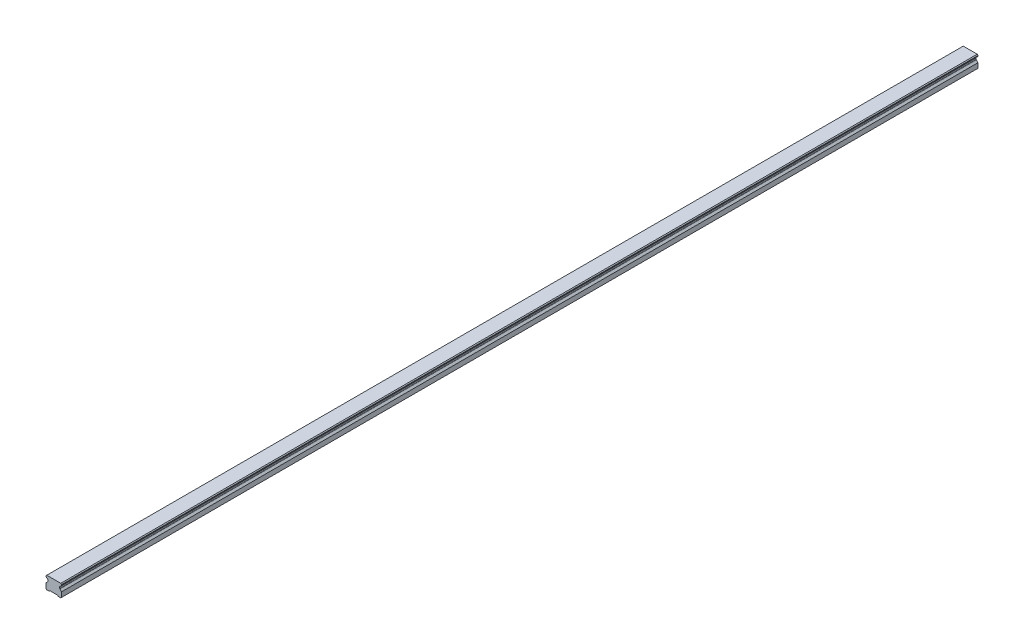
ISO-10303-21;
HEADER;
FILE_DESCRIPTION(('STEP AP214'),'2;1');
FILE_NAME('part.step','',(''),(''),'','','');
FILE_SCHEMA(('AUTOMOTIVE_DESIGN { 1 0 10303 214 1 1 1 1 }'));
ENDSEC;
DATA;
#1=APPLICATION_CONTEXT('core data for automotive mechanical design processes');
#2=APPLICATION_PROTOCOL_DEFINITION('international standard','automotive_design',2000,#1);
#3=PRODUCT_CONTEXT('',#1,'mechanical');
#4=PRODUCT('Part','Part','',(#3));
#5=PRODUCT_RELATED_PRODUCT_CATEGORY('part','',(#4));
#6=PRODUCT_DEFINITION_FORMATION('','',#4);
#7=PRODUCT_DEFINITION_CONTEXT('part definition',#1,'design');
#8=PRODUCT_DEFINITION('design','',#6,#7);
#9=PRODUCT_DEFINITION_SHAPE('','',#8);
#10=(LENGTH_UNIT() NAMED_UNIT(*) SI_UNIT(.MILLI.,.METRE.));
#11=(NAMED_UNIT(*) PLANE_ANGLE_UNIT() SI_UNIT($,.RADIAN.));
#12=(NAMED_UNIT(*) SI_UNIT($,.STERADIAN.) SOLID_ANGLE_UNIT());
#13=UNCERTAINTY_MEASURE_WITH_UNIT(LENGTH_MEASURE(1.E-05),#10,'distance_accuracy_value','');
#14=(GEOMETRIC_REPRESENTATION_CONTEXT(3) GLOBAL_UNCERTAINTY_ASSIGNED_CONTEXT((#13)) GLOBAL_UNIT_ASSIGNED_CONTEXT((#10,
#11,#12)) REPRESENTATION_CONTEXT('',''));
#15=CARTESIAN_POINT('',(0.,0.,0.));
#16=DIRECTION('',(0.,0.,1.));
#17=DIRECTION('',(1.,0.,0.));
#18=AXIS2_PLACEMENT_3D('',#15,#16,#17);
#19=CARTESIAN_POINT('',(0.,11.0000000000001,-570.));
#20=DIRECTION('',(0.,-1.,0.));
#21=DIRECTION('',(0.,0.,-1.));
#22=AXIS2_PLACEMENT_3D('',#19,#20,#21);
#23=PLANE('',#22);
#24=CARTESIAN_POINT('',(0.,11.0000000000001,-570.));
#25=DIRECTION('',(0.,-1.,0.));
#26=DIRECTION('',(0.,0.,-1.));
#27=AXIS2_PLACEMENT_3D('',#24,#25,#26);
#28=CIRCLE('',#27,2.5);
#29=CARTESIAN_POINT('',(0.,11.0000000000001,-572.5));
#30=VERTEX_POINT('',#29);
#31=EDGE_CURVE('E42',#30,#30,#28,.T.);
#32=ORIENTED_EDGE('',*,*,#31,.F.);
#33=EDGE_LOOP('',(#32));
#34=FACE_BOUND('',#33,.T.);
#35=CARTESIAN_POINT('',(0.,11.0000000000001,-570.));
#36=DIRECTION('',(0.,-1.,0.));
#37=DIRECTION('',(0.,0.,-1.));
#38=AXIS2_PLACEMENT_3D('',#35,#36,#37);
#39=CIRCLE('',#38,3.);
#40=CARTESIAN_POINT('',(0.,11.0000000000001,-573.));
#41=VERTEX_POINT('',#40);
#42=EDGE_CURVE('E11',#41,#41,#39,.T.);
#43=ORIENTED_EDGE('',*,*,#42,.T.);
#44=EDGE_LOOP('',(#43));
#45=FACE_BOUND('',#44,.T.);
#46=ADVANCED_FACE('F39',(#34,#45),#23,.T.);
#47=CARTESIAN_POINT('',(0.,11.0000000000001,-570.));
#48=DIRECTION('',(0.,-1.,0.));
#49=DIRECTION('',(0.,0.,-1.));
#50=AXIS2_PLACEMENT_3D('',#47,#48,#49);
#51=CYLINDRICAL_SURFACE('',#50,3.);
#52=ORIENTED_EDGE('',*,*,#42,.F.);
#53=EDGE_LOOP('',(#52));
#54=FACE_BOUND('',#53,.T.);
#55=CARTESIAN_POINT('',(0.,1.00000000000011,-570.));
#56=DIRECTION('',(0.,-1.,0.));
#57=DIRECTION('',(0.,0.,-1.));
#58=AXIS2_PLACEMENT_3D('',#55,#56,#57);
#59=CIRCLE('',#58,3.);
#60=CARTESIAN_POINT('',(0.,1.00000000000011,-573.));
#61=VERTEX_POINT('',#60);
#62=EDGE_CURVE('E48',#61,#61,#59,.T.);
#63=ORIENTED_EDGE('',*,*,#62,.T.);
#64=EDGE_LOOP('',(#63));
#65=FACE_BOUND('',#64,.T.);
#66=ADVANCED_FACE('F823',(#54,#65),#51,.F.);
#67=CARTESIAN_POINT('',(0.,11.0000000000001,-510.));
#68=DIRECTION('',(0.,-1.,0.));
#69=DIRECTION('',(0.,0.,-1.));
#70=AXIS2_PLACEMENT_3D('',#67,#68,#69);
#71=PLANE('',#70);
#72=CARTESIAN_POINT('',(0.,11.0000000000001,-510.));
#73=DIRECTION('',(0.,-1.,0.));
#74=DIRECTION('',(0.,0.,-1.));
#75=AXIS2_PLACEMENT_3D('',#72,#73,#74);
#76=CIRCLE('',#75,2.5);
#77=CARTESIAN_POINT('',(0.,11.0000000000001,-512.5));
#78=VERTEX_POINT('',#77);
#79=EDGE_CURVE('E809',#78,#78,#76,.T.);
#80=ORIENTED_EDGE('',*,*,#79,.F.);
#81=EDGE_LOOP('',(#80));
#82=FACE_BOUND('',#81,.T.);
#83=CARTESIAN_POINT('',(0.,11.0000000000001,-510.));
#84=DIRECTION('',(0.,-1.,0.));
#85=DIRECTION('',(0.,0.,-1.));
#86=AXIS2_PLACEMENT_3D('',#83,#84,#85);
#87=CIRCLE('',#86,3.);
#88=CARTESIAN_POINT('',(0.,11.0000000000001,-513.));
#89=VERTEX_POINT('',#88);
#90=EDGE_CURVE('E740',#89,#89,#87,.T.);
#91=ORIENTED_EDGE('',*,*,#90,.T.);
#92=EDGE_LOOP('',(#91));
#93=FACE_BOUND('',#92,.T.);
#94=ADVANCED_FACE('F828',(#82,#93),#71,.T.);
#95=CARTESIAN_POINT('',(0.,11.0000000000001,-510.));
#96=DIRECTION('',(0.,-1.,0.));
#97=DIRECTION('',(0.,0.,-1.));
#98=AXIS2_PLACEMENT_3D('',#95,#96,#97);
#99=CYLINDRICAL_SURFACE('',#98,3.);
#100=ORIENTED_EDGE('',*,*,#90,.F.);
#101=EDGE_LOOP('',(#100));
#102=FACE_BOUND('',#101,.T.);
#103=CARTESIAN_POINT('',(0.,1.00000000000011,-510.));
#104=DIRECTION('',(0.,-1.,0.));
#105=DIRECTION('',(0.,0.,-1.));
#106=AXIS2_PLACEMENT_3D('',#103,#104,#105);
#107=CIRCLE('',#106,3.);
#108=CARTESIAN_POINT('',(0.,1.00000000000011,-513.));
#109=VERTEX_POINT('',#108);
#110=EDGE_CURVE('E736',#109,#109,#107,.T.);
#111=ORIENTED_EDGE('',*,*,#110,.T.);
#112=EDGE_LOOP('',(#111));
#113=FACE_BOUND('',#112,.T.);
#114=ADVANCED_FACE('F1059',(#102,#113),#99,.F.);
#115=CARTESIAN_POINT('',(0.,11.0000000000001,-450.));
#116=DIRECTION('',(0.,-1.,0.));
#117=DIRECTION('',(0.,0.,-1.));
#118=AXIS2_PLACEMENT_3D('',#115,#116,#117);
#119=PLANE('',#118);
#120=CARTESIAN_POINT('',(0.,11.0000000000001,-450.));
#121=DIRECTION('',(0.,-1.,0.));
#122=DIRECTION('',(0.,0.,-1.));
#123=AXIS2_PLACEMENT_3D('',#120,#121,#122);
#124=CIRCLE('',#123,2.5);
#125=CARTESIAN_POINT('',(0.,11.0000000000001,-452.5));
#126=VERTEX_POINT('',#125);
#127=EDGE_CURVE('E806',#126,#126,#124,.T.);
#128=ORIENTED_EDGE('',*,*,#127,.F.);
#129=EDGE_LOOP('',(#128));
#130=FACE_BOUND('',#129,.T.);
#131=CARTESIAN_POINT('',(0.,11.0000000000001,-450.));
#132=DIRECTION('',(0.,-1.,0.));
#133=DIRECTION('',(0.,0.,-1.));
#134=AXIS2_PLACEMENT_3D('',#131,#132,#133);
#135=CIRCLE('',#134,3.);
#136=CARTESIAN_POINT('',(0.,11.0000000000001,-453.));
#137=VERTEX_POINT('',#136);
#138=EDGE_CURVE('E732',#137,#137,#135,.T.);
#139=ORIENTED_EDGE('',*,*,#138,.T.);
#140=EDGE_LOOP('',(#139));
#141=FACE_BOUND('',#140,.T.);
#142=ADVANCED_FACE('F1055',(#130,#141),#119,.T.);
#143=CARTESIAN_POINT('',(0.,11.0000000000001,-450.));
#144=DIRECTION('',(0.,-1.,0.));
#145=DIRECTION('',(0.,0.,-1.));
#146=AXIS2_PLACEMENT_3D('',#143,#144,#145);
#147=CYLINDRICAL_SURFACE('',#146,3.);
#148=ORIENTED_EDGE('',*,*,#138,.F.);
#149=EDGE_LOOP('',(#148));
#150=FACE_BOUND('',#149,.T.);
#151=CARTESIAN_POINT('',(0.,1.00000000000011,-450.));
#152=DIRECTION('',(0.,-1.,0.));
#153=DIRECTION('',(0.,0.,-1.));
#154=AXIS2_PLACEMENT_3D('',#151,#152,#153);
#155=CIRCLE('',#154,3.);
#156=CARTESIAN_POINT('',(0.,1.00000000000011,-453.));
#157=VERTEX_POINT('',#156);
#158=EDGE_CURVE('E728',#157,#157,#155,.T.);
#159=ORIENTED_EDGE('',*,*,#158,.T.);
#160=EDGE_LOOP('',(#159));
#161=FACE_BOUND('',#160,.T.);
#162=ADVANCED_FACE('F1051',(#150,#161),#147,.F.);
#163=CARTESIAN_POINT('',(0.,11.0000000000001,-390.));
#164=DIRECTION('',(0.,-1.,0.));
#165=DIRECTION('',(0.,0.,-1.));
#166=AXIS2_PLACEMENT_3D('',#163,#164,#165);
#167=PLANE('',#166);
#168=CARTESIAN_POINT('',(0.,11.0000000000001,-390.));
#169=DIRECTION('',(0.,-1.,0.));
#170=DIRECTION('',(0.,0.,-1.));
#171=AXIS2_PLACEMENT_3D('',#168,#169,#170);
#172=CIRCLE('',#171,2.5);
#173=CARTESIAN_POINT('',(0.,11.0000000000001,-392.5));
#174=VERTEX_POINT('',#173);
#175=EDGE_CURVE('E802',#174,#174,#172,.T.);
#176=ORIENTED_EDGE('',*,*,#175,.F.);
#177=EDGE_LOOP('',(#176));
#178=FACE_BOUND('',#177,.T.);
#179=CARTESIAN_POINT('',(0.,11.0000000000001,-390.));
#180=DIRECTION('',(0.,-1.,0.));
#181=DIRECTION('',(0.,0.,-1.));
#182=AXIS2_PLACEMENT_3D('',#179,#180,#181);
#183=CIRCLE('',#182,3.);
#184=CARTESIAN_POINT('',(0.,11.0000000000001,-393.));
#185=VERTEX_POINT('',#184);
#186=EDGE_CURVE('E724',#185,#185,#183,.T.);
#187=ORIENTED_EDGE('',*,*,#186,.T.);
#188=EDGE_LOOP('',(#187));
#189=FACE_BOUND('',#188,.T.);
#190=ADVANCED_FACE('F1047',(#178,#189),#167,.T.);
#191=CARTESIAN_POINT('',(0.,11.0000000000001,-390.));
#192=DIRECTION('',(0.,-1.,0.));
#193=DIRECTION('',(0.,0.,-1.));
#194=AXIS2_PLACEMENT_3D('',#191,#192,#193);
#195=CYLINDRICAL_SURFACE('',#194,3.);
#196=ORIENTED_EDGE('',*,*,#186,.F.);
#197=EDGE_LOOP('',(#196));
#198=FACE_BOUND('',#197,.T.);
#199=CARTESIAN_POINT('',(0.,1.00000000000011,-390.));
#200=DIRECTION('',(0.,-1.,0.));
#201=DIRECTION('',(0.,0.,-1.));
#202=AXIS2_PLACEMENT_3D('',#199,#200,#201);
#203=CIRCLE('',#202,3.);
#204=CARTESIAN_POINT('',(0.,1.00000000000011,-393.));
#205=VERTEX_POINT('',#204);
#206=EDGE_CURVE('E720',#205,#205,#203,.T.);
#207=ORIENTED_EDGE('',*,*,#206,.T.);
#208=EDGE_LOOP('',(#207));
#209=FACE_BOUND('',#208,.T.);
#210=ADVANCED_FACE('F1043',(#198,#209),#195,.F.);
#211=CARTESIAN_POINT('',(0.,11.0000000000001,-330.));
#212=DIRECTION('',(0.,-1.,0.));
#213=DIRECTION('',(0.,0.,-1.));
#214=AXIS2_PLACEMENT_3D('',#211,#212,#213);
#215=PLANE('',#214);
#216=CARTESIAN_POINT('',(0.,11.0000000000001,-330.));
#217=DIRECTION('',(0.,-1.,0.));
#218=DIRECTION('',(0.,0.,-1.));
#219=AXIS2_PLACEMENT_3D('',#216,#217,#218);
#220=CIRCLE('',#219,2.5);
#221=CARTESIAN_POINT('',(0.,11.0000000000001,-332.5));
#222=VERTEX_POINT('',#221);
#223=EDGE_CURVE('E798',#222,#222,#220,.T.);
#224=ORIENTED_EDGE('',*,*,#223,.F.);
#225=EDGE_LOOP('',(#224));
#226=FACE_BOUND('',#225,.T.);
#227=CARTESIAN_POINT('',(0.,11.0000000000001,-330.));
#228=DIRECTION('',(0.,-1.,0.));
#229=DIRECTION('',(0.,0.,-1.));
#230=AXIS2_PLACEMENT_3D('',#227,#228,#229);
#231=CIRCLE('',#230,3.);
#232=CARTESIAN_POINT('',(0.,11.0000000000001,-333.));
#233=VERTEX_POINT('',#232);
#234=EDGE_CURVE('E716',#233,#233,#231,.T.);
#235=ORIENTED_EDGE('',*,*,#234,.T.);
#236=EDGE_LOOP('',(#235));
#237=FACE_BOUND('',#236,.T.);
#238=ADVANCED_FACE('F1039',(#226,#237),#215,.T.);
#239=CARTESIAN_POINT('',(0.,11.0000000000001,-330.));
#240=DIRECTION('',(0.,-1.,0.));
#241=DIRECTION('',(0.,0.,-1.));
#242=AXIS2_PLACEMENT_3D('',#239,#240,#241);
#243=CYLINDRICAL_SURFACE('',#242,3.);
#244=ORIENTED_EDGE('',*,*,#234,.F.);
#245=EDGE_LOOP('',(#244));
#246=FACE_BOUND('',#245,.T.);
#247=CARTESIAN_POINT('',(0.,1.00000000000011,-330.));
#248=DIRECTION('',(0.,-1.,0.));
#249=DIRECTION('',(0.,0.,-1.));
#250=AXIS2_PLACEMENT_3D('',#247,#248,#249);
#251=CIRCLE('',#250,3.);
#252=CARTESIAN_POINT('',(0.,1.00000000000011,-333.));
#253=VERTEX_POINT('',#252);
#254=EDGE_CURVE('E712',#253,#253,#251,.T.);
#255=ORIENTED_EDGE('',*,*,#254,.T.);
#256=EDGE_LOOP('',(#255));
#257=FACE_BOUND('',#256,.T.);
#258=ADVANCED_FACE('F1035',(#246,#257),#243,.F.);
#259=CARTESIAN_POINT('',(0.,11.0000000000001,-270.));
#260=DIRECTION('',(0.,-1.,0.));
#261=DIRECTION('',(0.,0.,-1.));
#262=AXIS2_PLACEMENT_3D('',#259,#260,#261);
#263=PLANE('',#262);
#264=CARTESIAN_POINT('',(0.,11.0000000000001,-270.));
#265=DIRECTION('',(0.,-1.,0.));
#266=DIRECTION('',(0.,0.,-1.));
#267=AXIS2_PLACEMENT_3D('',#264,#265,#266);
#268=CIRCLE('',#267,2.5);
#269=CARTESIAN_POINT('',(0.,11.0000000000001,-272.5));
#270=VERTEX_POINT('',#269);
#271=EDGE_CURVE('E794',#270,#270,#268,.T.);
#272=ORIENTED_EDGE('',*,*,#271,.F.);
#273=EDGE_LOOP('',(#272));
#274=FACE_BOUND('',#273,.T.);
#275=CARTESIAN_POINT('',(0.,11.0000000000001,-270.));
#276=DIRECTION('',(0.,-1.,0.));
#277=DIRECTION('',(0.,0.,-1.));
#278=AXIS2_PLACEMENT_3D('',#275,#276,#277);
#279=CIRCLE('',#278,3.);
#280=CARTESIAN_POINT('',(0.,11.0000000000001,-273.));
#281=VERTEX_POINT('',#280);
#282=EDGE_CURVE('E708',#281,#281,#279,.T.);
#283=ORIENTED_EDGE('',*,*,#282,.T.);
#284=EDGE_LOOP('',(#283));
#285=FACE_BOUND('',#284,.T.);
#286=ADVANCED_FACE('F1031',(#274,#285),#263,.T.);
#287=CARTESIAN_POINT('',(0.,11.0000000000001,-270.));
#288=DIRECTION('',(0.,-1.,0.));
#289=DIRECTION('',(0.,0.,-1.));
#290=AXIS2_PLACEMENT_3D('',#287,#288,#289);
#291=CYLINDRICAL_SURFACE('',#290,3.);
#292=ORIENTED_EDGE('',*,*,#282,.F.);
#293=EDGE_LOOP('',(#292));
#294=FACE_BOUND('',#293,.T.);
#295=CARTESIAN_POINT('',(0.,1.00000000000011,-270.));
#296=DIRECTION('',(0.,-1.,0.));
#297=DIRECTION('',(0.,0.,-1.));
#298=AXIS2_PLACEMENT_3D('',#295,#296,#297);
#299=CIRCLE('',#298,3.);
#300=CARTESIAN_POINT('',(0.,1.00000000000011,-273.));
#301=VERTEX_POINT('',#300);
#302=EDGE_CURVE('E704',#301,#301,#299,.T.);
#303=ORIENTED_EDGE('',*,*,#302,.T.);
#304=EDGE_LOOP('',(#303));
#305=FACE_BOUND('',#304,.T.);
#306=ADVANCED_FACE('F1027',(#294,#305),#291,.F.);
#307=CARTESIAN_POINT('',(0.,11.0000000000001,-210.));
#308=DIRECTION('',(0.,-1.,0.));
#309=DIRECTION('',(0.,0.,-1.));
#310=AXIS2_PLACEMENT_3D('',#307,#308,#309);
#311=PLANE('',#310);
#312=CARTESIAN_POINT('',(0.,11.0000000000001,-210.));
#313=DIRECTION('',(0.,-1.,0.));
#314=DIRECTION('',(0.,0.,-1.));
#315=AXIS2_PLACEMENT_3D('',#312,#313,#314);
#316=CIRCLE('',#315,2.5);
#317=CARTESIAN_POINT('',(0.,11.0000000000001,-212.5));
#318=VERTEX_POINT('',#317);
#319=EDGE_CURVE('E790',#318,#318,#316,.T.);
#320=ORIENTED_EDGE('',*,*,#319,.F.);
#321=EDGE_LOOP('',(#320));
#322=FACE_BOUND('',#321,.T.);
#323=CARTESIAN_POINT('',(0.,11.0000000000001,-210.));
#324=DIRECTION('',(0.,-1.,0.));
#325=DIRECTION('',(0.,0.,-1.));
#326=AXIS2_PLACEMENT_3D('',#323,#324,#325);
#327=CIRCLE('',#326,3.);
#328=CARTESIAN_POINT('',(0.,11.0000000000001,-213.));
#329=VERTEX_POINT('',#328);
#330=EDGE_CURVE('E700',#329,#329,#327,.T.);
#331=ORIENTED_EDGE('',*,*,#330,.T.);
#332=EDGE_LOOP('',(#331));
#333=FACE_BOUND('',#332,.T.);
#334=ADVANCED_FACE('F1023',(#322,#333),#311,.T.);
#335=CARTESIAN_POINT('',(0.,11.0000000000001,-210.));
#336=DIRECTION('',(0.,-1.,0.));
#337=DIRECTION('',(0.,0.,-1.));
#338=AXIS2_PLACEMENT_3D('',#335,#336,#337);
#339=CYLINDRICAL_SURFACE('',#338,3.);
#340=ORIENTED_EDGE('',*,*,#330,.F.);
#341=EDGE_LOOP('',(#340));
#342=FACE_BOUND('',#341,.T.);
#343=CARTESIAN_POINT('',(0.,1.00000000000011,-210.));
#344=DIRECTION('',(0.,-1.,0.));
#345=DIRECTION('',(0.,0.,-1.));
#346=AXIS2_PLACEMENT_3D('',#343,#344,#345);
#347=CIRCLE('',#346,3.);
#348=CARTESIAN_POINT('',(0.,1.00000000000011,-213.));
#349=VERTEX_POINT('',#348);
#350=EDGE_CURVE('E696',#349,#349,#347,.T.);
#351=ORIENTED_EDGE('',*,*,#350,.T.);
#352=EDGE_LOOP('',(#351));
#353=FACE_BOUND('',#352,.T.);
#354=ADVANCED_FACE('F1019',(#342,#353),#339,.F.);
#355=CARTESIAN_POINT('',(0.,11.0000000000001,-150.));
#356=DIRECTION('',(0.,-1.,0.));
#357=DIRECTION('',(0.,0.,-1.));
#358=AXIS2_PLACEMENT_3D('',#355,#356,#357);
#359=PLANE('',#358);
#360=CARTESIAN_POINT('',(0.,11.0000000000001,-150.));
#361=DIRECTION('',(0.,-1.,0.));
#362=DIRECTION('',(0.,0.,-1.));
#363=AXIS2_PLACEMENT_3D('',#360,#361,#362);
#364=CIRCLE('',#363,2.5);
#365=CARTESIAN_POINT('',(0.,11.0000000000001,-152.5));
#366=VERTEX_POINT('',#365);
#367=EDGE_CURVE('E786',#366,#366,#364,.T.);
#368=ORIENTED_EDGE('',*,*,#367,.F.);
#369=EDGE_LOOP('',(#368));
#370=FACE_BOUND('',#369,.T.);
#371=CARTESIAN_POINT('',(0.,11.0000000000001,-150.));
#372=DIRECTION('',(0.,-1.,0.));
#373=DIRECTION('',(0.,0.,-1.));
#374=AXIS2_PLACEMENT_3D('',#371,#372,#373);
#375=CIRCLE('',#374,3.);
#376=CARTESIAN_POINT('',(0.,11.0000000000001,-153.));
#377=VERTEX_POINT('',#376);
#378=EDGE_CURVE('E692',#377,#377,#375,.T.);
#379=ORIENTED_EDGE('',*,*,#378,.T.);
#380=EDGE_LOOP('',(#379));
#381=FACE_BOUND('',#380,.T.);
#382=ADVANCED_FACE('F1015',(#370,#381),#359,.T.);
#383=CARTESIAN_POINT('',(0.,11.0000000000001,-150.));
#384=DIRECTION('',(0.,-1.,0.));
#385=DIRECTION('',(0.,0.,-1.));
#386=AXIS2_PLACEMENT_3D('',#383,#384,#385);
#387=CYLINDRICAL_SURFACE('',#386,3.);
#388=ORIENTED_EDGE('',*,*,#378,.F.);
#389=EDGE_LOOP('',(#388));
#390=FACE_BOUND('',#389,.T.);
#391=CARTESIAN_POINT('',(0.,1.00000000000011,-150.));
#392=DIRECTION('',(0.,-1.,0.));
#393=DIRECTION('',(0.,0.,-1.));
#394=AXIS2_PLACEMENT_3D('',#391,#392,#393);
#395=CIRCLE('',#394,3.);
#396=CARTESIAN_POINT('',(0.,1.00000000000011,-153.));
#397=VERTEX_POINT('',#396);
#398=EDGE_CURVE('E688',#397,#397,#395,.T.);
#399=ORIENTED_EDGE('',*,*,#398,.T.);
#400=EDGE_LOOP('',(#399));
#401=FACE_BOUND('',#400,.T.);
#402=ADVANCED_FACE('F1011',(#390,#401),#387,.F.);
#403=CARTESIAN_POINT('',(0.,11.0000000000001,-89.9999999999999));
#404=DIRECTION('',(0.,-1.,0.));
#405=DIRECTION('',(0.,0.,-1.));
#406=AXIS2_PLACEMENT_3D('',#403,#404,#405);
#407=PLANE('',#406);
#408=CARTESIAN_POINT('',(0.,11.0000000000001,-90.));
#409=DIRECTION('',(0.,-1.,0.));
#410=DIRECTION('',(0.,0.,-1.));
#411=AXIS2_PLACEMENT_3D('',#408,#409,#410);
#412=CIRCLE('',#411,2.5);
#413=CARTESIAN_POINT('',(0.,11.0000000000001,-92.5));
#414=VERTEX_POINT('',#413);
#415=EDGE_CURVE('E782',#414,#414,#412,.T.);
#416=ORIENTED_EDGE('',*,*,#415,.F.);
#417=EDGE_LOOP('',(#416));
#418=FACE_BOUND('',#417,.T.);
#419=CARTESIAN_POINT('',(0.,11.0000000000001,-89.9999999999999));
#420=DIRECTION('',(0.,-1.,0.));
#421=DIRECTION('',(0.,0.,-1.));
#422=AXIS2_PLACEMENT_3D('',#419,#420,#421);
#423=CIRCLE('',#422,3.);
#424=CARTESIAN_POINT('',(0.,11.0000000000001,-92.9999999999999));
#425=VERTEX_POINT('',#424);
#426=EDGE_CURVE('E684',#425,#425,#423,.T.);
#427=ORIENTED_EDGE('',*,*,#426,.T.);
#428=EDGE_LOOP('',(#427));
#429=FACE_BOUND('',#428,.T.);
#430=ADVANCED_FACE('F1007',(#418,#429),#407,.T.);
#431=CARTESIAN_POINT('',(0.,11.0000000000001,-89.9999999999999));
#432=DIRECTION('',(0.,-1.,0.));
#433=DIRECTION('',(0.,0.,-1.));
#434=AXIS2_PLACEMENT_3D('',#431,#432,#433);
#435=CYLINDRICAL_SURFACE('',#434,3.);
#436=ORIENTED_EDGE('',*,*,#426,.F.);
#437=EDGE_LOOP('',(#436));
#438=FACE_BOUND('',#437,.T.);
#439=CARTESIAN_POINT('',(0.,1.00000000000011,-89.9999999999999));
#440=DIRECTION('',(0.,-1.,0.));
#441=DIRECTION('',(0.,0.,-1.));
#442=AXIS2_PLACEMENT_3D('',#439,#440,#441);
#443=CIRCLE('',#442,3.);
#444=CARTESIAN_POINT('',(0.,1.00000000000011,-92.9999999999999));
#445=VERTEX_POINT('',#444);
#446=EDGE_CURVE('E680',#445,#445,#443,.T.);
#447=ORIENTED_EDGE('',*,*,#446,.T.);
#448=EDGE_LOOP('',(#447));
#449=FACE_BOUND('',#448,.T.);
#450=ADVANCED_FACE('F1003',(#438,#449),#435,.F.);
#451=CARTESIAN_POINT('',(0.,11.0000000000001,-30.));
#452=DIRECTION('',(0.,-1.,0.));
#453=DIRECTION('',(0.,0.,-1.));
#454=AXIS2_PLACEMENT_3D('',#451,#452,#453);
#455=PLANE('',#454);
#456=CARTESIAN_POINT('',(0.,11.0000000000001,-30.));
#457=DIRECTION('',(0.,-1.,0.));
#458=DIRECTION('',(0.,0.,-1.));
#459=AXIS2_PLACEMENT_3D('',#456,#457,#458);
#460=CIRCLE('',#459,2.5);
#461=CARTESIAN_POINT('',(0.,11.0000000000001,-32.5));
#462=VERTEX_POINT('',#461);
#463=EDGE_CURVE('E778',#462,#462,#460,.T.);
#464=ORIENTED_EDGE('',*,*,#463,.F.);
#465=EDGE_LOOP('',(#464));
#466=FACE_BOUND('',#465,.T.);
#467=CARTESIAN_POINT('',(0.,11.0000000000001,-30.));
#468=DIRECTION('',(0.,-1.,0.));
#469=DIRECTION('',(0.,0.,-1.));
#470=AXIS2_PLACEMENT_3D('',#467,#468,#469);
#471=CIRCLE('',#470,3.);
#472=CARTESIAN_POINT('',(0.,11.0000000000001,-33.));
#473=VERTEX_POINT('',#472);
#474=EDGE_CURVE('E676',#473,#473,#471,.T.);
#475=ORIENTED_EDGE('',*,*,#474,.T.);
#476=EDGE_LOOP('',(#475));
#477=FACE_BOUND('',#476,.T.);
#478=ADVANCED_FACE('F999',(#466,#477),#455,.T.);
#479=CARTESIAN_POINT('',(0.,11.0000000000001,-30.));
#480=DIRECTION('',(0.,-1.,0.));
#481=DIRECTION('',(0.,0.,-1.));
#482=AXIS2_PLACEMENT_3D('',#479,#480,#481);
#483=CYLINDRICAL_SURFACE('',#482,3.);
#484=ORIENTED_EDGE('',*,*,#474,.F.);
#485=EDGE_LOOP('',(#484));
#486=FACE_BOUND('',#485,.T.);
#487=CARTESIAN_POINT('',(0.,1.00000000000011,-30.));
#488=DIRECTION('',(0.,-1.,0.));
#489=DIRECTION('',(0.,0.,-1.));
#490=AXIS2_PLACEMENT_3D('',#487,#488,#489);
#491=CIRCLE('',#490,3.);
#492=CARTESIAN_POINT('',(0.,1.00000000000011,-33.));
#493=VERTEX_POINT('',#492);
#494=EDGE_CURVE('E672',#493,#493,#491,.T.);
#495=ORIENTED_EDGE('',*,*,#494,.T.);
#496=EDGE_LOOP('',(#495));
#497=FACE_BOUND('',#496,.T.);
#498=ADVANCED_FACE('F995',(#486,#497),#483,.F.);
#499=CARTESIAN_POINT('',(0.,11.0000000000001,30.));
#500=DIRECTION('',(0.,-1.,0.));
#501=DIRECTION('',(0.,0.,-1.));
#502=AXIS2_PLACEMENT_3D('',#499,#500,#501);
#503=PLANE('',#502);
#504=CARTESIAN_POINT('',(0.,11.0000000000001,29.9999999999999));
#505=DIRECTION('',(0.,-1.,0.));
#506=DIRECTION('',(0.,0.,-1.));
#507=AXIS2_PLACEMENT_3D('',#504,#505,#506);
#508=CIRCLE('',#507,2.5);
#509=CARTESIAN_POINT('',(0.,11.0000000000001,27.4999999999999));
#510=VERTEX_POINT('',#509);
#511=EDGE_CURVE('E774',#510,#510,#508,.T.);
#512=ORIENTED_EDGE('',*,*,#511,.F.);
#513=EDGE_LOOP('',(#512));
#514=FACE_BOUND('',#513,.T.);
#515=CARTESIAN_POINT('',(0.,11.0000000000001,30.));
#516=DIRECTION('',(0.,-1.,0.));
#517=DIRECTION('',(0.,0.,-1.));
#518=AXIS2_PLACEMENT_3D('',#515,#516,#517);
#519=CIRCLE('',#518,3.);
#520=CARTESIAN_POINT('',(0.,11.0000000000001,27.));
#521=VERTEX_POINT('',#520);
#522=EDGE_CURVE('E668',#521,#521,#519,.T.);
#523=ORIENTED_EDGE('',*,*,#522,.T.);
#524=EDGE_LOOP('',(#523));
#525=FACE_BOUND('',#524,.T.);
#526=ADVANCED_FACE('F991',(#514,#525),#503,.T.);
#527=CARTESIAN_POINT('',(0.,11.0000000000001,30.));
#528=DIRECTION('',(0.,-1.,0.));
#529=DIRECTION('',(0.,0.,-1.));
#530=AXIS2_PLACEMENT_3D('',#527,#528,#529);
#531=CYLINDRICAL_SURFACE('',#530,3.);
#532=ORIENTED_EDGE('',*,*,#522,.F.);
#533=EDGE_LOOP('',(#532));
#534=FACE_BOUND('',#533,.T.);
#535=CARTESIAN_POINT('',(0.,1.00000000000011,30.));
#536=DIRECTION('',(0.,-1.,0.));
#537=DIRECTION('',(0.,0.,-1.));
#538=AXIS2_PLACEMENT_3D('',#535,#536,#537);
#539=CIRCLE('',#538,3.);
#540=CARTESIAN_POINT('',(0.,1.00000000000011,27.));
#541=VERTEX_POINT('',#540);
#542=EDGE_CURVE('E664',#541,#541,#539,.T.);
#543=ORIENTED_EDGE('',*,*,#542,.T.);
#544=EDGE_LOOP('',(#543));
#545=FACE_BOUND('',#544,.T.);
#546=ADVANCED_FACE('F987',(#534,#545),#531,.F.);
#547=CARTESIAN_POINT('',(0.,11.0000000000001,90.));
#548=DIRECTION('',(0.,-1.,0.));
#549=DIRECTION('',(0.,0.,-1.));
#550=AXIS2_PLACEMENT_3D('',#547,#548,#549);
#551=PLANE('',#550);
#552=CARTESIAN_POINT('',(0.,11.0000000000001,90.));
#553=DIRECTION('',(0.,-1.,0.));
#554=DIRECTION('',(0.,0.,-1.));
#555=AXIS2_PLACEMENT_3D('',#552,#553,#554);
#556=CIRCLE('',#555,2.5);
#557=CARTESIAN_POINT('',(0.,11.0000000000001,87.5));
#558=VERTEX_POINT('',#557);
#559=EDGE_CURVE('E770',#558,#558,#556,.T.);
#560=ORIENTED_EDGE('',*,*,#559,.F.);
#561=EDGE_LOOP('',(#560));
#562=FACE_BOUND('',#561,.T.);
#563=CARTESIAN_POINT('',(0.,11.0000000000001,90.));
#564=DIRECTION('',(0.,-1.,0.));
#565=DIRECTION('',(0.,0.,-1.));
#566=AXIS2_PLACEMENT_3D('',#563,#564,#565);
#567=CIRCLE('',#566,3.);
#568=CARTESIAN_POINT('',(0.,11.0000000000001,87.));
#569=VERTEX_POINT('',#568);
#570=EDGE_CURVE('E660',#569,#569,#567,.T.);
#571=ORIENTED_EDGE('',*,*,#570,.T.);
#572=EDGE_LOOP('',(#571));
#573=FACE_BOUND('',#572,.T.);
#574=ADVANCED_FACE('F983',(#562,#573),#551,.T.);
#575=CARTESIAN_POINT('',(0.,11.0000000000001,90.));
#576=DIRECTION('',(0.,-1.,0.));
#577=DIRECTION('',(0.,0.,-1.));
#578=AXIS2_PLACEMENT_3D('',#575,#576,#577);
#579=CYLINDRICAL_SURFACE('',#578,3.);
#580=ORIENTED_EDGE('',*,*,#570,.F.);
#581=EDGE_LOOP('',(#580));
#582=FACE_BOUND('',#581,.T.);
#583=CARTESIAN_POINT('',(0.,1.00000000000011,90.));
#584=DIRECTION('',(0.,-1.,0.));
#585=DIRECTION('',(0.,0.,-1.));
#586=AXIS2_PLACEMENT_3D('',#583,#584,#585);
#587=CIRCLE('',#586,3.);
#588=CARTESIAN_POINT('',(0.,1.00000000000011,87.));
#589=VERTEX_POINT('',#588);
#590=EDGE_CURVE('E656',#589,#589,#587,.T.);
#591=ORIENTED_EDGE('',*,*,#590,.T.);
#592=EDGE_LOOP('',(#591));
#593=FACE_BOUND('',#592,.T.);
#594=ADVANCED_FACE('F979',(#582,#593),#579,.F.);
#595=CARTESIAN_POINT('',(0.,11.0000000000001,150.));
#596=DIRECTION('',(0.,-1.,0.));
#597=DIRECTION('',(0.,0.,-1.));
#598=AXIS2_PLACEMENT_3D('',#595,#596,#597);
#599=PLANE('',#598);
#600=CARTESIAN_POINT('',(0.,11.0000000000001,150.));
#601=DIRECTION('',(0.,-1.,0.));
#602=DIRECTION('',(0.,0.,-1.));
#603=AXIS2_PLACEMENT_3D('',#600,#601,#602);
#604=CIRCLE('',#603,2.5);
#605=CARTESIAN_POINT('',(0.,11.0000000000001,147.5));
#606=VERTEX_POINT('',#605);
#607=EDGE_CURVE('E766',#606,#606,#604,.T.);
#608=ORIENTED_EDGE('',*,*,#607,.F.);
#609=EDGE_LOOP('',(#608));
#610=FACE_BOUND('',#609,.T.);
#611=CARTESIAN_POINT('',(0.,11.0000000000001,150.));
#612=DIRECTION('',(0.,-1.,0.));
#613=DIRECTION('',(0.,0.,-1.));
#614=AXIS2_PLACEMENT_3D('',#611,#612,#613);
#615=CIRCLE('',#614,3.);
#616=CARTESIAN_POINT('',(0.,11.0000000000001,147.));
#617=VERTEX_POINT('',#616);
#618=EDGE_CURVE('E652',#617,#617,#615,.T.);
#619=ORIENTED_EDGE('',*,*,#618,.T.);
#620=EDGE_LOOP('',(#619));
#621=FACE_BOUND('',#620,.T.);
#622=ADVANCED_FACE('F975',(#610,#621),#599,.T.);
#623=CARTESIAN_POINT('',(0.,11.0000000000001,150.));
#624=DIRECTION('',(0.,-1.,0.));
#625=DIRECTION('',(0.,0.,-1.));
#626=AXIS2_PLACEMENT_3D('',#623,#624,#625);
#627=CYLINDRICAL_SURFACE('',#626,3.);
#628=ORIENTED_EDGE('',*,*,#618,.F.);
#629=EDGE_LOOP('',(#628));
#630=FACE_BOUND('',#629,.T.);
#631=CARTESIAN_POINT('',(0.,1.00000000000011,150.));
#632=DIRECTION('',(0.,-1.,0.));
#633=DIRECTION('',(0.,0.,-1.));
#634=AXIS2_PLACEMENT_3D('',#631,#632,#633);
#635=CIRCLE('',#634,3.);
#636=CARTESIAN_POINT('',(0.,1.00000000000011,147.));
#637=VERTEX_POINT('',#636);
#638=EDGE_CURVE('E648',#637,#637,#635,.T.);
#639=ORIENTED_EDGE('',*,*,#638,.T.);
#640=EDGE_LOOP('',(#639));
#641=FACE_BOUND('',#640,.T.);
#642=ADVANCED_FACE('F971',(#630,#641),#627,.F.);
#643=CARTESIAN_POINT('',(0.,11.0000000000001,210.));
#644=DIRECTION('',(0.,-1.,0.));
#645=DIRECTION('',(0.,0.,-1.));
#646=AXIS2_PLACEMENT_3D('',#643,#644,#645);
#647=PLANE('',#646);
#648=CARTESIAN_POINT('',(0.,11.0000000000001,210.));
#649=DIRECTION('',(0.,-1.,0.));
#650=DIRECTION('',(0.,0.,-1.));
#651=AXIS2_PLACEMENT_3D('',#648,#649,#650);
#652=CIRCLE('',#651,2.5);
#653=CARTESIAN_POINT('',(0.,11.0000000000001,207.5));
#654=VERTEX_POINT('',#653);
#655=EDGE_CURVE('E762',#654,#654,#652,.T.);
#656=ORIENTED_EDGE('',*,*,#655,.F.);
#657=EDGE_LOOP('',(#656));
#658=FACE_BOUND('',#657,.T.);
#659=CARTESIAN_POINT('',(0.,11.0000000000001,210.));
#660=DIRECTION('',(0.,-1.,0.));
#661=DIRECTION('',(0.,0.,-1.));
#662=AXIS2_PLACEMENT_3D('',#659,#660,#661);
#663=CIRCLE('',#662,3.);
#664=CARTESIAN_POINT('',(0.,11.0000000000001,207.));
#665=VERTEX_POINT('',#664);
#666=EDGE_CURVE('E644',#665,#665,#663,.T.);
#667=ORIENTED_EDGE('',*,*,#666,.T.);
#668=EDGE_LOOP('',(#667));
#669=FACE_BOUND('',#668,.T.);
#670=ADVANCED_FACE('F967',(#658,#669),#647,.T.);
#671=CARTESIAN_POINT('',(0.,11.0000000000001,210.));
#672=DIRECTION('',(0.,-1.,0.));
#673=DIRECTION('',(0.,0.,-1.));
#674=AXIS2_PLACEMENT_3D('',#671,#672,#673);
#675=CYLINDRICAL_SURFACE('',#674,3.);
#676=ORIENTED_EDGE('',*,*,#666,.F.);
#677=EDGE_LOOP('',(#676));
#678=FACE_BOUND('',#677,.T.);
#679=CARTESIAN_POINT('',(0.,1.00000000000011,210.));
#680=DIRECTION('',(0.,-1.,0.));
#681=DIRECTION('',(0.,0.,-1.));
#682=AXIS2_PLACEMENT_3D('',#679,#680,#681);
#683=CIRCLE('',#682,3.);
#684=CARTESIAN_POINT('',(0.,1.00000000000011,207.));
#685=VERTEX_POINT('',#684);
#686=EDGE_CURVE('E640',#685,#685,#683,.T.);
#687=ORIENTED_EDGE('',*,*,#686,.T.);
#688=EDGE_LOOP('',(#687));
#689=FACE_BOUND('',#688,.T.);
#690=ADVANCED_FACE('F963',(#678,#689),#675,.F.);
#691=CARTESIAN_POINT('',(0.,11.0000000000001,270.));
#692=DIRECTION('',(0.,-1.,0.));
#693=DIRECTION('',(0.,0.,-1.));
#694=AXIS2_PLACEMENT_3D('',#691,#692,#693);
#695=PLANE('',#694);
#696=CARTESIAN_POINT('',(0.,11.0000000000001,270.));
#697=DIRECTION('',(0.,-1.,0.));
#698=DIRECTION('',(0.,0.,-1.));
#699=AXIS2_PLACEMENT_3D('',#696,#697,#698);
#700=CIRCLE('',#699,2.5);
#701=CARTESIAN_POINT('',(0.,11.0000000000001,267.5));
#702=VERTEX_POINT('',#701);
#703=EDGE_CURVE('E758',#702,#702,#700,.T.);
#704=ORIENTED_EDGE('',*,*,#703,.F.);
#705=EDGE_LOOP('',(#704));
#706=FACE_BOUND('',#705,.T.);
#707=CARTESIAN_POINT('',(0.,11.0000000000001,270.));
#708=DIRECTION('',(0.,-1.,0.));
#709=DIRECTION('',(0.,0.,-1.));
#710=AXIS2_PLACEMENT_3D('',#707,#708,#709);
#711=CIRCLE('',#710,3.);
#712=CARTESIAN_POINT('',(0.,11.0000000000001,267.));
#713=VERTEX_POINT('',#712);
#714=EDGE_CURVE('E636',#713,#713,#711,.T.);
#715=ORIENTED_EDGE('',*,*,#714,.T.);
#716=EDGE_LOOP('',(#715));
#717=FACE_BOUND('',#716,.T.);
#718=ADVANCED_FACE('F959',(#706,#717),#695,.T.);
#719=CARTESIAN_POINT('',(0.,11.0000000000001,270.));
#720=DIRECTION('',(0.,-1.,0.));
#721=DIRECTION('',(0.,0.,-1.));
#722=AXIS2_PLACEMENT_3D('',#719,#720,#721);
#723=CYLINDRICAL_SURFACE('',#722,3.);
#724=ORIENTED_EDGE('',*,*,#714,.F.);
#725=EDGE_LOOP('',(#724));
#726=FACE_BOUND('',#725,.T.);
#727=CARTESIAN_POINT('',(0.,1.00000000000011,270.));
#728=DIRECTION('',(0.,-1.,0.));
#729=DIRECTION('',(0.,0.,-1.));
#730=AXIS2_PLACEMENT_3D('',#727,#728,#729);
#731=CIRCLE('',#730,3.);
#732=CARTESIAN_POINT('',(0.,1.00000000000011,267.));
#733=VERTEX_POINT('',#732);
#734=EDGE_CURVE('E632',#733,#733,#731,.T.);
#735=ORIENTED_EDGE('',*,*,#734,.T.);
#736=EDGE_LOOP('',(#735));
#737=FACE_BOUND('',#736,.T.);
#738=ADVANCED_FACE('F955',(#726,#737),#723,.F.);
#739=CARTESIAN_POINT('',(0.,11.0000000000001,330.));
#740=DIRECTION('',(0.,-1.,0.));
#741=DIRECTION('',(0.,0.,-1.));
#742=AXIS2_PLACEMENT_3D('',#739,#740,#741);
#743=PLANE('',#742);
#744=CARTESIAN_POINT('',(0.,11.0000000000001,330.));
#745=DIRECTION('',(0.,-1.,0.));
#746=DIRECTION('',(0.,0.,-1.));
#747=AXIS2_PLACEMENT_3D('',#744,#745,#746);
#748=CIRCLE('',#747,2.5);
#749=CARTESIAN_POINT('',(0.,11.0000000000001,327.5));
#750=VERTEX_POINT('',#749);
#751=EDGE_CURVE('E754',#750,#750,#748,.T.);
#752=ORIENTED_EDGE('',*,*,#751,.F.);
#753=EDGE_LOOP('',(#752));
#754=FACE_BOUND('',#753,.T.);
#755=CARTESIAN_POINT('',(0.,11.0000000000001,330.));
#756=DIRECTION('',(0.,-1.,0.));
#757=DIRECTION('',(0.,0.,-1.));
#758=AXIS2_PLACEMENT_3D('',#755,#756,#757);
#759=CIRCLE('',#758,3.);
#760=CARTESIAN_POINT('',(0.,11.0000000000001,327.));
#761=VERTEX_POINT('',#760);
#762=EDGE_CURVE('E628',#761,#761,#759,.T.);
#763=ORIENTED_EDGE('',*,*,#762,.T.);
#764=EDGE_LOOP('',(#763));
#765=FACE_BOUND('',#764,.T.);
#766=ADVANCED_FACE('F951',(#754,#765),#743,.T.);
#767=CARTESIAN_POINT('',(0.,11.0000000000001,330.));
#768=DIRECTION('',(0.,-1.,0.));
#769=DIRECTION('',(0.,0.,-1.));
#770=AXIS2_PLACEMENT_3D('',#767,#768,#769);
#771=CYLINDRICAL_SURFACE('',#770,3.);
#772=ORIENTED_EDGE('',*,*,#762,.F.);
#773=EDGE_LOOP('',(#772));
#774=FACE_BOUND('',#773,.T.);
#775=CARTESIAN_POINT('',(0.,1.00000000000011,330.));
#776=DIRECTION('',(0.,-1.,0.));
#777=DIRECTION('',(0.,0.,-1.));
#778=AXIS2_PLACEMENT_3D('',#775,#776,#777);
#779=CIRCLE('',#778,3.);
#780=CARTESIAN_POINT('',(0.,1.00000000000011,327.));
#781=VERTEX_POINT('',#780);
#782=EDGE_CURVE('E624',#781,#781,#779,.T.);
#783=ORIENTED_EDGE('',*,*,#782,.T.);
#784=EDGE_LOOP('',(#783));
#785=FACE_BOUND('',#784,.T.);
#786=ADVANCED_FACE('F947',(#774,#785),#771,.F.);
#787=CARTESIAN_POINT('',(0.,11.0000000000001,390.));
#788=DIRECTION('',(0.,-1.,0.));
#789=DIRECTION('',(0.,0.,-1.));
#790=AXIS2_PLACEMENT_3D('',#787,#788,#789);
#791=PLANE('',#790);
#792=CARTESIAN_POINT('',(0.,11.0000000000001,390.));
#793=DIRECTION('',(0.,-1.,0.));
#794=DIRECTION('',(0.,0.,-1.));
#795=AXIS2_PLACEMENT_3D('',#792,#793,#794);
#796=CIRCLE('',#795,2.5);
#797=CARTESIAN_POINT('',(0.,11.0000000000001,387.5));
#798=VERTEX_POINT('',#797);
#799=EDGE_CURVE('E750',#798,#798,#796,.T.);
#800=ORIENTED_EDGE('',*,*,#799,.F.);
#801=EDGE_LOOP('',(#800));
#802=FACE_BOUND('',#801,.T.);
#803=CARTESIAN_POINT('',(0.,11.0000000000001,390.));
#804=DIRECTION('',(0.,-1.,0.));
#805=DIRECTION('',(0.,0.,-1.));
#806=AXIS2_PLACEMENT_3D('',#803,#804,#805);
#807=CIRCLE('',#806,3.);
#808=CARTESIAN_POINT('',(0.,11.0000000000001,387.));
#809=VERTEX_POINT('',#808);
#810=EDGE_CURVE('E620',#809,#809,#807,.T.);
#811=ORIENTED_EDGE('',*,*,#810,.T.);
#812=EDGE_LOOP('',(#811));
#813=FACE_BOUND('',#812,.T.);
#814=ADVANCED_FACE('F943',(#802,#813),#791,.T.);
#815=CARTESIAN_POINT('',(0.,11.0000000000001,390.));
#816=DIRECTION('',(0.,-1.,0.));
#817=DIRECTION('',(0.,0.,-1.));
#818=AXIS2_PLACEMENT_3D('',#815,#816,#817);
#819=CYLINDRICAL_SURFACE('',#818,3.);
#820=ORIENTED_EDGE('',*,*,#810,.F.);
#821=EDGE_LOOP('',(#820));
#822=FACE_BOUND('',#821,.T.);
#823=CARTESIAN_POINT('',(0.,1.00000000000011,390.));
#824=DIRECTION('',(0.,-1.,0.));
#825=DIRECTION('',(0.,0.,-1.));
#826=AXIS2_PLACEMENT_3D('',#823,#824,#825);
#827=CIRCLE('',#826,3.);
#828=CARTESIAN_POINT('',(0.,1.00000000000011,387.));
#829=VERTEX_POINT('',#828);
#830=EDGE_CURVE('E616',#829,#829,#827,.T.);
#831=ORIENTED_EDGE('',*,*,#830,.T.);
#832=EDGE_LOOP('',(#831));
#833=FACE_BOUND('',#832,.T.);
#834=ADVANCED_FACE('F939',(#822,#833),#819,.F.);
#835=CARTESIAN_POINT('',(0.,11.0000000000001,450.));
#836=DIRECTION('',(0.,-1.,0.));
#837=DIRECTION('',(0.,0.,-1.));
#838=AXIS2_PLACEMENT_3D('',#835,#836,#837);
#839=PLANE('',#838);
#840=CARTESIAN_POINT('',(0.,11.0000000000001,450.));
#841=DIRECTION('',(0.,-1.,0.));
#842=DIRECTION('',(0.,0.,-1.));
#843=AXIS2_PLACEMENT_3D('',#840,#841,#842);
#844=CIRCLE('',#843,2.5);
#845=CARTESIAN_POINT('',(0.,11.0000000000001,447.5));
#846=VERTEX_POINT('',#845);
#847=EDGE_CURVE('E278',#846,#846,#844,.T.);
#848=ORIENTED_EDGE('',*,*,#847,.F.);
#849=EDGE_LOOP('',(#848));
#850=FACE_BOUND('',#849,.T.);
#851=CARTESIAN_POINT('',(0.,11.0000000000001,450.));
#852=DIRECTION('',(0.,-1.,0.));
#853=DIRECTION('',(0.,0.,-1.));
#854=AXIS2_PLACEMENT_3D('',#851,#852,#853);
#855=CIRCLE('',#854,3.);
#856=CARTESIAN_POINT('',(0.,11.0000000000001,447.));
#857=VERTEX_POINT('',#856);
#858=EDGE_CURVE('E612',#857,#857,#855,.T.);
#859=ORIENTED_EDGE('',*,*,#858,.T.);
#860=EDGE_LOOP('',(#859));
#861=FACE_BOUND('',#860,.T.);
#862=ADVANCED_FACE('F935',(#850,#861),#839,.T.);
#863=CARTESIAN_POINT('',(0.,11.0000000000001,450.));
#864=DIRECTION('',(0.,-1.,0.));
#865=DIRECTION('',(0.,0.,-1.));
#866=AXIS2_PLACEMENT_3D('',#863,#864,#865);
#867=CYLINDRICAL_SURFACE('',#866,3.);
#868=ORIENTED_EDGE('',*,*,#858,.F.);
#869=EDGE_LOOP('',(#868));
#870=FACE_BOUND('',#869,.T.);
#871=CARTESIAN_POINT('',(0.,1.00000000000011,450.));
#872=DIRECTION('',(0.,-1.,0.));
#873=DIRECTION('',(0.,0.,-1.));
#874=AXIS2_PLACEMENT_3D('',#871,#872,#873);
#875=CIRCLE('',#874,3.);
#876=CARTESIAN_POINT('',(0.,1.00000000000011,447.));
#877=VERTEX_POINT('',#876);
#878=EDGE_CURVE('E608',#877,#877,#875,.T.);
#879=ORIENTED_EDGE('',*,*,#878,.T.);
#880=EDGE_LOOP('',(#879));
#881=FACE_BOUND('',#880,.T.);
#882=ADVANCED_FACE('F932',(#870,#881),#867,.F.);
#883=CARTESIAN_POINT('',(10.,0.,590.));
#884=DIRECTION('',(0.,1.,0.));
#885=DIRECTION('',(-1.,0.,0.));
#886=AXIS2_PLACEMENT_3D('',#883,#884,#885);
#887=PLANE('',#886);
#888=DIRECTION('',(1.,0.,0.));
#889=VECTOR('',#888,1.);
#890=CARTESIAN_POINT('',(10.,0.,-590.));
#891=LINE('',#890,#889);
#892=CARTESIAN_POINT('',(-9.,0.,-590.));
#893=VERTEX_POINT('',#892);
#894=CARTESIAN_POINT('',(-6.00000000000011,0.,-590.));
#895=VERTEX_POINT('',#894);
#896=EDGE_CURVE('E491',#893,#895,#891,.T.);
#897=ORIENTED_EDGE('',*,*,#896,.T.);
#898=DIRECTION('',(0.,0.,1.));
#899=VECTOR('',#898,1.);
#900=CARTESIAN_POINT('',(-6.00000000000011,0.,-590.));
#901=LINE('',#900,#899);
#902=CARTESIAN_POINT('',(-6.00000000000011,0.,590.));
#903=VERTEX_POINT('',#902);
#904=EDGE_CURVE('E396',#895,#903,#901,.T.);
#905=ORIENTED_EDGE('',*,*,#904,.T.);
#906=DIRECTION('',(1.,0.,0.));
#907=VECTOR('',#906,1.);
#908=CARTESIAN_POINT('',(10.,0.,590.));
#909=LINE('',#908,#907);
#910=CARTESIAN_POINT('',(-9.,0.,590.));
#911=VERTEX_POINT('',#910);
#912=EDGE_CURVE('E472',#911,#903,#909,.T.);
#913=ORIENTED_EDGE('',*,*,#912,.F.);
#914=DIRECTION('',(0.,0.,-1.));
#915=VECTOR('',#914,1.);
#916=CARTESIAN_POINT('',(-9.,0.,590.));
#917=LINE('',#916,#915);
#918=EDGE_CURVE('E543',#911,#893,#917,.T.);
#919=ORIENTED_EDGE('',*,*,#918,.T.);
#920=EDGE_LOOP('',(#897,#905,#913,#919));
#921=FACE_BOUND('',#920,.T.);
#922=ADVANCED_FACE('F897',(#921),#887,.F.);
#923=CARTESIAN_POINT('',(-10.,16.3,590.));
#924=DIRECTION('',(1.,0.,0.));
#925=DIRECTION('',(0.,1.,0.));
#926=AXIS2_PLACEMENT_3D('',#923,#924,#925);
#927=PLANE('',#926);
#928=DIRECTION('',(0.,-1.,0.));
#929=VECTOR('',#928,1.);
#930=CARTESIAN_POINT('',(-10.,16.3,590.));
#931=LINE('',#930,#929);
#932=CARTESIAN_POINT('',(-10.,15.3,590.));
#933=VERTEX_POINT('',#932);
#934=CARTESIAN_POINT('',(-10.,14.3,590.));
#935=VERTEX_POINT('',#934);
#936=EDGE_CURVE('E466',#933,#935,#931,.T.);
#937=ORIENTED_EDGE('',*,*,#936,.F.);
#938=DIRECTION('',(0.,0.,-1.));
#939=VECTOR('',#938,1.);
#940=CARTESIAN_POINT('',(-10.,15.3,590.));
#941=LINE('',#940,#939);
#942=CARTESIAN_POINT('',(-10.,15.3,-590.));
#943=VERTEX_POINT('',#942);
#944=EDGE_CURVE('E485',#933,#943,#941,.T.);
#945=ORIENTED_EDGE('',*,*,#944,.T.);
#946=DIRECTION('',(0.,-1.,0.));
#947=VECTOR('',#946,1.);
#948=CARTESIAN_POINT('',(-10.,16.3,-590.));
#949=LINE('',#948,#947);
#950=CARTESIAN_POINT('',(-10.,14.3,-590.));
#951=VERTEX_POINT('',#950);
#952=EDGE_CURVE('E486',#943,#951,#949,.T.);
#953=ORIENTED_EDGE('',*,*,#952,.T.);
#954=DIRECTION('',(0.,0.,1.));
#955=VECTOR('',#954,1.);
#956=CARTESIAN_POINT('',(-10.,14.3,-590.));
#957=LINE('',#956,#955);
#958=EDGE_CURVE('E420',#951,#935,#957,.T.);
#959=ORIENTED_EDGE('',*,*,#958,.T.);
#960=EDGE_LOOP('',(#937,#945,#953,#959));
#961=FACE_BOUND('',#960,.T.);
#962=ADVANCED_FACE('F901',(#961),#927,.F.);
#963=CARTESIAN_POINT('',(10.,16.3,590.));
#964=DIRECTION('',(-1.,0.,0.));
#965=DIRECTION('',(0.,-1.,0.));
#966=AXIS2_PLACEMENT_3D('',#963,#964,#965);
#967=PLANE('',#966);
#968=DIRECTION('',(0.,1.,0.));
#969=VECTOR('',#968,1.);
#970=CARTESIAN_POINT('',(10.,16.3,590.));
#971=LINE('',#970,#969);
#972=CARTESIAN_POINT('',(10.,1.,590.));
#973=VERTEX_POINT('',#972);
#974=CARTESIAN_POINT('',(10.,7.3,590.));
#975=VERTEX_POINT('',#974);
#976=EDGE_CURVE('E477',#973,#975,#971,.T.);
#977=ORIENTED_EDGE('',*,*,#976,.F.);
#978=DIRECTION('',(0.,0.,-1.));
#979=VECTOR('',#978,1.);
#980=CARTESIAN_POINT('',(10.,1.,590.));
#981=LINE('',#980,#979);
#982=CARTESIAN_POINT('',(10.,1.,-590.));
#983=VERTEX_POINT('',#982);
#984=EDGE_CURVE('E550',#973,#983,#981,.T.);
#985=ORIENTED_EDGE('',*,*,#984,.T.);
#986=DIRECTION('',(0.,1.,0.));
#987=VECTOR('',#986,1.);
#988=CARTESIAN_POINT('',(10.,16.3,-590.));
#989=LINE('',#988,#987);
#990=CARTESIAN_POINT('',(10.,7.3,-590.));
#991=VERTEX_POINT('',#990);
#992=EDGE_CURVE('E496',#983,#991,#989,.T.);
#993=ORIENTED_EDGE('',*,*,#992,.T.);
#994=DIRECTION('',(0.,0.,1.));
#995=VECTOR('',#994,1.);
#996=CARTESIAN_POINT('',(10.,7.3,-590.));
#997=LINE('',#996,#995);
#998=EDGE_CURVE('E451',#991,#975,#997,.T.);
#999=ORIENTED_EDGE('',*,*,#998,.T.);
#1000=EDGE_LOOP('',(#977,#985,#993,#999));
#1001=FACE_BOUND('',#1000,.T.);
#1002=ADVANCED_FACE('F892',(#1001),#967,.F.);
#1003=CARTESIAN_POINT('',(-10.,7.3,-590.));
#1004=VERTEX_POINT('',#1003);
#1005=CARTESIAN_POINT('',(-10.,0.999999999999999,-590.));
#1006=VERTEX_POINT('',#1005);
#1007=EDGE_CURVE('E435',#1004,#1006,#949,.T.);
#1008=ORIENTED_EDGE('',*,*,#1007,.T.);
#1009=DIRECTION('',(0.,0.,1.));
#1010=VECTOR('',#1009,1.);
#1011=CARTESIAN_POINT('',(-10.,0.999999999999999,590.));
#1012=LINE('',#1011,#1010);
#1013=CARTESIAN_POINT('',(-10.,0.999999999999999,590.));
#1014=VERTEX_POINT('',#1013);
#1015=EDGE_CURVE('E547',#1006,#1014,#1012,.T.);
#1016=ORIENTED_EDGE('',*,*,#1015,.T.);
#1017=CARTESIAN_POINT('',(-10.,7.3,590.));
#1018=VERTEX_POINT('',#1017);
#1019=EDGE_CURVE('E471',#1018,#1014,#931,.T.);
#1020=ORIENTED_EDGE('',*,*,#1019,.F.);
#1021=DIRECTION('',(0.,0.,1.));
#1022=VECTOR('',#1021,1.);
#1023=CARTESIAN_POINT('',(-10.,7.3,-590.));
#1024=LINE('',#1023,#1022);
#1025=EDGE_CURVE('E432',#1004,#1018,#1024,.T.);
#1026=ORIENTED_EDGE('',*,*,#1025,.F.);
#1027=EDGE_LOOP('',(#1008,#1016,#1020,#1026));
#1028=FACE_BOUND('',#1027,.T.);
#1029=ADVANCED_FACE('F895',(#1028),#927,.F.);
#1030=CARTESIAN_POINT('',(6.00000000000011,0.,590.));
#1031=VERTEX_POINT('',#1030);
#1032=CARTESIAN_POINT('',(8.99999999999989,0.,590.));
#1033=VERTEX_POINT('',#1032);
#1034=EDGE_CURVE('E470',#1031,#1033,#909,.T.);
#1035=ORIENTED_EDGE('',*,*,#1034,.F.);
#1036=DIRECTION('',(0.,0.,1.));
#1037=VECTOR('',#1036,1.);
#1038=CARTESIAN_POINT('',(6.00000000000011,0.,-590.));
#1039=LINE('',#1038,#1037);
#1040=CARTESIAN_POINT('',(6.00000000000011,0.,-590.));
#1041=VERTEX_POINT('',#1040);
#1042=EDGE_CURVE('E386',#1041,#1031,#1039,.T.);
#1043=ORIENTED_EDGE('',*,*,#1042,.F.);
#1044=CARTESIAN_POINT('',(8.99999999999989,0.,-590.));
#1045=VERTEX_POINT('',#1044);
#1046=EDGE_CURVE('E490',#1041,#1045,#891,.T.);
#1047=ORIENTED_EDGE('',*,*,#1046,.T.);
#1048=DIRECTION('',(0.,0.,1.));
#1049=VECTOR('',#1048,1.);
#1050=CARTESIAN_POINT('',(8.99999999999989,0.,590.));
#1051=LINE('',#1050,#1049);
#1052=EDGE_CURVE('E539',#1045,#1033,#1051,.T.);
#1053=ORIENTED_EDGE('',*,*,#1052,.T.);
#1054=EDGE_LOOP('',(#1035,#1043,#1047,#1053));
#1055=FACE_BOUND('',#1054,.T.);
#1056=ADVANCED_FACE('F890',(#1055),#887,.F.);
#1057=CARTESIAN_POINT('',(10.,14.3,-590.));
#1058=VERTEX_POINT('',#1057);
#1059=CARTESIAN_POINT('',(10.,15.3,-590.));
#1060=VERTEX_POINT('',#1059);
#1061=EDGE_CURVE('E495',#1058,#1060,#989,.T.);
#1062=ORIENTED_EDGE('',*,*,#1061,.T.);
#1063=DIRECTION('',(0.,0.,1.));
#1064=VECTOR('',#1063,1.);
#1065=CARTESIAN_POINT('',(10.,15.3,590.));
#1066=LINE('',#1065,#1064);
#1067=CARTESIAN_POINT('',(10.,15.3,590.));
#1068=VERTEX_POINT('',#1067);
#1069=EDGE_CURVE('E554',#1060,#1068,#1066,.T.);
#1070=ORIENTED_EDGE('',*,*,#1069,.T.);
#1071=CARTESIAN_POINT('',(10.,14.3,590.));
#1072=VERTEX_POINT('',#1071);
#1073=EDGE_CURVE('E476',#1072,#1068,#971,.T.);
#1074=ORIENTED_EDGE('',*,*,#1073,.F.);
#1075=DIRECTION('',(0.,0.,1.));
#1076=VECTOR('',#1075,1.);
#1077=CARTESIAN_POINT('',(10.,14.3,-590.));
#1078=LINE('',#1077,#1076);
#1079=EDGE_CURVE('E425',#1058,#1072,#1078,.T.);
#1080=ORIENTED_EDGE('',*,*,#1079,.F.);
#1081=EDGE_LOOP('',(#1062,#1070,#1074,#1080));
#1082=FACE_BOUND('',#1081,.T.);
#1083=ADVANCED_FACE('F886',(#1082),#967,.F.);
#1084=CARTESIAN_POINT('',(10.,16.3,590.));
#1085=DIRECTION('',(0.,-1.,0.));
#1086=DIRECTION('',(0.,0.,-1.));
#1087=AXIS2_PLACEMENT_3D('',#1084,#1085,#1086);
#1088=PLANE('',#1087);
#1089=DIRECTION('',(-1.,0.,0.));
#1090=VECTOR('',#1089,1.);
#1091=CARTESIAN_POINT('',(10.,16.3,-590.));
#1092=LINE('',#1091,#1090);
#1093=CARTESIAN_POINT('',(9.00000000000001,16.3,-590.));
#1094=VERTEX_POINT('',#1093);
#1095=CARTESIAN_POINT('',(-9.,16.3,-590.));
#1096=VERTEX_POINT('',#1095);
#1097=EDGE_CURVE('E500',#1094,#1096,#1092,.T.);
#1098=ORIENTED_EDGE('',*,*,#1097,.T.);
#1099=DIRECTION('',(0.,0.,1.));
#1100=VECTOR('',#1099,1.);
#1101=CARTESIAN_POINT('',(-9.,16.3,590.));
#1102=LINE('',#1101,#1100);
#1103=CARTESIAN_POINT('',(-9.,16.3,590.));
#1104=VERTEX_POINT('',#1103);
#1105=EDGE_CURVE('E524',#1096,#1104,#1102,.T.);
#1106=ORIENTED_EDGE('',*,*,#1105,.T.);
#1107=DIRECTION('',(-1.,0.,0.));
#1108=VECTOR('',#1107,1.);
#1109=CARTESIAN_POINT('',(10.,16.3,590.));
#1110=LINE('',#1109,#1108);
#1111=CARTESIAN_POINT('',(9.00000000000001,16.3,590.));
#1112=VERTEX_POINT('',#1111);
#1113=EDGE_CURVE('E481',#1112,#1104,#1110,.T.);
#1114=ORIENTED_EDGE('',*,*,#1113,.F.);
#1115=DIRECTION('',(0.,0.,-1.));
#1116=VECTOR('',#1115,1.);
#1117=CARTESIAN_POINT('',(9.00000000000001,16.3,590.));
#1118=LINE('',#1117,#1116);
#1119=EDGE_CURVE('E520',#1112,#1094,#1118,.T.);
#1120=ORIENTED_EDGE('',*,*,#1119,.T.);
#1121=EDGE_LOOP('',(#1098,#1106,#1114,#1120));
#1122=FACE_BOUND('',#1121,.T.);
#1123=ADVANCED_FACE('F880',(#1122),#1088,.F.);
#1124=CARTESIAN_POINT('',(0.,0.,590.));
#1125=DIRECTION('',(0.,0.,-1.));
#1126=DIRECTION('',(-1.,0.,0.));
#1127=AXIS2_PLACEMENT_3D('',#1124,#1125,#1126);
#1128=PLANE('',#1127);
#1129=ORIENTED_EDGE('',*,*,#912,.T.);
#1130=DIRECTION('',(-0.707106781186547,-0.707106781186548,0.));
#1131=VECTOR('',#1130,1.);
#1132=CARTESIAN_POINT('',(-6.00000000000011,0.,590.));
#1133=LINE('',#1132,#1131);
#1134=CARTESIAN_POINT('',(-5.,1.00000000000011,590.));
#1135=VERTEX_POINT('',#1134);
#1136=EDGE_CURVE('E379',#1135,#903,#1133,.T.);
#1137=ORIENTED_EDGE('',*,*,#1136,.F.);
#1138=DIRECTION('',(-1.,0.,0.));
#1139=VECTOR('',#1138,1.);
#1140=CARTESIAN_POINT('',(-5.,1.00000000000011,590.));
#1141=LINE('',#1140,#1139);
#1142=CARTESIAN_POINT('',(5.,1.00000000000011,590.));
#1143=VERTEX_POINT('',#1142);
#1144=EDGE_CURVE('E390',#1143,#1135,#1141,.T.);
#1145=ORIENTED_EDGE('',*,*,#1144,.F.);
#1146=DIRECTION('',(-0.707106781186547,0.707106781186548,0.));
#1147=VECTOR('',#1146,1.);
#1148=CARTESIAN_POINT('',(5.,1.00000000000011,590.));
#1149=LINE('',#1148,#1147);
#1150=EDGE_CURVE('E371',#1031,#1143,#1149,.T.);
#1151=ORIENTED_EDGE('',*,*,#1150,.F.);
#1152=ORIENTED_EDGE('',*,*,#1034,.T.);
#1153=DIRECTION('',(-0.707106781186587,-0.707106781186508,0.));
#1154=VECTOR('',#1153,1.);
#1155=CARTESIAN_POINT('',(10.,1.,590.));
#1156=LINE('',#1155,#1154);
#1157=EDGE_CURVE('E530',#1033,#973,#1156,.F.);
#1158=ORIENTED_EDGE('',*,*,#1157,.T.);
#1159=ORIENTED_EDGE('',*,*,#976,.T.);
#1160=DIRECTION('',(0.707106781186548,-0.707106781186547,0.));
#1161=VECTOR('',#1160,1.);
#1162=CARTESIAN_POINT('',(10.,7.3,590.));
#1163=LINE('',#1162,#1161);
#1164=CARTESIAN_POINT('',(7.95955988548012,9.34044011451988,590.));
#1165=VERTEX_POINT('',#1164);
#1166=EDGE_CURVE('E400',#1165,#975,#1163,.T.);
#1167=ORIENTED_EDGE('',*,*,#1166,.F.);
#1168=CARTESIAN_POINT('',(8.66666666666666,10.0475468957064,590.));
#1169=DIRECTION('',(0.,0.,-1.));
#1170=DIRECTION('',(-1.,0.,0.));
#1171=AXIS2_PLACEMENT_3D('',#1168,#1169,#1170);
#1172=CIRCLE('',#1171,1.);
#1173=CARTESIAN_POINT('',(7.66666666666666,10.0475468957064,590.));
#1174=VERTEX_POINT('',#1173);
#1175=EDGE_CURVE('E585',#1165,#1174,#1172,.T.);
#1176=ORIENTED_EDGE('',*,*,#1175,.T.);
#1177=DIRECTION('',(0.,-1.,0.));
#1178=VECTOR('',#1177,1.);
#1179=CARTESIAN_POINT('',(7.66666666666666,9.63333333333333,590.));
#1180=LINE('',#1179,#1178);
#1181=CARTESIAN_POINT('',(7.66666666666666,11.5524531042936,590.));
#1182=VERTEX_POINT('',#1181);
#1183=EDGE_CURVE('E443',#1182,#1174,#1180,.T.);
#1184=ORIENTED_EDGE('',*,*,#1183,.F.);
#1185=CARTESIAN_POINT('',(8.66666666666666,11.5524531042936,590.));
#1186=DIRECTION('',(0.,0.,-1.));
#1187=DIRECTION('',(-1.,0.,0.));
#1188=AXIS2_PLACEMENT_3D('',#1185,#1186,#1187);
#1189=CIRCLE('',#1188,1.);
#1190=CARTESIAN_POINT('',(7.95955988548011,12.2595598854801,590.));
#1191=VERTEX_POINT('',#1190);
#1192=EDGE_CURVE('E591',#1182,#1191,#1189,.T.);
#1193=ORIENTED_EDGE('',*,*,#1192,.T.);
#1194=DIRECTION('',(-0.707106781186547,-0.707106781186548,0.));
#1195=VECTOR('',#1194,1.);
#1196=CARTESIAN_POINT('',(7.66666666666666,11.9666666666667,590.));
#1197=LINE('',#1196,#1195);
#1198=EDGE_CURVE('E454',#1072,#1191,#1197,.T.);
#1199=ORIENTED_EDGE('',*,*,#1198,.F.);
#1200=ORIENTED_EDGE('',*,*,#1073,.T.);
#1201=DIRECTION('',(0.707106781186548,-0.707106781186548,0.));
#1202=VECTOR('',#1201,1.);
#1203=CARTESIAN_POINT('',(9.00000000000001,16.3,590.));
#1204=LINE('',#1203,#1202);
#1205=EDGE_CURVE('E527',#1068,#1112,#1204,.F.);
#1206=ORIENTED_EDGE('',*,*,#1205,.T.);
#1207=ORIENTED_EDGE('',*,*,#1113,.T.);
#1208=DIRECTION('',(0.707106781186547,0.707106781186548,0.));
#1209=VECTOR('',#1208,1.);
#1210=CARTESIAN_POINT('',(-10.,15.3,590.));
#1211=LINE('',#1210,#1209);
#1212=EDGE_CURVE('E536',#1104,#933,#1211,.F.);
#1213=ORIENTED_EDGE('',*,*,#1212,.T.);
#1214=ORIENTED_EDGE('',*,*,#936,.T.);
#1215=DIRECTION('',(-0.707106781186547,0.707106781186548,0.));
#1216=VECTOR('',#1215,1.);
#1217=CARTESIAN_POINT('',(-7.66666666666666,11.9666666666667,590.));
#1218=LINE('',#1217,#1216);
#1219=CARTESIAN_POINT('',(-7.95955988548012,12.2595598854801,590.));
#1220=VERTEX_POINT('',#1219);
#1221=EDGE_CURVE('E421',#1220,#935,#1218,.T.);
#1222=ORIENTED_EDGE('',*,*,#1221,.F.);
#1223=CARTESIAN_POINT('',(-8.66666666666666,11.5524531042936,590.));
#1224=DIRECTION('',(0.,0.,-1.));
#1225=DIRECTION('',(-1.,0.,0.));
#1226=AXIS2_PLACEMENT_3D('',#1223,#1224,#1225);
#1227=CIRCLE('',#1226,1.);
#1228=CARTESIAN_POINT('',(-7.66666666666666,11.5524531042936,590.));
#1229=VERTEX_POINT('',#1228);
#1230=EDGE_CURVE('E603',#1220,#1229,#1227,.T.);
#1231=ORIENTED_EDGE('',*,*,#1230,.T.);
#1232=DIRECTION('',(0.,1.,0.));
#1233=VECTOR('',#1232,1.);
#1234=CARTESIAN_POINT('',(-7.66666666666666,9.63333333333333,590.));
#1235=LINE('',#1234,#1233);
#1236=CARTESIAN_POINT('',(-7.66666666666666,10.0475468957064,590.));
#1237=VERTEX_POINT('',#1236);
#1238=EDGE_CURVE('E413',#1237,#1229,#1235,.T.);
#1239=ORIENTED_EDGE('',*,*,#1238,.F.);
#1240=CARTESIAN_POINT('',(-8.66666666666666,10.0475468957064,590.));
#1241=DIRECTION('',(0.,0.,-1.));
#1242=DIRECTION('',(-1.,0.,0.));
#1243=AXIS2_PLACEMENT_3D('',#1240,#1241,#1242);
#1244=CIRCLE('',#1243,1.);
#1245=CARTESIAN_POINT('',(-7.95955988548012,9.34044011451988,590.));
#1246=VERTEX_POINT('',#1245);
#1247=EDGE_CURVE('E597',#1237,#1246,#1244,.T.);
#1248=ORIENTED_EDGE('',*,*,#1247,.T.);
#1249=DIRECTION('',(0.707106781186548,0.707106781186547,0.));
#1250=VECTOR('',#1249,1.);
#1251=CARTESIAN_POINT('',(-10.,7.3,590.));
#1252=LINE('',#1251,#1250);
#1253=EDGE_CURVE('E424',#1018,#1246,#1252,.T.);
#1254=ORIENTED_EDGE('',*,*,#1253,.F.);
#1255=ORIENTED_EDGE('',*,*,#1019,.T.);
#1256=DIRECTION('',(-0.707106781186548,0.707106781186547,0.));
#1257=VECTOR('',#1256,1.);
#1258=CARTESIAN_POINT('',(-9.,0.,590.));
#1259=LINE('',#1258,#1257);
#1260=EDGE_CURVE('E533',#1014,#911,#1259,.F.);
#1261=ORIENTED_EDGE('',*,*,#1260,.T.);
#1262=EDGE_LOOP('',(#1129,#1137,#1145,#1151,#1152,#1158,#1159,#1167,#1176,#1184,#1193,#1199,
#1200,#1206,#1207,#1213,#1214,#1222,#1231,#1239,#1248,#1254,#1255,#1261));
#1263=FACE_BOUND('',#1262,.T.);
#1264=ADVANCED_FACE('F877',(#1263),#1128,.F.);
#1265=CARTESIAN_POINT('',(0.,0.,-590.));
#1266=DIRECTION('',(0.,0.,-1.));
#1267=DIRECTION('',(-1.,0.,0.));
#1268=AXIS2_PLACEMENT_3D('',#1265,#1266,#1267);
#1269=PLANE('',#1268);
#1270=DIRECTION('',(-0.707106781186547,-0.707106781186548,0.));
#1271=VECTOR('',#1270,1.);
#1272=CARTESIAN_POINT('',(-6.00000000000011,0.,-590.));
#1273=LINE('',#1272,#1271);
#1274=CARTESIAN_POINT('',(-5.,1.00000000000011,-590.));
#1275=VERTEX_POINT('',#1274);
#1276=EDGE_CURVE('E382',#1275,#895,#1273,.T.);
#1277=ORIENTED_EDGE('',*,*,#1276,.T.);
#1278=ORIENTED_EDGE('',*,*,#896,.F.);
#1279=DIRECTION('',(0.707106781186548,-0.707106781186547,0.));
#1280=VECTOR('',#1279,1.);
#1281=CARTESIAN_POINT('',(-4.49999999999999,-4.5,-590.));
#1282=LINE('',#1281,#1280);
#1283=EDGE_CURVE('E514',#893,#1006,#1282,.F.);
#1284=ORIENTED_EDGE('',*,*,#1283,.T.);
#1285=ORIENTED_EDGE('',*,*,#1007,.F.);
#1286=DIRECTION('',(0.707106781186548,0.707106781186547,0.));
#1287=VECTOR('',#1286,1.);
#1288=CARTESIAN_POINT('',(-10.,7.3,-590.));
#1289=LINE('',#1288,#1287);
#1290=CARTESIAN_POINT('',(-7.95955988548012,9.34044011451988,-590.));
#1291=VERTEX_POINT('',#1290);
#1292=EDGE_CURVE('E412',#1004,#1291,#1289,.T.);
#1293=ORIENTED_EDGE('',*,*,#1292,.T.);
#1294=CARTESIAN_POINT('',(-8.66666666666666,10.0475468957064,-590.));
#1295=DIRECTION('',(0.,0.,-1.));
#1296=DIRECTION('',(-1.,0.,0.));
#1297=AXIS2_PLACEMENT_3D('',#1294,#1295,#1296);
#1298=CIRCLE('',#1297,1.);
#1299=CARTESIAN_POINT('',(-7.66666666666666,10.0475468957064,-590.));
#1300=VERTEX_POINT('',#1299);
#1301=EDGE_CURVE('E600',#1291,#1300,#1298,.F.);
#1302=ORIENTED_EDGE('',*,*,#1301,.T.);
#1303=DIRECTION('',(0.,1.,0.));
#1304=VECTOR('',#1303,1.);
#1305=CARTESIAN_POINT('',(-7.66666666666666,9.63333333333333,-590.));
#1306=LINE('',#1305,#1304);
#1307=CARTESIAN_POINT('',(-7.66666666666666,11.5524531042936,-590.));
#1308=VERTEX_POINT('',#1307);
#1309=EDGE_CURVE('E417',#1300,#1308,#1306,.T.);
#1310=ORIENTED_EDGE('',*,*,#1309,.T.);
#1311=CARTESIAN_POINT('',(-8.66666666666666,11.5524531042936,-590.));
#1312=DIRECTION('',(0.,0.,-1.));
#1313=DIRECTION('',(-1.,0.,0.));
#1314=AXIS2_PLACEMENT_3D('',#1311,#1312,#1313);
#1315=CIRCLE('',#1314,1.);
#1316=CARTESIAN_POINT('',(-7.95955988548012,12.2595598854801,-590.));
#1317=VERTEX_POINT('',#1316);
#1318=EDGE_CURVE('E64',#1308,#1317,#1315,.F.);
#1319=ORIENTED_EDGE('',*,*,#1318,.T.);
#1320=DIRECTION('',(-0.707106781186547,0.707106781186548,0.));
#1321=VECTOR('',#1320,1.);
#1322=CARTESIAN_POINT('',(-7.66666666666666,11.9666666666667,-590.));
#1323=LINE('',#1322,#1321);
#1324=EDGE_CURVE('E409',#1317,#951,#1323,.T.);
#1325=ORIENTED_EDGE('',*,*,#1324,.T.);
#1326=ORIENTED_EDGE('',*,*,#952,.F.);
#1327=DIRECTION('',(-0.707106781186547,-0.707106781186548,0.));
#1328=VECTOR('',#1327,1.);
#1329=CARTESIAN_POINT('',(-12.65,12.65,-590.));
#1330=LINE('',#1329,#1328);
#1331=EDGE_CURVE('E517',#943,#1096,#1330,.F.);
#1332=ORIENTED_EDGE('',*,*,#1331,.T.);
#1333=ORIENTED_EDGE('',*,*,#1097,.F.);
#1334=DIRECTION('',(-0.707106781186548,0.707106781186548,0.));
#1335=VECTOR('',#1334,1.);
#1336=CARTESIAN_POINT('',(12.65,12.65,-590.));
#1337=LINE('',#1336,#1335);
#1338=EDGE_CURVE('E507',#1094,#1060,#1337,.F.);
#1339=ORIENTED_EDGE('',*,*,#1338,.T.);
#1340=ORIENTED_EDGE('',*,*,#1061,.F.);
#1341=DIRECTION('',(-0.707106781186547,-0.707106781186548,0.));
#1342=VECTOR('',#1341,1.);
#1343=CARTESIAN_POINT('',(7.66666666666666,11.9666666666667,-590.));
#1344=LINE('',#1343,#1342);
#1345=CARTESIAN_POINT('',(7.95955988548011,12.2595598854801,-590.));
#1346=VERTEX_POINT('',#1345);
#1347=EDGE_CURVE('E442',#1058,#1346,#1344,.T.);
#1348=ORIENTED_EDGE('',*,*,#1347,.T.);
#1349=CARTESIAN_POINT('',(8.66666666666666,11.5524531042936,-590.));
#1350=DIRECTION('',(0.,0.,-1.));
#1351=DIRECTION('',(-1.,0.,0.));
#1352=AXIS2_PLACEMENT_3D('',#1349,#1350,#1351);
#1353=CIRCLE('',#1352,1.);
#1354=CARTESIAN_POINT('',(7.66666666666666,11.5524531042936,-590.));
#1355=VERTEX_POINT('',#1354);
#1356=EDGE_CURVE('E594',#1346,#1355,#1353,.F.);
#1357=ORIENTED_EDGE('',*,*,#1356,.T.);
#1358=DIRECTION('',(0.,-1.,0.));
#1359=VECTOR('',#1358,1.);
#1360=CARTESIAN_POINT('',(7.66666666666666,9.63333333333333,-590.));
#1361=LINE('',#1360,#1359);
#1362=CARTESIAN_POINT('',(7.66666666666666,10.0475468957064,-590.));
#1363=VERTEX_POINT('',#1362);
#1364=EDGE_CURVE('E447',#1355,#1363,#1361,.T.);
#1365=ORIENTED_EDGE('',*,*,#1364,.T.);
#1366=CARTESIAN_POINT('',(8.66666666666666,10.0475468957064,-590.));
#1367=DIRECTION('',(0.,0.,-1.));
#1368=DIRECTION('',(-1.,0.,0.));
#1369=AXIS2_PLACEMENT_3D('',#1366,#1367,#1368);
#1370=CIRCLE('',#1369,1.);
#1371=CARTESIAN_POINT('',(7.95955988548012,9.34044011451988,-590.));
#1372=VERTEX_POINT('',#1371);
#1373=EDGE_CURVE('E588',#1363,#1372,#1370,.F.);
#1374=ORIENTED_EDGE('',*,*,#1373,.T.);
#1375=DIRECTION('',(0.707106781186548,-0.707106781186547,0.));
#1376=VECTOR('',#1375,1.);
#1377=CARTESIAN_POINT('',(10.,7.3,-590.));
#1378=LINE('',#1377,#1376);
#1379=EDGE_CURVE('E439',#1372,#991,#1378,.T.);
#1380=ORIENTED_EDGE('',*,*,#1379,.T.);
#1381=ORIENTED_EDGE('',*,*,#992,.F.);
#1382=DIRECTION('',(0.707106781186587,0.707106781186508,0.));
#1383=VECTOR('',#1382,1.);
#1384=CARTESIAN_POINT('',(4.49999999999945,-4.49999999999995,-590.));
#1385=LINE('',#1384,#1383);
#1386=EDGE_CURVE('E510',#983,#1045,#1385,.F.);
#1387=ORIENTED_EDGE('',*,*,#1386,.T.);
#1388=ORIENTED_EDGE('',*,*,#1046,.F.);
#1389=DIRECTION('',(-0.707106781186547,0.707106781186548,0.));
#1390=VECTOR('',#1389,1.);
#1391=CARTESIAN_POINT('',(5.,1.00000000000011,-590.));
#1392=LINE('',#1391,#1390);
#1393=CARTESIAN_POINT('',(5.,1.00000000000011,-590.));
#1394=VERTEX_POINT('',#1393);
#1395=EDGE_CURVE('E375',#1041,#1394,#1392,.T.);
#1396=ORIENTED_EDGE('',*,*,#1395,.T.);
#1397=DIRECTION('',(-1.,0.,0.));
#1398=VECTOR('',#1397,1.);
#1399=CARTESIAN_POINT('',(-5.,1.00000000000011,-590.));
#1400=LINE('',#1399,#1398);
#1401=EDGE_CURVE('E56',#1394,#1275,#1400,.T.);
#1402=ORIENTED_EDGE('',*,*,#1401,.T.);
#1403=EDGE_LOOP('',(#1277,#1278,#1284,#1285,#1293,#1302,#1310,#1319,#1325,#1326,#1332,#1333,
#1339,#1340,#1348,#1357,#1365,#1374,#1380,#1381,#1387,#1388,#1396,#1402));
#1404=FACE_BOUND('',#1403,.T.);
#1405=ADVANCED_FACE('F875',(#1404),#1269,.T.);
#1406=CARTESIAN_POINT('',(10.,7.3,-590.));
#1407=DIRECTION('',(-0.707106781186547,-0.707106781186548,0.));
#1408=DIRECTION('',(0.707106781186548,-0.707106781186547,0.));
#1409=AXIS2_PLACEMENT_3D('',#1406,#1407,#1408);
#1410=PLANE('',#1409);
#1411=ORIENTED_EDGE('',*,*,#1379,.F.);
#1412=DIRECTION('',(0.,0.,1.));
#1413=VECTOR('',#1412,1.);
#1414=CARTESIAN_POINT('',(7.95955988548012,9.34044011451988,590.));
#1415=LINE('',#1414,#1413);
#1416=EDGE_CURVE('E557',#1372,#1165,#1415,.T.);
#1417=ORIENTED_EDGE('',*,*,#1416,.T.);
#1418=ORIENTED_EDGE('',*,*,#1166,.T.);
#1419=ORIENTED_EDGE('',*,*,#998,.F.);
#1420=EDGE_LOOP('',(#1411,#1417,#1418,#1419));
#1421=FACE_BOUND('',#1420,.T.);
#1422=ADVANCED_FACE('F868',(#1421),#1410,.F.);
#1423=CARTESIAN_POINT('',(7.66666666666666,9.63333333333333,-590.));
#1424=DIRECTION('',(-1.,0.,0.));
#1425=DIRECTION('',(0.,-1.,0.));
#1426=AXIS2_PLACEMENT_3D('',#1423,#1424,#1425);
#1427=PLANE('',#1426);
#1428=ORIENTED_EDGE('',*,*,#1183,.T.);
#1429=DIRECTION('',(0.,0.,1.));
#1430=VECTOR('',#1429,1.);
#1431=CARTESIAN_POINT('',(7.66666666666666,10.0475468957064,-590.));
#1432=LINE('',#1431,#1430);
#1433=EDGE_CURVE('E565',#1174,#1363,#1432,.F.);
#1434=ORIENTED_EDGE('',*,*,#1433,.T.);
#1435=ORIENTED_EDGE('',*,*,#1364,.F.);
#1436=DIRECTION('',(0.,0.,1.));
#1437=VECTOR('',#1436,1.);
#1438=CARTESIAN_POINT('',(7.66666666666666,11.5524531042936,590.));
#1439=LINE('',#1438,#1437);
#1440=EDGE_CURVE('E561',#1355,#1182,#1439,.T.);
#1441=ORIENTED_EDGE('',*,*,#1440,.T.);
#1442=EDGE_LOOP('',(#1428,#1434,#1435,#1441));
#1443=FACE_BOUND('',#1442,.T.);
#1444=ADVANCED_FACE('F865',(#1443),#1427,.F.);
#1445=CARTESIAN_POINT('',(7.66666666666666,11.9666666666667,-590.));
#1446=DIRECTION('',(-0.707106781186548,0.707106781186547,0.));
#1447=DIRECTION('',(-0.707106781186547,-0.707106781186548,0.));
#1448=AXIS2_PLACEMENT_3D('',#1445,#1446,#1447);
#1449=PLANE('',#1448);
#1450=ORIENTED_EDGE('',*,*,#1198,.T.);
#1451=DIRECTION('',(0.,0.,1.));
#1452=VECTOR('',#1451,1.);
#1453=CARTESIAN_POINT('',(7.95955988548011,12.2595598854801,-590.));
#1454=LINE('',#1453,#1452);
#1455=EDGE_CURVE('E568',#1191,#1346,#1454,.F.);
#1456=ORIENTED_EDGE('',*,*,#1455,.T.);
#1457=ORIENTED_EDGE('',*,*,#1347,.F.);
#1458=ORIENTED_EDGE('',*,*,#1079,.T.);
#1459=EDGE_LOOP('',(#1450,#1456,#1457,#1458));
#1460=FACE_BOUND('',#1459,.T.);
#1461=ADVANCED_FACE('F863',(#1460),#1449,.F.);
#1462=CARTESIAN_POINT('',(-7.66666666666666,11.9666666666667,-590.));
#1463=DIRECTION('',(0.707106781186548,0.707106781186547,0.));
#1464=DIRECTION('',(-0.707106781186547,0.707106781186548,0.));
#1465=AXIS2_PLACEMENT_3D('',#1462,#1463,#1464);
#1466=PLANE('',#1465);
#1467=ORIENTED_EDGE('',*,*,#1324,.F.);
#1468=DIRECTION('',(0.,0.,1.));
#1469=VECTOR('',#1468,1.);
#1470=CARTESIAN_POINT('',(-7.95955988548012,12.2595598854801,590.));
#1471=LINE('',#1470,#1469);
#1472=EDGE_CURVE('E581',#1317,#1220,#1471,.T.);
#1473=ORIENTED_EDGE('',*,*,#1472,.T.);
#1474=ORIENTED_EDGE('',*,*,#1221,.T.);
#1475=ORIENTED_EDGE('',*,*,#958,.F.);
#1476=EDGE_LOOP('',(#1467,#1473,#1474,#1475));
#1477=FACE_BOUND('',#1476,.T.);
#1478=ADVANCED_FACE('F855',(#1477),#1466,.F.);
#1479=CARTESIAN_POINT('',(-7.66666666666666,9.63333333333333,-590.));
#1480=DIRECTION('',(1.,0.,0.));
#1481=DIRECTION('',(0.,1.,0.));
#1482=AXIS2_PLACEMENT_3D('',#1479,#1480,#1481);
#1483=PLANE('',#1482);
#1484=ORIENTED_EDGE('',*,*,#1309,.F.);
#1485=DIRECTION('',(0.,0.,1.));
#1486=VECTOR('',#1485,1.);
#1487=CARTESIAN_POINT('',(-7.66666666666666,10.0475468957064,590.));
#1488=LINE('',#1487,#1486);
#1489=EDGE_CURVE('E574',#1300,#1237,#1488,.T.);
#1490=ORIENTED_EDGE('',*,*,#1489,.T.);
#1491=ORIENTED_EDGE('',*,*,#1238,.T.);
#1492=DIRECTION('',(0.,0.,1.));
#1493=VECTOR('',#1492,1.);
#1494=CARTESIAN_POINT('',(-7.66666666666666,11.5524531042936,-590.));
#1495=LINE('',#1494,#1493);
#1496=EDGE_CURVE('E571',#1229,#1308,#1495,.F.);
#1497=ORIENTED_EDGE('',*,*,#1496,.T.);
#1498=EDGE_LOOP('',(#1484,#1490,#1491,#1497));
#1499=FACE_BOUND('',#1498,.T.);
#1500=ADVANCED_FACE('F851',(#1499),#1483,.F.);
#1501=CARTESIAN_POINT('',(-10.,7.3,-590.));
#1502=DIRECTION('',(0.707106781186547,-0.707106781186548,0.));
#1503=DIRECTION('',(0.707106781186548,0.707106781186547,0.));
#1504=AXIS2_PLACEMENT_3D('',#1501,#1502,#1503);
#1505=PLANE('',#1504);
#1506=ORIENTED_EDGE('',*,*,#1253,.T.);
#1507=DIRECTION('',(0.,0.,1.));
#1508=VECTOR('',#1507,1.);
#1509=CARTESIAN_POINT('',(-7.95955988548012,9.34044011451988,-590.));
#1510=LINE('',#1509,#1508);
#1511=EDGE_CURVE('E578',#1246,#1291,#1510,.F.);
#1512=ORIENTED_EDGE('',*,*,#1511,.T.);
#1513=ORIENTED_EDGE('',*,*,#1292,.F.);
#1514=ORIENTED_EDGE('',*,*,#1025,.T.);
#1515=EDGE_LOOP('',(#1506,#1512,#1513,#1514));
#1516=FACE_BOUND('',#1515,.T.);
#1517=ADVANCED_FACE('F854',(#1516),#1505,.F.);
#1518=CARTESIAN_POINT('',(-10.,15.3,590.));
#1519=DIRECTION('',(0.707106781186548,-0.707106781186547,0.));
#1520=DIRECTION('',(0.,0.,-1.));
#1521=AXIS2_PLACEMENT_3D('',#1518,#1519,#1520);
#1522=PLANE('',#1521);
#1523=ORIENTED_EDGE('',*,*,#1212,.F.);
#1524=ORIENTED_EDGE('',*,*,#1105,.F.);
#1525=ORIENTED_EDGE('',*,*,#1331,.F.);
#1526=ORIENTED_EDGE('',*,*,#944,.F.);
#1527=EDGE_LOOP('',(#1523,#1524,#1525,#1526));
#1528=FACE_BOUND('',#1527,.T.);
#1529=ADVANCED_FACE('F859',(#1528),#1522,.F.);
#1530=CARTESIAN_POINT('',(-9.,0.,590.));
#1531=DIRECTION('',(0.707106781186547,0.707106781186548,0.));
#1532=DIRECTION('',(0.,0.,-1.));
#1533=AXIS2_PLACEMENT_3D('',#1530,#1531,#1532);
#1534=PLANE('',#1533);
#1535=ORIENTED_EDGE('',*,*,#1260,.F.);
#1536=ORIENTED_EDGE('',*,*,#1015,.F.);
#1537=ORIENTED_EDGE('',*,*,#1283,.F.);
#1538=ORIENTED_EDGE('',*,*,#918,.F.);
#1539=EDGE_LOOP('',(#1535,#1536,#1537,#1538));
#1540=FACE_BOUND('',#1539,.T.);
#1541=ADVANCED_FACE('F904',(#1540),#1534,.F.);
#1542=CARTESIAN_POINT('',(10.,1.,590.));
#1543=DIRECTION('',(-0.707106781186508,0.707106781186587,0.));
#1544=DIRECTION('',(0.,0.,-1.));
#1545=AXIS2_PLACEMENT_3D('',#1542,#1543,#1544);
#1546=PLANE('',#1545);
#1547=ORIENTED_EDGE('',*,*,#1157,.F.);
#1548=ORIENTED_EDGE('',*,*,#1052,.F.);
#1549=ORIENTED_EDGE('',*,*,#1386,.F.);
#1550=ORIENTED_EDGE('',*,*,#984,.F.);
#1551=EDGE_LOOP('',(#1547,#1548,#1549,#1550));
#1552=FACE_BOUND('',#1551,.T.);
#1553=ADVANCED_FACE('F908',(#1552),#1546,.F.);
#1554=CARTESIAN_POINT('',(9.00000000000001,16.3,590.));
#1555=DIRECTION('',(-0.707106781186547,-0.707106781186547,0.));
#1556=DIRECTION('',(0.,0.,-1.));
#1557=AXIS2_PLACEMENT_3D('',#1554,#1555,#1556);
#1558=PLANE('',#1557);
#1559=ORIENTED_EDGE('',*,*,#1205,.F.);
#1560=ORIENTED_EDGE('',*,*,#1069,.F.);
#1561=ORIENTED_EDGE('',*,*,#1338,.F.);
#1562=ORIENTED_EDGE('',*,*,#1119,.F.);
#1563=EDGE_LOOP('',(#1559,#1560,#1561,#1562));
#1564=FACE_BOUND('',#1563,.T.);
#1565=ADVANCED_FACE('F912',(#1564),#1558,.F.);
#1566=CARTESIAN_POINT('',(8.66666666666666,10.0475468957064,-590.));
#1567=DIRECTION('',(0.,0.,-1.));
#1568=DIRECTION('',(-1.,0.,0.));
#1569=AXIS2_PLACEMENT_3D('',#1566,#1567,#1568);
#1570=CYLINDRICAL_SURFACE('',#1569,1.);
#1571=ORIENTED_EDGE('',*,*,#1373,.F.);
#1572=ORIENTED_EDGE('',*,*,#1433,.F.);
#1573=ORIENTED_EDGE('',*,*,#1175,.F.);
#1574=ORIENTED_EDGE('',*,*,#1416,.F.);
#1575=EDGE_LOOP('',(#1571,#1572,#1573,#1574));
#1576=FACE_BOUND('',#1575,.T.);
#1577=ADVANCED_FACE('F916',(#1576),#1570,.F.);
#1578=CARTESIAN_POINT('',(8.66666666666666,11.5524531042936,-590.));
#1579=DIRECTION('',(0.,0.,-1.));
#1580=DIRECTION('',(-1.,0.,0.));
#1581=AXIS2_PLACEMENT_3D('',#1578,#1579,#1580);
#1582=CYLINDRICAL_SURFACE('',#1581,1.);
#1583=ORIENTED_EDGE('',*,*,#1356,.F.);
#1584=ORIENTED_EDGE('',*,*,#1455,.F.);
#1585=ORIENTED_EDGE('',*,*,#1192,.F.);
#1586=ORIENTED_EDGE('',*,*,#1440,.F.);
#1587=EDGE_LOOP('',(#1583,#1584,#1585,#1586));
#1588=FACE_BOUND('',#1587,.T.);
#1589=ADVANCED_FACE('F920',(#1588),#1582,.F.);
#1590=CARTESIAN_POINT('',(-8.66666666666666,10.0475468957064,-590.));
#1591=DIRECTION('',(0.,0.,-1.));
#1592=DIRECTION('',(-1.,0.,0.));
#1593=AXIS2_PLACEMENT_3D('',#1590,#1591,#1592);
#1594=CYLINDRICAL_SURFACE('',#1593,1.);
#1595=ORIENTED_EDGE('',*,*,#1301,.F.);
#1596=ORIENTED_EDGE('',*,*,#1511,.F.);
#1597=ORIENTED_EDGE('',*,*,#1247,.F.);
#1598=ORIENTED_EDGE('',*,*,#1489,.F.);
#1599=EDGE_LOOP('',(#1595,#1596,#1597,#1598));
#1600=FACE_BOUND('',#1599,.T.);
#1601=ADVANCED_FACE('F924',(#1600),#1594,.F.);
#1602=CARTESIAN_POINT('',(-8.66666666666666,11.5524531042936,-590.));
#1603=DIRECTION('',(0.,0.,-1.));
#1604=DIRECTION('',(-1.,0.,0.));
#1605=AXIS2_PLACEMENT_3D('',#1602,#1603,#1604);
#1606=CYLINDRICAL_SURFACE('',#1605,1.);
#1607=ORIENTED_EDGE('',*,*,#1318,.F.);
#1608=ORIENTED_EDGE('',*,*,#1496,.F.);
#1609=ORIENTED_EDGE('',*,*,#1230,.F.);
#1610=ORIENTED_EDGE('',*,*,#1472,.F.);
#1611=EDGE_LOOP('',(#1607,#1608,#1609,#1610));
#1612=FACE_BOUND('',#1611,.T.);
#1613=ADVANCED_FACE('F844',(#1612),#1606,.F.);
#1614=CARTESIAN_POINT('',(-6.00000000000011,0.,-590.));
#1615=DIRECTION('',(-0.707106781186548,0.707106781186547,0.));
#1616=DIRECTION('',(-0.707106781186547,-0.707106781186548,0.));
#1617=AXIS2_PLACEMENT_3D('',#1614,#1615,#1616);
#1618=PLANE('',#1617);
#1619=ORIENTED_EDGE('',*,*,#1136,.T.);
#1620=ORIENTED_EDGE('',*,*,#904,.F.);
#1621=ORIENTED_EDGE('',*,*,#1276,.F.);
#1622=DIRECTION('',(0.,0.,1.));
#1623=VECTOR('',#1622,1.);
#1624=CARTESIAN_POINT('',(-5.,1.00000000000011,-590.));
#1625=LINE('',#1624,#1623);
#1626=EDGE_CURVE('E401',#1275,#1135,#1625,.T.);
#1627=ORIENTED_EDGE('',*,*,#1626,.T.);
#1628=EDGE_LOOP('',(#1619,#1620,#1621,#1627));
#1629=FACE_BOUND('',#1628,.T.);
#1630=ADVANCED_FACE('F834',(#1629),#1618,.F.);
#1631=CARTESIAN_POINT('',(-5.,1.00000000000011,-590.));
#1632=DIRECTION('',(0.,1.,0.));
#1633=DIRECTION('',(0.,0.,1.));
#1634=AXIS2_PLACEMENT_3D('',#1631,#1632,#1633);
#1635=PLANE('',#1634);
#1636=CARTESIAN_POINT('',(0.,1.00000000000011,510.));
#1637=DIRECTION('',(0.,-1.,0.));
#1638=DIRECTION('',(0.,0.,-1.));
#1639=AXIS2_PLACEMENT_3D('',#1636,#1637,#1638);
#1640=CIRCLE('',#1639,3.);
#1641=CARTESIAN_POINT('',(0.,1.00000000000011,507.));
#1642=VERTEX_POINT('',#1641);
#1643=EDGE_CURVE('E351',#1642,#1642,#1640,.T.);
#1644=ORIENTED_EDGE('',*,*,#1643,.F.);
#1645=EDGE_LOOP('',(#1644));
#1646=FACE_BOUND('',#1645,.T.);
#1647=CARTESIAN_POINT('',(0.,1.00000000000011,570.));
#1648=DIRECTION('',(0.,-1.,0.));
#1649=DIRECTION('',(0.,0.,-1.));
#1650=AXIS2_PLACEMENT_3D('',#1647,#1648,#1649);
#1651=CIRCLE('',#1650,3.);
#1652=CARTESIAN_POINT('',(0.,1.00000000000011,567.));
#1653=VERTEX_POINT('',#1652);
#1654=EDGE_CURVE('E366',#1653,#1653,#1651,.T.);
#1655=ORIENTED_EDGE('',*,*,#1654,.F.);
#1656=EDGE_LOOP('',(#1655));
#1657=FACE_BOUND('',#1656,.T.);
#1658=ORIENTED_EDGE('',*,*,#1144,.T.);
#1659=ORIENTED_EDGE('',*,*,#1626,.F.);
#1660=ORIENTED_EDGE('',*,*,#1401,.F.);
#1661=DIRECTION('',(0.,0.,1.));
#1662=VECTOR('',#1661,1.);
#1663=CARTESIAN_POINT('',(5.,1.00000000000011,-590.));
#1664=LINE('',#1663,#1662);
#1665=EDGE_CURVE('E404',#1394,#1143,#1664,.T.);
#1666=ORIENTED_EDGE('',*,*,#1665,.T.);
#1667=EDGE_LOOP('',(#1658,#1659,#1660,#1666));
#1668=FACE_BOUND('',#1667,.T.);
#1669=ORIENTED_EDGE('',*,*,#878,.F.);
#1670=EDGE_LOOP('',(#1669));
#1671=FACE_BOUND('',#1670,.T.);
#1672=ORIENTED_EDGE('',*,*,#830,.F.);
#1673=EDGE_LOOP('',(#1672));
#1674=FACE_BOUND('',#1673,.T.);
#1675=ORIENTED_EDGE('',*,*,#782,.F.);
#1676=EDGE_LOOP('',(#1675));
#1677=FACE_BOUND('',#1676,.T.);
#1678=ORIENTED_EDGE('',*,*,#734,.F.);
#1679=EDGE_LOOP('',(#1678));
#1680=FACE_BOUND('',#1679,.T.);
#1681=ORIENTED_EDGE('',*,*,#686,.F.);
#1682=EDGE_LOOP('',(#1681));
#1683=FACE_BOUND('',#1682,.T.);
#1684=ORIENTED_EDGE('',*,*,#638,.F.);
#1685=EDGE_LOOP('',(#1684));
#1686=FACE_BOUND('',#1685,.T.);
#1687=ORIENTED_EDGE('',*,*,#590,.F.);
#1688=EDGE_LOOP('',(#1687));
#1689=FACE_BOUND('',#1688,.T.);
#1690=ORIENTED_EDGE('',*,*,#542,.F.);
#1691=EDGE_LOOP('',(#1690));
#1692=FACE_BOUND('',#1691,.T.);
#1693=ORIENTED_EDGE('',*,*,#494,.F.);
#1694=EDGE_LOOP('',(#1693));
#1695=FACE_BOUND('',#1694,.T.);
#1696=ORIENTED_EDGE('',*,*,#446,.F.);
#1697=EDGE_LOOP('',(#1696));
#1698=FACE_BOUND('',#1697,.T.);
#1699=ORIENTED_EDGE('',*,*,#398,.F.);
#1700=EDGE_LOOP('',(#1699));
#1701=FACE_BOUND('',#1700,.T.);
#1702=ORIENTED_EDGE('',*,*,#350,.F.);
#1703=EDGE_LOOP('',(#1702));
#1704=FACE_BOUND('',#1703,.T.);
#1705=ORIENTED_EDGE('',*,*,#302,.F.);
#1706=EDGE_LOOP('',(#1705));
#1707=FACE_BOUND('',#1706,.T.);
#1708=ORIENTED_EDGE('',*,*,#254,.F.);
#1709=EDGE_LOOP('',(#1708));
#1710=FACE_BOUND('',#1709,.T.);
#1711=ORIENTED_EDGE('',*,*,#206,.F.);
#1712=EDGE_LOOP('',(#1711));
#1713=FACE_BOUND('',#1712,.T.);
#1714=ORIENTED_EDGE('',*,*,#158,.F.);
#1715=EDGE_LOOP('',(#1714));
#1716=FACE_BOUND('',#1715,.T.);
#1717=ORIENTED_EDGE('',*,*,#110,.F.);
#1718=EDGE_LOOP('',(#1717));
#1719=FACE_BOUND('',#1718,.T.);
#1720=ORIENTED_EDGE('',*,*,#62,.F.);
#1721=EDGE_LOOP('',(#1720));
#1722=FACE_BOUND('',#1721,.T.);
#1723=ADVANCED_FACE('F831',(#1646,#1657,#1668,#1671,#1674,#1677,#1680,#1683,#1686,#1689,#1692,
#1695,#1698,#1701,#1704,#1707,#1710,#1713,#1716,#1719,#1722),#1635,.F.);
#1724=CARTESIAN_POINT('',(5.,1.00000000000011,-590.));
#1725=DIRECTION('',(0.707106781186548,0.707106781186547,0.));
#1726=DIRECTION('',(-0.707106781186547,0.707106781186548,0.));
#1727=AXIS2_PLACEMENT_3D('',#1724,#1725,#1726);
#1728=PLANE('',#1727);
#1729=ORIENTED_EDGE('',*,*,#1150,.T.);
#1730=ORIENTED_EDGE('',*,*,#1665,.F.);
#1731=ORIENTED_EDGE('',*,*,#1395,.F.);
#1732=ORIENTED_EDGE('',*,*,#1042,.T.);
#1733=EDGE_LOOP('',(#1729,#1730,#1731,#1732));
#1734=FACE_BOUND('',#1733,.T.);
#1735=ADVANCED_FACE('F833',(#1734),#1728,.F.);
#1736=CARTESIAN_POINT('',(0.,11.0000000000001,570.));
#1737=DIRECTION('',(0.,-1.,0.));
#1738=DIRECTION('',(0.,0.,-1.));
#1739=AXIS2_PLACEMENT_3D('',#1736,#1737,#1738);
#1740=CYLINDRICAL_SURFACE('',#1739,3.);
#1741=CARTESIAN_POINT('',(0.,11.0000000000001,570.));
#1742=DIRECTION('',(0.,-1.,0.));
#1743=DIRECTION('',(0.,0.,-1.));
#1744=AXIS2_PLACEMENT_3D('',#1741,#1742,#1743);
#1745=CIRCLE('',#1744,3.);
#1746=CARTESIAN_POINT('',(0.,11.0000000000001,567.));
#1747=VERTEX_POINT('',#1746);
#1748=EDGE_CURVE('E367',#1747,#1747,#1745,.T.);
#1749=ORIENTED_EDGE('',*,*,#1748,.F.);
#1750=EDGE_LOOP('',(#1749));
#1751=FACE_BOUND('',#1750,.T.);
#1752=ORIENTED_EDGE('',*,*,#1654,.T.);
#1753=EDGE_LOOP('',(#1752));
#1754=FACE_BOUND('',#1753,.T.);
#1755=ADVANCED_FACE('F841',(#1751,#1754),#1740,.F.);
#1756=CARTESIAN_POINT('',(0.,11.0000000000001,570.));
#1757=DIRECTION('',(0.,-1.,0.));
#1758=DIRECTION('',(0.,0.,-1.));
#1759=AXIS2_PLACEMENT_3D('',#1756,#1757,#1758);
#1760=PLANE('',#1759);
#1761=CARTESIAN_POINT('',(0.,11.0000000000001,570.));
#1762=DIRECTION('',(0.,-1.,0.));
#1763=DIRECTION('',(0.,0.,-1.));
#1764=AXIS2_PLACEMENT_3D('',#1761,#1762,#1763);
#1765=CIRCLE('',#1764,2.5);
#1766=CARTESIAN_POINT('',(0.,11.0000000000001,567.5));
#1767=VERTEX_POINT('',#1766);
#1768=EDGE_CURVE('E363',#1767,#1767,#1765,.T.);
#1769=ORIENTED_EDGE('',*,*,#1768,.F.);
#1770=EDGE_LOOP('',(#1769));
#1771=FACE_BOUND('',#1770,.T.);
#1772=ORIENTED_EDGE('',*,*,#1748,.T.);
#1773=EDGE_LOOP('',(#1772));
#1774=FACE_BOUND('',#1773,.T.);
#1775=ADVANCED_FACE('F1268',(#1771,#1774),#1760,.T.);
#1776=CARTESIAN_POINT('',(0.,14.0000000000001,570.));
#1777=DIRECTION('',(0.,-1.,0.));
#1778=DIRECTION('',(0.,0.,-1.));
#1779=AXIS2_PLACEMENT_3D('',#1776,#1777,#1778);
#1780=CYLINDRICAL_SURFACE('',#1779,2.5);
#1781=CARTESIAN_POINT('',(0.,14.0000000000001,570.));
#1782=DIRECTION('',(0.,-1.,0.));
#1783=DIRECTION('',(0.,0.,-1.));
#1784=AXIS2_PLACEMENT_3D('',#1781,#1782,#1783);
#1785=CIRCLE('',#1784,2.5);
#1786=CARTESIAN_POINT('',(0.,14.0000000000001,567.5));
#1787=VERTEX_POINT('',#1786);
#1788=EDGE_CURVE('E359',#1787,#1787,#1785,.T.);
#1789=CARTESIAN_POINT('',(0.,11.0000000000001,567.5));
#1790=CARTESIAN_POINT('',(0.,11.0312500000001,567.5));
#1791=CARTESIAN_POINT('',(0.,11.0625000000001,567.5));
#1792=CARTESIAN_POINT('',(0.,11.1250000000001,567.5));
#1793=CARTESIAN_POINT('',(0.,11.1562500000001,567.5));
#1794=CARTESIAN_POINT('',(0.,11.2187500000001,567.5));
#1795=CARTESIAN_POINT('',(0.,11.2500000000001,567.5));
#1796=CARTESIAN_POINT('',(0.,11.3125000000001,567.5));
#1797=CARTESIAN_POINT('',(0.,11.3437500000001,567.5));
#1798=CARTESIAN_POINT('',(0.,11.4062500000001,567.5));
#1799=CARTESIAN_POINT('',(0.,11.4375000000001,567.5));
#1800=CARTESIAN_POINT('',(0.,11.5000000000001,567.5));
#1801=CARTESIAN_POINT('',(0.,11.5312500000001,567.5));
#1802=CARTESIAN_POINT('',(0.,11.5937500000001,567.5));
#1803=CARTESIAN_POINT('',(0.,11.6250000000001,567.5));
#1804=CARTESIAN_POINT('',(0.,11.6875000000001,567.5));
#1805=CARTESIAN_POINT('',(0.,11.7187500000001,567.5));
#1806=CARTESIAN_POINT('',(0.,11.7812500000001,567.5));
#1807=CARTESIAN_POINT('',(0.,11.8125000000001,567.5));
#1808=CARTESIAN_POINT('',(0.,11.8750000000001,567.5));
#1809=CARTESIAN_POINT('',(0.,11.9062500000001,567.5));
#1810=CARTESIAN_POINT('',(0.,11.9687500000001,567.5));
#1811=CARTESIAN_POINT('',(0.,12.0000000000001,567.5));
#1812=CARTESIAN_POINT('',(0.,12.0625000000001,567.5));
#1813=CARTESIAN_POINT('',(0.,12.0937500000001,567.5));
#1814=CARTESIAN_POINT('',(0.,12.1562500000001,567.5));
#1815=CARTESIAN_POINT('',(0.,12.1875000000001,567.5));
#1816=CARTESIAN_POINT('',(0.,12.2500000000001,567.5));
#1817=CARTESIAN_POINT('',(0.,12.2812500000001,567.5));
#1818=CARTESIAN_POINT('',(0.,12.3437500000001,567.5));
#1819=CARTESIAN_POINT('',(0.,12.3750000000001,567.5));
#1820=CARTESIAN_POINT('',(0.,12.4375000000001,567.5));
#1821=CARTESIAN_POINT('',(0.,12.4687500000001,567.5));
#1822=CARTESIAN_POINT('',(0.,12.5312500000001,567.5));
#1823=CARTESIAN_POINT('',(0.,12.5625000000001,567.5));
#1824=CARTESIAN_POINT('',(0.,12.6250000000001,567.5));
#1825=CARTESIAN_POINT('',(0.,12.6562500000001,567.5));
#1826=CARTESIAN_POINT('',(0.,12.7187500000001,567.5));
#1827=CARTESIAN_POINT('',(0.,12.7500000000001,567.5));
#1828=CARTESIAN_POINT('',(0.,12.8125000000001,567.5));
#1829=CARTESIAN_POINT('',(0.,12.8437500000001,567.5));
#1830=CARTESIAN_POINT('',(0.,12.9062500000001,567.5));
#1831=CARTESIAN_POINT('',(0.,12.9375000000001,567.5));
#1832=CARTESIAN_POINT('',(0.,13.0000000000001,567.5));
#1833=CARTESIAN_POINT('',(0.,13.0312500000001,567.5));
#1834=CARTESIAN_POINT('',(0.,13.0937500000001,567.5));
#1835=CARTESIAN_POINT('',(0.,13.1250000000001,567.5));
#1836=CARTESIAN_POINT('',(0.,13.1875000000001,567.5));
#1837=CARTESIAN_POINT('',(0.,13.2187500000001,567.5));
#1838=CARTESIAN_POINT('',(0.,13.2812500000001,567.5));
#1839=CARTESIAN_POINT('',(0.,13.3125000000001,567.5));
#1840=CARTESIAN_POINT('',(0.,13.3750000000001,567.5));
#1841=CARTESIAN_POINT('',(0.,13.4062500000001,567.5));
#1842=CARTESIAN_POINT('',(0.,13.4687500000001,567.5));
#1843=CARTESIAN_POINT('',(0.,13.5000000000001,567.5));
#1844=CARTESIAN_POINT('',(0.,13.5625000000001,567.5));
#1845=CARTESIAN_POINT('',(0.,13.5937500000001,567.5));
#1846=CARTESIAN_POINT('',(0.,13.6562500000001,567.5));
#1847=CARTESIAN_POINT('',(0.,13.6875000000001,567.5));
#1848=CARTESIAN_POINT('',(0.,13.7500000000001,567.5));
#1849=CARTESIAN_POINT('',(0.,13.7812500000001,567.5));
#1850=CARTESIAN_POINT('',(0.,13.8437500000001,567.5));
#1851=CARTESIAN_POINT('',(0.,13.8750000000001,567.5));
#1852=CARTESIAN_POINT('',(0.,13.9375000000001,567.5));
#1853=CARTESIAN_POINT('',(0.,13.9687500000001,567.5));
#1854=CARTESIAN_POINT('',(0.,14.0000000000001,567.5));
#1855=B_SPLINE_CURVE_WITH_KNOTS('',3,(#1789,#1790,#1791,#1792,#1793,#1794,#1795,#1796,#1797,
#1798,#1799,#1800,#1801,#1802,#1803,#1804,#1805,#1806,#1807,#1808,#1809,#1810,#1811,#1812,#1813,
#1814,#1815,#1816,#1817,#1818,#1819,#1820,#1821,#1822,#1823,#1824,#1825,#1826,#1827,#1828,#1829,
#1830,#1831,#1832,#1833,#1834,#1835,#1836,#1837,#1838,#1839,#1840,#1841,#1842,#1843,#1844,#1845,
#1846,#1847,#1848,#1849,#1850,#1851,#1852,#1853,#1854),.UNSPECIFIED.,.F.,.F.,(4,2,2,2,2,2,2,2,2,
2,2,2,2,2,2,2,2,2,2,2,2,2,2,2,2,2,2,2,2,2,2,2,4),(0.,0.0937500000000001,0.1875,
0.281249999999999,0.374999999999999,0.468749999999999,0.562499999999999,0.656249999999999,
0.749999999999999,0.843749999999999,0.937499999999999,1.03125,1.125,1.21875,1.3125,1.40625,1.5,
1.59375,1.6875,1.78125,1.875,1.96875,2.0625,2.15625,2.25,2.34375,2.4375,2.53125,2.625,2.71875,
2.8125,2.90625,3.),.UNSPECIFIED.);
#1856=EDGE_CURVE('BSEAM1276',#1767,#1787,#1855,.T.);
#1857=ORIENTED_EDGE('',*,*,#1768,.T.);
#1858=ORIENTED_EDGE('',*,*,#1788,.F.);
#1859=ORIENTED_EDGE('',*,*,#1856,.T.);
#1860=ORIENTED_EDGE('',*,*,#1856,.F.);
#1861=EDGE_LOOP('',(#1857,#1859,#1858,#1860));
#1862=FACE_BOUND('',#1861,.T.);
#1863=ADVANCED_FACE('F1276',(#1862),#1780,.F.);
#1864=CARTESIAN_POINT('',(0.,14.0000000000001,570.));
#1865=DIRECTION('',(0.,-1.,0.));
#1866=DIRECTION('',(0.,0.,-1.));
#1867=AXIS2_PLACEMENT_3D('',#1864,#1865,#1866);
#1868=CONICAL_SURFACE('',#1867,2.5,1.0471975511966);
#1869=CARTESIAN_POINT('',(0.,15.4433756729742,570.));
#1870=VERTEX_POINT('',#1869);
#1871=VERTEX_LOOP('',#1870);
#1872=FACE_BOUND('',#1871,.T.);
#1873=ORIENTED_EDGE('',*,*,#1788,.T.);
#1874=EDGE_LOOP('',(#1873));
#1875=FACE_BOUND('',#1874,.T.);
#1876=ADVANCED_FACE('F1285',(#1872,#1875),#1868,.F.);
#1877=CARTESIAN_POINT('',(0.,11.0000000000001,510.));
#1878=DIRECTION('',(0.,-1.,0.));
#1879=DIRECTION('',(0.,0.,-1.));
#1880=AXIS2_PLACEMENT_3D('',#1877,#1878,#1879);
#1881=CYLINDRICAL_SURFACE('',#1880,3.);
#1882=CARTESIAN_POINT('',(0.,11.0000000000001,510.));
#1883=DIRECTION('',(0.,-1.,0.));
#1884=DIRECTION('',(0.,0.,-1.));
#1885=AXIS2_PLACEMENT_3D('',#1882,#1883,#1884);
#1886=CIRCLE('',#1885,3.);
#1887=CARTESIAN_POINT('',(0.,11.0000000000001,507.));
#1888=VERTEX_POINT('',#1887);
#1889=EDGE_CURVE('E355',#1888,#1888,#1886,.T.);
#1890=ORIENTED_EDGE('',*,*,#1889,.F.);
#1891=EDGE_LOOP('',(#1890));
#1892=FACE_BOUND('',#1891,.T.);
#1893=ORIENTED_EDGE('',*,*,#1643,.T.);
#1894=EDGE_LOOP('',(#1893));
#1895=FACE_BOUND('',#1894,.T.);
#1896=ADVANCED_FACE('F1294',(#1892,#1895),#1881,.F.);
#1897=CARTESIAN_POINT('',(0.,11.0000000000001,510.));
#1898=DIRECTION('',(0.,-1.,0.));
#1899=DIRECTION('',(0.,0.,-1.));
#1900=AXIS2_PLACEMENT_3D('',#1897,#1898,#1899);
#1901=PLANE('',#1900);
#1902=CARTESIAN_POINT('',(0.,11.0000000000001,510.));
#1903=DIRECTION('',(0.,-1.,0.));
#1904=DIRECTION('',(0.,0.,-1.));
#1905=AXIS2_PLACEMENT_3D('',#1902,#1903,#1904);
#1906=CIRCLE('',#1905,2.5);
#1907=CARTESIAN_POINT('',(0.,11.0000000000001,507.5));
#1908=VERTEX_POINT('',#1907);
#1909=EDGE_CURVE('E271',#1908,#1908,#1906,.T.);
#1910=ORIENTED_EDGE('',*,*,#1909,.F.);
#1911=EDGE_LOOP('',(#1910));
#1912=FACE_BOUND('',#1911,.T.);
#1913=ORIENTED_EDGE('',*,*,#1889,.T.);
#1914=EDGE_LOOP('',(#1913));
#1915=FACE_BOUND('',#1914,.T.);
#1916=ADVANCED_FACE('F1303',(#1912,#1915),#1901,.T.);
#1917=CARTESIAN_POINT('',(0.,14.0000000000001,510.));
#1918=DIRECTION('',(0.,-1.,0.));
#1919=DIRECTION('',(0.,0.,-1.));
#1920=AXIS2_PLACEMENT_3D('',#1917,#1918,#1919);
#1921=CYLINDRICAL_SURFACE('',#1920,2.5);
#1922=CARTESIAN_POINT('',(0.,14.0000000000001,510.));
#1923=DIRECTION('',(0.,-1.,0.));
#1924=DIRECTION('',(0.,0.,-1.));
#1925=AXIS2_PLACEMENT_3D('',#1922,#1923,#1924);
#1926=CIRCLE('',#1925,2.5);
#1927=CARTESIAN_POINT('',(0.,14.0000000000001,507.5));
#1928=VERTEX_POINT('',#1927);
#1929=EDGE_CURVE('E268',#1928,#1928,#1926,.T.);
#1930=CARTESIAN_POINT('',(0.,11.0000000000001,507.5));
#1931=CARTESIAN_POINT('',(0.,11.0312500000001,507.5));
#1932=CARTESIAN_POINT('',(0.,11.0625000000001,507.5));
#1933=CARTESIAN_POINT('',(0.,11.1250000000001,507.5));
#1934=CARTESIAN_POINT('',(0.,11.1562500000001,507.5));
#1935=CARTESIAN_POINT('',(0.,11.2187500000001,507.5));
#1936=CARTESIAN_POINT('',(0.,11.2500000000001,507.5));
#1937=CARTESIAN_POINT('',(0.,11.3125000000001,507.5));
#1938=CARTESIAN_POINT('',(0.,11.3437500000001,507.5));
#1939=CARTESIAN_POINT('',(0.,11.4062500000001,507.5));
#1940=CARTESIAN_POINT('',(0.,11.4375000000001,507.5));
#1941=CARTESIAN_POINT('',(0.,11.5000000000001,507.5));
#1942=CARTESIAN_POINT('',(0.,11.5312500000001,507.5));
#1943=CARTESIAN_POINT('',(0.,11.5937500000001,507.5));
#1944=CARTESIAN_POINT('',(0.,11.6250000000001,507.5));
#1945=CARTESIAN_POINT('',(0.,11.6875000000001,507.5));
#1946=CARTESIAN_POINT('',(0.,11.7187500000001,507.5));
#1947=CARTESIAN_POINT('',(0.,11.7812500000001,507.5));
#1948=CARTESIAN_POINT('',(0.,11.8125000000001,507.5));
#1949=CARTESIAN_POINT('',(0.,11.8750000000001,507.5));
#1950=CARTESIAN_POINT('',(0.,11.9062500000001,507.5));
#1951=CARTESIAN_POINT('',(0.,11.9687500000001,507.5));
#1952=CARTESIAN_POINT('',(0.,12.0000000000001,507.5));
#1953=CARTESIAN_POINT('',(0.,12.0625000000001,507.5));
#1954=CARTESIAN_POINT('',(0.,12.0937500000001,507.5));
#1955=CARTESIAN_POINT('',(0.,12.1562500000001,507.5));
#1956=CARTESIAN_POINT('',(0.,12.1875000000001,507.5));
#1957=CARTESIAN_POINT('',(0.,12.2500000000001,507.5));
#1958=CARTESIAN_POINT('',(0.,12.2812500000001,507.5));
#1959=CARTESIAN_POINT('',(0.,12.3437500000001,507.5));
#1960=CARTESIAN_POINT('',(0.,12.3750000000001,507.5));
#1961=CARTESIAN_POINT('',(0.,12.4375000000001,507.5));
#1962=CARTESIAN_POINT('',(0.,12.4687500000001,507.5));
#1963=CARTESIAN_POINT('',(0.,12.5312500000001,507.5));
#1964=CARTESIAN_POINT('',(0.,12.5625000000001,507.5));
#1965=CARTESIAN_POINT('',(0.,12.6250000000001,507.5));
#1966=CARTESIAN_POINT('',(0.,12.6562500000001,507.5));
#1967=CARTESIAN_POINT('',(0.,12.7187500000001,507.5));
#1968=CARTESIAN_POINT('',(0.,12.7500000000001,507.5));
#1969=CARTESIAN_POINT('',(0.,12.8125000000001,507.5));
#1970=CARTESIAN_POINT('',(0.,12.8437500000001,507.5));
#1971=CARTESIAN_POINT('',(0.,12.9062500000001,507.5));
#1972=CARTESIAN_POINT('',(0.,12.9375000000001,507.5));
#1973=CARTESIAN_POINT('',(0.,13.0000000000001,507.5));
#1974=CARTESIAN_POINT('',(0.,13.0312500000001,507.5));
#1975=CARTESIAN_POINT('',(0.,13.0937500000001,507.5));
#1976=CARTESIAN_POINT('',(0.,13.1250000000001,507.5));
#1977=CARTESIAN_POINT('',(0.,13.1875000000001,507.5));
#1978=CARTESIAN_POINT('',(0.,13.2187500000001,507.5));
#1979=CARTESIAN_POINT('',(0.,13.2812500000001,507.5));
#1980=CARTESIAN_POINT('',(0.,13.3125000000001,507.5));
#1981=CARTESIAN_POINT('',(0.,13.3750000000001,507.5));
#1982=CARTESIAN_POINT('',(0.,13.4062500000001,507.5));
#1983=CARTESIAN_POINT('',(0.,13.4687500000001,507.5));
#1984=CARTESIAN_POINT('',(0.,13.5000000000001,507.5));
#1985=CARTESIAN_POINT('',(0.,13.5625000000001,507.5));
#1986=CARTESIAN_POINT('',(0.,13.5937500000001,507.5));
#1987=CARTESIAN_POINT('',(0.,13.6562500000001,507.5));
#1988=CARTESIAN_POINT('',(0.,13.6875000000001,507.5));
#1989=CARTESIAN_POINT('',(0.,13.7500000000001,507.5));
#1990=CARTESIAN_POINT('',(0.,13.7812500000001,507.5));
#1991=CARTESIAN_POINT('',(0.,13.8437500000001,507.5));
#1992=CARTESIAN_POINT('',(0.,13.8750000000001,507.5));
#1993=CARTESIAN_POINT('',(0.,13.9375000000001,507.5));
#1994=CARTESIAN_POINT('',(0.,13.9687500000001,507.5));
#1995=CARTESIAN_POINT('',(0.,14.0000000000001,507.5));
#1996=B_SPLINE_CURVE_WITH_KNOTS('',3,(#1930,#1931,#1932,#1933,#1934,#1935,#1936,#1937,#1938,
#1939,#1940,#1941,#1942,#1943,#1944,#1945,#1946,#1947,#1948,#1949,#1950,#1951,#1952,#1953,#1954,
#1955,#1956,#1957,#1958,#1959,#1960,#1961,#1962,#1963,#1964,#1965,#1966,#1967,#1968,#1969,#1970,
#1971,#1972,#1973,#1974,#1975,#1976,#1977,#1978,#1979,#1980,#1981,#1982,#1983,#1984,#1985,#1986,
#1987,#1988,#1989,#1990,#1991,#1992,#1993,#1994,#1995),.UNSPECIFIED.,.F.,.F.,(4,2,2,2,2,2,2,2,2,
2,2,2,2,2,2,2,2,2,2,2,2,2,2,2,2,2,2,2,2,2,2,2,4),(0.,0.0937500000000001,0.1875,
0.281249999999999,0.374999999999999,0.468749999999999,0.562499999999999,0.656249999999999,
0.749999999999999,0.843749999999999,0.937499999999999,1.03125,1.125,1.21875,1.3125,1.40625,1.5,
1.59375,1.6875,1.78125,1.875,1.96875,2.0625,2.15625,2.25,2.34375,2.4375,2.53125,2.625,2.71875,
2.8125,2.90625,3.),.UNSPECIFIED.);
#1997=EDGE_CURVE('BSEAM1312',#1908,#1928,#1996,.T.);
#1998=ORIENTED_EDGE('',*,*,#1909,.T.);
#1999=ORIENTED_EDGE('',*,*,#1929,.F.);
#2000=ORIENTED_EDGE('',*,*,#1997,.T.);
#2001=ORIENTED_EDGE('',*,*,#1997,.F.);
#2002=EDGE_LOOP('',(#1998,#2000,#1999,#2001));
#2003=FACE_BOUND('',#2002,.T.);
#2004=ADVANCED_FACE('F1312',(#2003),#1921,.F.);
#2005=CARTESIAN_POINT('',(0.,14.0000000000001,450.));
#2006=DIRECTION('',(0.,-1.,0.));
#2007=DIRECTION('',(0.,0.,-1.));
#2008=AXIS2_PLACEMENT_3D('',#2005,#2006,#2007);
#2009=CYLINDRICAL_SURFACE('',#2008,2.5);
#2010=CARTESIAN_POINT('',(0.,14.0000000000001,450.));
#2011=DIRECTION('',(0.,-1.,0.));
#2012=DIRECTION('',(0.,0.,-1.));
#2013=AXIS2_PLACEMENT_3D('',#2010,#2011,#2012);
#2014=CIRCLE('',#2013,2.5);
#2015=CARTESIAN_POINT('',(0.,14.0000000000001,447.5));
#2016=VERTEX_POINT('',#2015);
#2017=EDGE_CURVE('E272',#2016,#2016,#2014,.T.);
#2018=CARTESIAN_POINT('',(0.,11.0000000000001,447.5));
#2019=CARTESIAN_POINT('',(0.,11.0312500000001,447.5));
#2020=CARTESIAN_POINT('',(0.,11.0625000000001,447.5));
#2021=CARTESIAN_POINT('',(0.,11.1250000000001,447.5));
#2022=CARTESIAN_POINT('',(0.,11.1562500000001,447.5));
#2023=CARTESIAN_POINT('',(0.,11.2187500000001,447.5));
#2024=CARTESIAN_POINT('',(0.,11.2500000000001,447.5));
#2025=CARTESIAN_POINT('',(0.,11.3125000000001,447.5));
#2026=CARTESIAN_POINT('',(0.,11.3437500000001,447.5));
#2027=CARTESIAN_POINT('',(0.,11.4062500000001,447.5));
#2028=CARTESIAN_POINT('',(0.,11.4375000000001,447.5));
#2029=CARTESIAN_POINT('',(0.,11.5000000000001,447.5));
#2030=CARTESIAN_POINT('',(0.,11.5312500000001,447.5));
#2031=CARTESIAN_POINT('',(0.,11.5937500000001,447.5));
#2032=CARTESIAN_POINT('',(0.,11.6250000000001,447.5));
#2033=CARTESIAN_POINT('',(0.,11.6875000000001,447.5));
#2034=CARTESIAN_POINT('',(0.,11.7187500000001,447.5));
#2035=CARTESIAN_POINT('',(0.,11.7812500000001,447.5));
#2036=CARTESIAN_POINT('',(0.,11.8125000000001,447.5));
#2037=CARTESIAN_POINT('',(0.,11.8750000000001,447.5));
#2038=CARTESIAN_POINT('',(0.,11.9062500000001,447.5));
#2039=CARTESIAN_POINT('',(0.,11.9687500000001,447.5));
#2040=CARTESIAN_POINT('',(0.,12.0000000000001,447.5));
#2041=CARTESIAN_POINT('',(0.,12.0625000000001,447.5));
#2042=CARTESIAN_POINT('',(0.,12.0937500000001,447.5));
#2043=CARTESIAN_POINT('',(0.,12.1562500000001,447.5));
#2044=CARTESIAN_POINT('',(0.,12.1875000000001,447.5));
#2045=CARTESIAN_POINT('',(0.,12.2500000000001,447.5));
#2046=CARTESIAN_POINT('',(0.,12.2812500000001,447.5));
#2047=CARTESIAN_POINT('',(0.,12.3437500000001,447.5));
#2048=CARTESIAN_POINT('',(0.,12.3750000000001,447.5));
#2049=CARTESIAN_POINT('',(0.,12.4375000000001,447.5));
#2050=CARTESIAN_POINT('',(0.,12.4687500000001,447.5));
#2051=CARTESIAN_POINT('',(0.,12.5312500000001,447.5));
#2052=CARTESIAN_POINT('',(0.,12.5625000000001,447.5));
#2053=CARTESIAN_POINT('',(0.,12.6250000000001,447.5));
#2054=CARTESIAN_POINT('',(0.,12.6562500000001,447.5));
#2055=CARTESIAN_POINT('',(0.,12.7187500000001,447.5));
#2056=CARTESIAN_POINT('',(0.,12.7500000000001,447.5));
#2057=CARTESIAN_POINT('',(0.,12.8125000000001,447.5));
#2058=CARTESIAN_POINT('',(0.,12.8437500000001,447.5));
#2059=CARTESIAN_POINT('',(0.,12.9062500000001,447.5));
#2060=CARTESIAN_POINT('',(0.,12.9375000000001,447.5));
#2061=CARTESIAN_POINT('',(0.,13.0000000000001,447.5));
#2062=CARTESIAN_POINT('',(0.,13.0312500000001,447.5));
#2063=CARTESIAN_POINT('',(0.,13.0937500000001,447.5));
#2064=CARTESIAN_POINT('',(0.,13.1250000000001,447.5));
#2065=CARTESIAN_POINT('',(0.,13.1875000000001,447.5));
#2066=CARTESIAN_POINT('',(0.,13.2187500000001,447.5));
#2067=CARTESIAN_POINT('',(0.,13.2812500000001,447.5));
#2068=CARTESIAN_POINT('',(0.,13.3125000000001,447.5));
#2069=CARTESIAN_POINT('',(0.,13.3750000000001,447.5));
#2070=CARTESIAN_POINT('',(0.,13.4062500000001,447.5));
#2071=CARTESIAN_POINT('',(0.,13.4687500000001,447.5));
#2072=CARTESIAN_POINT('',(0.,13.5000000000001,447.5));
#2073=CARTESIAN_POINT('',(0.,13.5625000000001,447.5));
#2074=CARTESIAN_POINT('',(0.,13.5937500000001,447.5));
#2075=CARTESIAN_POINT('',(0.,13.6562500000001,447.5));
#2076=CARTESIAN_POINT('',(0.,13.6875000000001,447.5));
#2077=CARTESIAN_POINT('',(0.,13.7500000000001,447.5));
#2078=CARTESIAN_POINT('',(0.,13.7812500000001,447.5));
#2079=CARTESIAN_POINT('',(0.,13.8437500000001,447.5));
#2080=CARTESIAN_POINT('',(0.,13.8750000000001,447.5));
#2081=CARTESIAN_POINT('',(0.,13.9375000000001,447.5));
#2082=CARTESIAN_POINT('',(0.,13.9687500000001,447.5));
#2083=CARTESIAN_POINT('',(0.,14.0000000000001,447.5));
#2084=B_SPLINE_CURVE_WITH_KNOTS('',3,(#2018,#2019,#2020,#2021,#2022,#2023,#2024,#2025,#2026,
#2027,#2028,#2029,#2030,#2031,#2032,#2033,#2034,#2035,#2036,#2037,#2038,#2039,#2040,#2041,#2042,
#2043,#2044,#2045,#2046,#2047,#2048,#2049,#2050,#2051,#2052,#2053,#2054,#2055,#2056,#2057,#2058,
#2059,#2060,#2061,#2062,#2063,#2064,#2065,#2066,#2067,#2068,#2069,#2070,#2071,#2072,#2073,#2074,
#2075,#2076,#2077,#2078,#2079,#2080,#2081,#2082,#2083),.UNSPECIFIED.,.F.,.F.,(4,2,2,2,2,2,2,2,2,
2,2,2,2,2,2,2,2,2,2,2,2,2,2,2,2,2,2,2,2,2,2,2,4),(0.,0.0937500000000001,0.1875,
0.281249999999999,0.374999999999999,0.468749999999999,0.562499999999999,0.656249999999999,
0.749999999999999,0.843749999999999,0.937499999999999,1.03125,1.125,1.21875,1.3125,1.40625,1.5,
1.59375,1.6875,1.78125,1.875,1.96875,2.0625,2.15625,2.25,2.34375,2.4375,2.53125,2.625,2.71875,
2.8125,2.90625,3.),.UNSPECIFIED.);
#2085=EDGE_CURVE('BSEAM1321',#846,#2016,#2084,.T.);
#2086=ORIENTED_EDGE('',*,*,#847,.T.);
#2087=ORIENTED_EDGE('',*,*,#2017,.F.);
#2088=ORIENTED_EDGE('',*,*,#2085,.T.);
#2089=ORIENTED_EDGE('',*,*,#2085,.F.);
#2090=EDGE_LOOP('',(#2086,#2088,#2087,#2089));
#2091=FACE_BOUND('',#2090,.T.);
#2092=ADVANCED_FACE('F1321',(#2091),#2009,.F.);
#2093=CARTESIAN_POINT('',(0.,14.0000000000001,390.));
#2094=DIRECTION('',(0.,-1.,0.));
#2095=DIRECTION('',(0.,0.,-1.));
#2096=AXIS2_PLACEMENT_3D('',#2093,#2094,#2095);
#2097=CYLINDRICAL_SURFACE('',#2096,2.5);
#2098=CARTESIAN_POINT('',(0.,14.0000000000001,390.));
#2099=DIRECTION('',(0.,-1.,0.));
#2100=DIRECTION('',(0.,0.,-1.));
#2101=AXIS2_PLACEMENT_3D('',#2098,#2099,#2100);
#2102=CIRCLE('',#2101,2.5);
#2103=CARTESIAN_POINT('',(0.,14.0000000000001,387.5));
#2104=VERTEX_POINT('',#2103);
#2105=EDGE_CURVE('E282',#2104,#2104,#2102,.T.);
#2106=CARTESIAN_POINT('',(0.,11.0000000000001,387.5));
#2107=CARTESIAN_POINT('',(0.,11.0312500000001,387.5));
#2108=CARTESIAN_POINT('',(0.,11.0625000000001,387.5));
#2109=CARTESIAN_POINT('',(0.,11.1250000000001,387.5));
#2110=CARTESIAN_POINT('',(0.,11.1562500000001,387.5));
#2111=CARTESIAN_POINT('',(0.,11.2187500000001,387.5));
#2112=CARTESIAN_POINT('',(0.,11.2500000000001,387.5));
#2113=CARTESIAN_POINT('',(0.,11.3125000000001,387.5));
#2114=CARTESIAN_POINT('',(0.,11.3437500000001,387.5));
#2115=CARTESIAN_POINT('',(0.,11.4062500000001,387.5));
#2116=CARTESIAN_POINT('',(0.,11.4375000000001,387.5));
#2117=CARTESIAN_POINT('',(0.,11.5000000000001,387.5));
#2118=CARTESIAN_POINT('',(0.,11.5312500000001,387.5));
#2119=CARTESIAN_POINT('',(0.,11.5937500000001,387.5));
#2120=CARTESIAN_POINT('',(0.,11.6250000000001,387.5));
#2121=CARTESIAN_POINT('',(0.,11.6875000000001,387.5));
#2122=CARTESIAN_POINT('',(0.,11.7187500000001,387.5));
#2123=CARTESIAN_POINT('',(0.,11.7812500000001,387.5));
#2124=CARTESIAN_POINT('',(0.,11.8125000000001,387.5));
#2125=CARTESIAN_POINT('',(0.,11.8750000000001,387.5));
#2126=CARTESIAN_POINT('',(0.,11.9062500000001,387.5));
#2127=CARTESIAN_POINT('',(0.,11.9687500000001,387.5));
#2128=CARTESIAN_POINT('',(0.,12.0000000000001,387.5));
#2129=CARTESIAN_POINT('',(0.,12.0625000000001,387.5));
#2130=CARTESIAN_POINT('',(0.,12.0937500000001,387.5));
#2131=CARTESIAN_POINT('',(0.,12.1562500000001,387.5));
#2132=CARTESIAN_POINT('',(0.,12.1875000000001,387.5));
#2133=CARTESIAN_POINT('',(0.,12.2500000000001,387.5));
#2134=CARTESIAN_POINT('',(0.,12.2812500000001,387.5));
#2135=CARTESIAN_POINT('',(0.,12.3437500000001,387.5));
#2136=CARTESIAN_POINT('',(0.,12.3750000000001,387.5));
#2137=CARTESIAN_POINT('',(0.,12.4375000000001,387.5));
#2138=CARTESIAN_POINT('',(0.,12.4687500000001,387.5));
#2139=CARTESIAN_POINT('',(0.,12.5312500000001,387.5));
#2140=CARTESIAN_POINT('',(0.,12.5625000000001,387.5));
#2141=CARTESIAN_POINT('',(0.,12.6250000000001,387.5));
#2142=CARTESIAN_POINT('',(0.,12.6562500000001,387.5));
#2143=CARTESIAN_POINT('',(0.,12.7187500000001,387.5));
#2144=CARTESIAN_POINT('',(0.,12.7500000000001,387.5));
#2145=CARTESIAN_POINT('',(0.,12.8125000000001,387.5));
#2146=CARTESIAN_POINT('',(0.,12.8437500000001,387.5));
#2147=CARTESIAN_POINT('',(0.,12.9062500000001,387.5));
#2148=CARTESIAN_POINT('',(0.,12.9375000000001,387.5));
#2149=CARTESIAN_POINT('',(0.,13.0000000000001,387.5));
#2150=CARTESIAN_POINT('',(0.,13.0312500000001,387.5));
#2151=CARTESIAN_POINT('',(0.,13.0937500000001,387.5));
#2152=CARTESIAN_POINT('',(0.,13.1250000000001,387.5));
#2153=CARTESIAN_POINT('',(0.,13.1875000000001,387.5));
#2154=CARTESIAN_POINT('',(0.,13.2187500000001,387.5));
#2155=CARTESIAN_POINT('',(0.,13.2812500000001,387.5));
#2156=CARTESIAN_POINT('',(0.,13.3125000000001,387.5));
#2157=CARTESIAN_POINT('',(0.,13.3750000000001,387.5));
#2158=CARTESIAN_POINT('',(0.,13.4062500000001,387.5));
#2159=CARTESIAN_POINT('',(0.,13.4687500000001,387.5));
#2160=CARTESIAN_POINT('',(0.,13.5000000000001,387.5));
#2161=CARTESIAN_POINT('',(0.,13.5625000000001,387.5));
#2162=CARTESIAN_POINT('',(0.,13.5937500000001,387.5));
#2163=CARTESIAN_POINT('',(0.,13.6562500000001,387.5));
#2164=CARTESIAN_POINT('',(0.,13.6875000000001,387.5));
#2165=CARTESIAN_POINT('',(0.,13.7500000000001,387.5));
#2166=CARTESIAN_POINT('',(0.,13.7812500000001,387.5));
#2167=CARTESIAN_POINT('',(0.,13.8437500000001,387.5));
#2168=CARTESIAN_POINT('',(0.,13.8750000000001,387.5));
#2169=CARTESIAN_POINT('',(0.,13.9375000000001,387.5));
#2170=CARTESIAN_POINT('',(0.,13.9687500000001,387.5));
#2171=CARTESIAN_POINT('',(0.,14.0000000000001,387.5));
#2172=B_SPLINE_CURVE_WITH_KNOTS('',3,(#2106,#2107,#2108,#2109,#2110,#2111,#2112,#2113,#2114,
#2115,#2116,#2117,#2118,#2119,#2120,#2121,#2122,#2123,#2124,#2125,#2126,#2127,#2128,#2129,#2130,
#2131,#2132,#2133,#2134,#2135,#2136,#2137,#2138,#2139,#2140,#2141,#2142,#2143,#2144,#2145,#2146,
#2147,#2148,#2149,#2150,#2151,#2152,#2153,#2154,#2155,#2156,#2157,#2158,#2159,#2160,#2161,#2162,
#2163,#2164,#2165,#2166,#2167,#2168,#2169,#2170,#2171),.UNSPECIFIED.,.F.,.F.,(4,2,2,2,2,2,2,2,2,
2,2,2,2,2,2,2,2,2,2,2,2,2,2,2,2,2,2,2,2,2,2,2,4),(0.,0.0937500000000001,0.1875,
0.281249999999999,0.374999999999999,0.468749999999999,0.562499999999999,0.656249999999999,
0.749999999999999,0.843749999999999,0.937499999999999,1.03125,1.125,1.21875,1.3125,1.40625,1.5,
1.59375,1.6875,1.78125,1.875,1.96875,2.0625,2.15625,2.25,2.34375,2.4375,2.53125,2.625,2.71875,
2.8125,2.90625,3.),.UNSPECIFIED.);
#2173=EDGE_CURVE('BSEAM1330',#798,#2104,#2172,.T.);
#2174=ORIENTED_EDGE('',*,*,#799,.T.);
#2175=ORIENTED_EDGE('',*,*,#2105,.F.);
#2176=ORIENTED_EDGE('',*,*,#2173,.T.);
#2177=ORIENTED_EDGE('',*,*,#2173,.F.);
#2178=EDGE_LOOP('',(#2174,#2176,#2175,#2177));
#2179=FACE_BOUND('',#2178,.T.);
#2180=ADVANCED_FACE('F1330',(#2179),#2097,.F.);
#2181=CARTESIAN_POINT('',(0.,14.0000000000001,330.));
#2182=DIRECTION('',(0.,-1.,0.));
#2183=DIRECTION('',(0.,0.,-1.));
#2184=AXIS2_PLACEMENT_3D('',#2181,#2182,#2183);
#2185=CYLINDRICAL_SURFACE('',#2184,2.5);
#2186=CARTESIAN_POINT('',(0.,14.0000000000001,330.));
#2187=DIRECTION('',(0.,-1.,0.));
#2188=DIRECTION('',(0.,0.,-1.));
#2189=AXIS2_PLACEMENT_3D('',#2186,#2187,#2188);
#2190=CIRCLE('',#2189,2.5);
#2191=CARTESIAN_POINT('',(0.,14.0000000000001,327.5));
#2192=VERTEX_POINT('',#2191);
#2193=EDGE_CURVE('E288',#2192,#2192,#2190,.T.);
#2194=CARTESIAN_POINT('',(0.,11.0000000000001,327.5));
#2195=CARTESIAN_POINT('',(0.,11.0312500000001,327.5));
#2196=CARTESIAN_POINT('',(0.,11.0625000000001,327.5));
#2197=CARTESIAN_POINT('',(0.,11.1250000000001,327.5));
#2198=CARTESIAN_POINT('',(0.,11.1562500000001,327.5));
#2199=CARTESIAN_POINT('',(0.,11.2187500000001,327.5));
#2200=CARTESIAN_POINT('',(0.,11.2500000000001,327.5));
#2201=CARTESIAN_POINT('',(0.,11.3125000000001,327.5));
#2202=CARTESIAN_POINT('',(0.,11.3437500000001,327.5));
#2203=CARTESIAN_POINT('',(0.,11.4062500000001,327.5));
#2204=CARTESIAN_POINT('',(0.,11.4375000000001,327.5));
#2205=CARTESIAN_POINT('',(0.,11.5000000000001,327.5));
#2206=CARTESIAN_POINT('',(0.,11.5312500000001,327.5));
#2207=CARTESIAN_POINT('',(0.,11.5937500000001,327.5));
#2208=CARTESIAN_POINT('',(0.,11.6250000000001,327.5));
#2209=CARTESIAN_POINT('',(0.,11.6875000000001,327.5));
#2210=CARTESIAN_POINT('',(0.,11.7187500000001,327.5));
#2211=CARTESIAN_POINT('',(0.,11.7812500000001,327.5));
#2212=CARTESIAN_POINT('',(0.,11.8125000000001,327.5));
#2213=CARTESIAN_POINT('',(0.,11.8750000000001,327.5));
#2214=CARTESIAN_POINT('',(0.,11.9062500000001,327.5));
#2215=CARTESIAN_POINT('',(0.,11.9687500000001,327.5));
#2216=CARTESIAN_POINT('',(0.,12.0000000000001,327.5));
#2217=CARTESIAN_POINT('',(0.,12.0625000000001,327.5));
#2218=CARTESIAN_POINT('',(0.,12.0937500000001,327.5));
#2219=CARTESIAN_POINT('',(0.,12.1562500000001,327.5));
#2220=CARTESIAN_POINT('',(0.,12.1875000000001,327.5));
#2221=CARTESIAN_POINT('',(0.,12.2500000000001,327.5));
#2222=CARTESIAN_POINT('',(0.,12.2812500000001,327.5));
#2223=CARTESIAN_POINT('',(0.,12.3437500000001,327.5));
#2224=CARTESIAN_POINT('',(0.,12.3750000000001,327.5));
#2225=CARTESIAN_POINT('',(0.,12.4375000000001,327.5));
#2226=CARTESIAN_POINT('',(0.,12.4687500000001,327.5));
#2227=CARTESIAN_POINT('',(0.,12.5312500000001,327.5));
#2228=CARTESIAN_POINT('',(0.,12.5625000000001,327.5));
#2229=CARTESIAN_POINT('',(0.,12.6250000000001,327.5));
#2230=CARTESIAN_POINT('',(0.,12.6562500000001,327.5));
#2231=CARTESIAN_POINT('',(0.,12.7187500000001,327.5));
#2232=CARTESIAN_POINT('',(0.,12.7500000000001,327.5));
#2233=CARTESIAN_POINT('',(0.,12.8125000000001,327.5));
#2234=CARTESIAN_POINT('',(0.,12.8437500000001,327.5));
#2235=CARTESIAN_POINT('',(0.,12.9062500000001,327.5));
#2236=CARTESIAN_POINT('',(0.,12.9375000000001,327.5));
#2237=CARTESIAN_POINT('',(0.,13.0000000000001,327.5));
#2238=CARTESIAN_POINT('',(0.,13.0312500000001,327.5));
#2239=CARTESIAN_POINT('',(0.,13.0937500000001,327.5));
#2240=CARTESIAN_POINT('',(0.,13.1250000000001,327.5));
#2241=CARTESIAN_POINT('',(0.,13.1875000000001,327.5));
#2242=CARTESIAN_POINT('',(0.,13.2187500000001,327.5));
#2243=CARTESIAN_POINT('',(0.,13.2812500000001,327.5));
#2244=CARTESIAN_POINT('',(0.,13.3125000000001,327.5));
#2245=CARTESIAN_POINT('',(0.,13.3750000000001,327.5));
#2246=CARTESIAN_POINT('',(0.,13.4062500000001,327.5));
#2247=CARTESIAN_POINT('',(0.,13.4687500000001,327.5));
#2248=CARTESIAN_POINT('',(0.,13.5000000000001,327.5));
#2249=CARTESIAN_POINT('',(0.,13.5625000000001,327.5));
#2250=CARTESIAN_POINT('',(0.,13.5937500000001,327.5));
#2251=CARTESIAN_POINT('',(0.,13.6562500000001,327.5));
#2252=CARTESIAN_POINT('',(0.,13.6875000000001,327.5));
#2253=CARTESIAN_POINT('',(0.,13.7500000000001,327.5));
#2254=CARTESIAN_POINT('',(0.,13.7812500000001,327.5));
#2255=CARTESIAN_POINT('',(0.,13.8437500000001,327.5));
#2256=CARTESIAN_POINT('',(0.,13.8750000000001,327.5));
#2257=CARTESIAN_POINT('',(0.,13.9375000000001,327.5));
#2258=CARTESIAN_POINT('',(0.,13.9687500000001,327.5));
#2259=CARTESIAN_POINT('',(0.,14.0000000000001,327.5));
#2260=B_SPLINE_CURVE_WITH_KNOTS('',3,(#2194,#2195,#2196,#2197,#2198,#2199,#2200,#2201,#2202,
#2203,#2204,#2205,#2206,#2207,#2208,#2209,#2210,#2211,#2212,#2213,#2214,#2215,#2216,#2217,#2218,
#2219,#2220,#2221,#2222,#2223,#2224,#2225,#2226,#2227,#2228,#2229,#2230,#2231,#2232,#2233,#2234,
#2235,#2236,#2237,#2238,#2239,#2240,#2241,#2242,#2243,#2244,#2245,#2246,#2247,#2248,#2249,#2250,
#2251,#2252,#2253,#2254,#2255,#2256,#2257,#2258,#2259),.UNSPECIFIED.,.F.,.F.,(4,2,2,2,2,2,2,2,2,
2,2,2,2,2,2,2,2,2,2,2,2,2,2,2,2,2,2,2,2,2,2,2,4),(0.,0.0937500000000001,0.1875,
0.281249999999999,0.374999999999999,0.468749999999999,0.562499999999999,0.656249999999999,
0.749999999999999,0.843749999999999,0.937499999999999,1.03125,1.125,1.21875,1.3125,1.40625,1.5,
1.59375,1.6875,1.78125,1.875,1.96875,2.0625,2.15625,2.25,2.34375,2.4375,2.53125,2.625,2.71875,
2.8125,2.90625,3.),.UNSPECIFIED.);
#2261=EDGE_CURVE('BSEAM1339',#750,#2192,#2260,.T.);
#2262=ORIENTED_EDGE('',*,*,#751,.T.);
#2263=ORIENTED_EDGE('',*,*,#2193,.F.);
#2264=ORIENTED_EDGE('',*,*,#2261,.T.);
#2265=ORIENTED_EDGE('',*,*,#2261,.F.);
#2266=EDGE_LOOP('',(#2262,#2264,#2263,#2265));
#2267=FACE_BOUND('',#2266,.T.);
#2268=ADVANCED_FACE('F1339',(#2267),#2185,.F.);
#2269=CARTESIAN_POINT('',(0.,14.0000000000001,270.));
#2270=DIRECTION('',(0.,-1.,0.));
#2271=DIRECTION('',(0.,0.,-1.));
#2272=AXIS2_PLACEMENT_3D('',#2269,#2270,#2271);
#2273=CYLINDRICAL_SURFACE('',#2272,2.5);
#2274=CARTESIAN_POINT('',(0.,14.0000000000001,270.));
#2275=DIRECTION('',(0.,-1.,0.));
#2276=DIRECTION('',(0.,0.,-1.));
#2277=AXIS2_PLACEMENT_3D('',#2274,#2275,#2276);
#2278=CIRCLE('',#2277,2.5);
#2279=CARTESIAN_POINT('',(0.,14.0000000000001,267.5));
#2280=VERTEX_POINT('',#2279);
#2281=EDGE_CURVE('E292',#2280,#2280,#2278,.T.);
#2282=CARTESIAN_POINT('',(0.,11.0000000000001,267.5));
#2283=CARTESIAN_POINT('',(0.,11.0312500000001,267.5));
#2284=CARTESIAN_POINT('',(0.,11.0625000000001,267.5));
#2285=CARTESIAN_POINT('',(0.,11.1250000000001,267.5));
#2286=CARTESIAN_POINT('',(0.,11.1562500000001,267.5));
#2287=CARTESIAN_POINT('',(0.,11.2187500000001,267.5));
#2288=CARTESIAN_POINT('',(0.,11.2500000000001,267.5));
#2289=CARTESIAN_POINT('',(0.,11.3125000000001,267.5));
#2290=CARTESIAN_POINT('',(0.,11.3437500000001,267.5));
#2291=CARTESIAN_POINT('',(0.,11.4062500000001,267.5));
#2292=CARTESIAN_POINT('',(0.,11.4375000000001,267.5));
#2293=CARTESIAN_POINT('',(0.,11.5000000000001,267.5));
#2294=CARTESIAN_POINT('',(0.,11.5312500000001,267.5));
#2295=CARTESIAN_POINT('',(0.,11.5937500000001,267.5));
#2296=CARTESIAN_POINT('',(0.,11.6250000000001,267.5));
#2297=CARTESIAN_POINT('',(0.,11.6875000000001,267.5));
#2298=CARTESIAN_POINT('',(0.,11.7187500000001,267.5));
#2299=CARTESIAN_POINT('',(0.,11.7812500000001,267.5));
#2300=CARTESIAN_POINT('',(0.,11.8125000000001,267.5));
#2301=CARTESIAN_POINT('',(0.,11.8750000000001,267.5));
#2302=CARTESIAN_POINT('',(0.,11.9062500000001,267.5));
#2303=CARTESIAN_POINT('',(0.,11.9687500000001,267.5));
#2304=CARTESIAN_POINT('',(0.,12.0000000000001,267.5));
#2305=CARTESIAN_POINT('',(0.,12.0625000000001,267.5));
#2306=CARTESIAN_POINT('',(0.,12.0937500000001,267.5));
#2307=CARTESIAN_POINT('',(0.,12.1562500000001,267.5));
#2308=CARTESIAN_POINT('',(0.,12.1875000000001,267.5));
#2309=CARTESIAN_POINT('',(0.,12.2500000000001,267.5));
#2310=CARTESIAN_POINT('',(0.,12.2812500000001,267.5));
#2311=CARTESIAN_POINT('',(0.,12.3437500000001,267.5));
#2312=CARTESIAN_POINT('',(0.,12.3750000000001,267.5));
#2313=CARTESIAN_POINT('',(0.,12.4375000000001,267.5));
#2314=CARTESIAN_POINT('',(0.,12.4687500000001,267.5));
#2315=CARTESIAN_POINT('',(0.,12.5312500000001,267.5));
#2316=CARTESIAN_POINT('',(0.,12.5625000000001,267.5));
#2317=CARTESIAN_POINT('',(0.,12.6250000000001,267.5));
#2318=CARTESIAN_POINT('',(0.,12.6562500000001,267.5));
#2319=CARTESIAN_POINT('',(0.,12.7187500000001,267.5));
#2320=CARTESIAN_POINT('',(0.,12.7500000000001,267.5));
#2321=CARTESIAN_POINT('',(0.,12.8125000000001,267.5));
#2322=CARTESIAN_POINT('',(0.,12.8437500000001,267.5));
#2323=CARTESIAN_POINT('',(0.,12.9062500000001,267.5));
#2324=CARTESIAN_POINT('',(0.,12.9375000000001,267.5));
#2325=CARTESIAN_POINT('',(0.,13.0000000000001,267.5));
#2326=CARTESIAN_POINT('',(0.,13.0312500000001,267.5));
#2327=CARTESIAN_POINT('',(0.,13.0937500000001,267.5));
#2328=CARTESIAN_POINT('',(0.,13.1250000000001,267.5));
#2329=CARTESIAN_POINT('',(0.,13.1875000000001,267.5));
#2330=CARTESIAN_POINT('',(0.,13.2187500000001,267.5));
#2331=CARTESIAN_POINT('',(0.,13.2812500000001,267.5));
#2332=CARTESIAN_POINT('',(0.,13.3125000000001,267.5));
#2333=CARTESIAN_POINT('',(0.,13.3750000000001,267.5));
#2334=CARTESIAN_POINT('',(0.,13.4062500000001,267.5));
#2335=CARTESIAN_POINT('',(0.,13.4687500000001,267.5));
#2336=CARTESIAN_POINT('',(0.,13.5000000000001,267.5));
#2337=CARTESIAN_POINT('',(0.,13.5625000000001,267.5));
#2338=CARTESIAN_POINT('',(0.,13.5937500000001,267.5));
#2339=CARTESIAN_POINT('',(0.,13.6562500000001,267.5));
#2340=CARTESIAN_POINT('',(0.,13.6875000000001,267.5));
#2341=CARTESIAN_POINT('',(0.,13.7500000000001,267.5));
#2342=CARTESIAN_POINT('',(0.,13.7812500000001,267.5));
#2343=CARTESIAN_POINT('',(0.,13.8437500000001,267.5));
#2344=CARTESIAN_POINT('',(0.,13.8750000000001,267.5));
#2345=CARTESIAN_POINT('',(0.,13.9375000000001,267.5));
#2346=CARTESIAN_POINT('',(0.,13.9687500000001,267.5));
#2347=CARTESIAN_POINT('',(0.,14.0000000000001,267.5));
#2348=B_SPLINE_CURVE_WITH_KNOTS('',3,(#2282,#2283,#2284,#2285,#2286,#2287,#2288,#2289,#2290,
#2291,#2292,#2293,#2294,#2295,#2296,#2297,#2298,#2299,#2300,#2301,#2302,#2303,#2304,#2305,#2306,
#2307,#2308,#2309,#2310,#2311,#2312,#2313,#2314,#2315,#2316,#2317,#2318,#2319,#2320,#2321,#2322,
#2323,#2324,#2325,#2326,#2327,#2328,#2329,#2330,#2331,#2332,#2333,#2334,#2335,#2336,#2337,#2338,
#2339,#2340,#2341,#2342,#2343,#2344,#2345,#2346,#2347),.UNSPECIFIED.,.F.,.F.,(4,2,2,2,2,2,2,2,2,
2,2,2,2,2,2,2,2,2,2,2,2,2,2,2,2,2,2,2,2,2,2,2,4),(0.,0.0937500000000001,0.1875,
0.281249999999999,0.374999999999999,0.468749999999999,0.562499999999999,0.656249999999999,
0.749999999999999,0.843749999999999,0.937499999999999,1.03125,1.125,1.21875,1.3125,1.40625,1.5,
1.59375,1.6875,1.78125,1.875,1.96875,2.0625,2.15625,2.25,2.34375,2.4375,2.53125,2.625,2.71875,
2.8125,2.90625,3.),.UNSPECIFIED.);
#2349=EDGE_CURVE('BSEAM1348',#702,#2280,#2348,.T.);
#2350=ORIENTED_EDGE('',*,*,#703,.T.);
#2351=ORIENTED_EDGE('',*,*,#2281,.F.);
#2352=ORIENTED_EDGE('',*,*,#2349,.T.);
#2353=ORIENTED_EDGE('',*,*,#2349,.F.);
#2354=EDGE_LOOP('',(#2350,#2352,#2351,#2353));
#2355=FACE_BOUND('',#2354,.T.);
#2356=ADVANCED_FACE('F1348',(#2355),#2273,.F.);
#2357=CARTESIAN_POINT('',(0.,14.0000000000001,210.));
#2358=DIRECTION('',(0.,-1.,0.));
#2359=DIRECTION('',(0.,0.,-1.));
#2360=AXIS2_PLACEMENT_3D('',#2357,#2358,#2359);
#2361=CYLINDRICAL_SURFACE('',#2360,2.5);
#2362=CARTESIAN_POINT('',(0.,14.0000000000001,210.));
#2363=DIRECTION('',(0.,-1.,0.));
#2364=DIRECTION('',(0.,0.,-1.));
#2365=AXIS2_PLACEMENT_3D('',#2362,#2363,#2364);
#2366=CIRCLE('',#2365,2.5);
#2367=CARTESIAN_POINT('',(0.,14.0000000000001,207.5));
#2368=VERTEX_POINT('',#2367);
#2369=EDGE_CURVE('E296',#2368,#2368,#2366,.T.);
#2370=CARTESIAN_POINT('',(0.,11.0000000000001,207.5));
#2371=CARTESIAN_POINT('',(0.,11.0312500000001,207.5));
#2372=CARTESIAN_POINT('',(0.,11.0625000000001,207.5));
#2373=CARTESIAN_POINT('',(0.,11.1250000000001,207.5));
#2374=CARTESIAN_POINT('',(0.,11.1562500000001,207.5));
#2375=CARTESIAN_POINT('',(0.,11.2187500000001,207.5));
#2376=CARTESIAN_POINT('',(0.,11.2500000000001,207.5));
#2377=CARTESIAN_POINT('',(0.,11.3125000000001,207.5));
#2378=CARTESIAN_POINT('',(0.,11.3437500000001,207.5));
#2379=CARTESIAN_POINT('',(0.,11.4062500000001,207.5));
#2380=CARTESIAN_POINT('',(0.,11.4375000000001,207.5));
#2381=CARTESIAN_POINT('',(0.,11.5000000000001,207.5));
#2382=CARTESIAN_POINT('',(0.,11.5312500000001,207.5));
#2383=CARTESIAN_POINT('',(0.,11.5937500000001,207.5));
#2384=CARTESIAN_POINT('',(0.,11.6250000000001,207.5));
#2385=CARTESIAN_POINT('',(0.,11.6875000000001,207.5));
#2386=CARTESIAN_POINT('',(0.,11.7187500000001,207.5));
#2387=CARTESIAN_POINT('',(0.,11.7812500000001,207.5));
#2388=CARTESIAN_POINT('',(0.,11.8125000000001,207.5));
#2389=CARTESIAN_POINT('',(0.,11.8750000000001,207.5));
#2390=CARTESIAN_POINT('',(0.,11.9062500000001,207.5));
#2391=CARTESIAN_POINT('',(0.,11.9687500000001,207.5));
#2392=CARTESIAN_POINT('',(0.,12.0000000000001,207.5));
#2393=CARTESIAN_POINT('',(0.,12.0625000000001,207.5));
#2394=CARTESIAN_POINT('',(0.,12.0937500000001,207.5));
#2395=CARTESIAN_POINT('',(0.,12.1562500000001,207.5));
#2396=CARTESIAN_POINT('',(0.,12.1875000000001,207.5));
#2397=CARTESIAN_POINT('',(0.,12.2500000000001,207.5));
#2398=CARTESIAN_POINT('',(0.,12.2812500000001,207.5));
#2399=CARTESIAN_POINT('',(0.,12.3437500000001,207.5));
#2400=CARTESIAN_POINT('',(0.,12.3750000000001,207.5));
#2401=CARTESIAN_POINT('',(0.,12.4375000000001,207.5));
#2402=CARTESIAN_POINT('',(0.,12.4687500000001,207.5));
#2403=CARTESIAN_POINT('',(0.,12.5312500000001,207.5));
#2404=CARTESIAN_POINT('',(0.,12.5625000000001,207.5));
#2405=CARTESIAN_POINT('',(0.,12.6250000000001,207.5));
#2406=CARTESIAN_POINT('',(0.,12.6562500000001,207.5));
#2407=CARTESIAN_POINT('',(0.,12.7187500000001,207.5));
#2408=CARTESIAN_POINT('',(0.,12.7500000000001,207.5));
#2409=CARTESIAN_POINT('',(0.,12.8125000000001,207.5));
#2410=CARTESIAN_POINT('',(0.,12.8437500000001,207.5));
#2411=CARTESIAN_POINT('',(0.,12.9062500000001,207.5));
#2412=CARTESIAN_POINT('',(0.,12.9375000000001,207.5));
#2413=CARTESIAN_POINT('',(0.,13.0000000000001,207.5));
#2414=CARTESIAN_POINT('',(0.,13.0312500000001,207.5));
#2415=CARTESIAN_POINT('',(0.,13.0937500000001,207.5));
#2416=CARTESIAN_POINT('',(0.,13.1250000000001,207.5));
#2417=CARTESIAN_POINT('',(0.,13.1875000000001,207.5));
#2418=CARTESIAN_POINT('',(0.,13.2187500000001,207.5));
#2419=CARTESIAN_POINT('',(0.,13.2812500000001,207.5));
#2420=CARTESIAN_POINT('',(0.,13.3125000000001,207.5));
#2421=CARTESIAN_POINT('',(0.,13.3750000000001,207.5));
#2422=CARTESIAN_POINT('',(0.,13.4062500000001,207.5));
#2423=CARTESIAN_POINT('',(0.,13.4687500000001,207.5));
#2424=CARTESIAN_POINT('',(0.,13.5000000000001,207.5));
#2425=CARTESIAN_POINT('',(0.,13.5625000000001,207.5));
#2426=CARTESIAN_POINT('',(0.,13.5937500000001,207.5));
#2427=CARTESIAN_POINT('',(0.,13.6562500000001,207.5));
#2428=CARTESIAN_POINT('',(0.,13.6875000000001,207.5));
#2429=CARTESIAN_POINT('',(0.,13.7500000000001,207.5));
#2430=CARTESIAN_POINT('',(0.,13.7812500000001,207.5));
#2431=CARTESIAN_POINT('',(0.,13.8437500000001,207.5));
#2432=CARTESIAN_POINT('',(0.,13.8750000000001,207.5));
#2433=CARTESIAN_POINT('',(0.,13.9375000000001,207.5));
#2434=CARTESIAN_POINT('',(0.,13.9687500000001,207.5));
#2435=CARTESIAN_POINT('',(0.,14.0000000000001,207.5));
#2436=B_SPLINE_CURVE_WITH_KNOTS('',3,(#2370,#2371,#2372,#2373,#2374,#2375,#2376,#2377,#2378,
#2379,#2380,#2381,#2382,#2383,#2384,#2385,#2386,#2387,#2388,#2389,#2390,#2391,#2392,#2393,#2394,
#2395,#2396,#2397,#2398,#2399,#2400,#2401,#2402,#2403,#2404,#2405,#2406,#2407,#2408,#2409,#2410,
#2411,#2412,#2413,#2414,#2415,#2416,#2417,#2418,#2419,#2420,#2421,#2422,#2423,#2424,#2425,#2426,
#2427,#2428,#2429,#2430,#2431,#2432,#2433,#2434,#2435),.UNSPECIFIED.,.F.,.F.,(4,2,2,2,2,2,2,2,2,
2,2,2,2,2,2,2,2,2,2,2,2,2,2,2,2,2,2,2,2,2,2,2,4),(0.,0.0937500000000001,0.1875,
0.281249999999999,0.374999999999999,0.468749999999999,0.562499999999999,0.656249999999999,
0.749999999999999,0.843749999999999,0.937499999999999,1.03125,1.125,1.21875,1.3125,1.40625,1.5,
1.59375,1.6875,1.78125,1.875,1.96875,2.0625,2.15625,2.25,2.34375,2.4375,2.53125,2.625,2.71875,
2.8125,2.90625,3.),.UNSPECIFIED.);
#2437=EDGE_CURVE('BSEAM1357',#654,#2368,#2436,.T.);
#2438=ORIENTED_EDGE('',*,*,#655,.T.);
#2439=ORIENTED_EDGE('',*,*,#2369,.F.);
#2440=ORIENTED_EDGE('',*,*,#2437,.T.);
#2441=ORIENTED_EDGE('',*,*,#2437,.F.);
#2442=EDGE_LOOP('',(#2438,#2440,#2439,#2441));
#2443=FACE_BOUND('',#2442,.T.);
#2444=ADVANCED_FACE('F1357',(#2443),#2361,.F.);
#2445=CARTESIAN_POINT('',(0.,14.0000000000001,150.));
#2446=DIRECTION('',(0.,-1.,0.));
#2447=DIRECTION('',(0.,0.,-1.));
#2448=AXIS2_PLACEMENT_3D('',#2445,#2446,#2447);
#2449=CYLINDRICAL_SURFACE('',#2448,2.5);
#2450=CARTESIAN_POINT('',(0.,14.0000000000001,150.));
#2451=DIRECTION('',(0.,-1.,0.));
#2452=DIRECTION('',(0.,0.,-1.));
#2453=AXIS2_PLACEMENT_3D('',#2450,#2451,#2452);
#2454=CIRCLE('',#2453,2.5);
#2455=CARTESIAN_POINT('',(0.,14.0000000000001,147.5));
#2456=VERTEX_POINT('',#2455);
#2457=EDGE_CURVE('E300',#2456,#2456,#2454,.T.);
#2458=CARTESIAN_POINT('',(0.,11.0000000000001,147.5));
#2459=CARTESIAN_POINT('',(0.,11.0312500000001,147.5));
#2460=CARTESIAN_POINT('',(0.,11.0625000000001,147.5));
#2461=CARTESIAN_POINT('',(0.,11.1250000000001,147.5));
#2462=CARTESIAN_POINT('',(0.,11.1562500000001,147.5));
#2463=CARTESIAN_POINT('',(0.,11.2187500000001,147.5));
#2464=CARTESIAN_POINT('',(0.,11.2500000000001,147.5));
#2465=CARTESIAN_POINT('',(0.,11.3125000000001,147.5));
#2466=CARTESIAN_POINT('',(0.,11.3437500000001,147.5));
#2467=CARTESIAN_POINT('',(0.,11.4062500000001,147.5));
#2468=CARTESIAN_POINT('',(0.,11.4375000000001,147.5));
#2469=CARTESIAN_POINT('',(0.,11.5000000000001,147.5));
#2470=CARTESIAN_POINT('',(0.,11.5312500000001,147.5));
#2471=CARTESIAN_POINT('',(0.,11.5937500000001,147.5));
#2472=CARTESIAN_POINT('',(0.,11.6250000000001,147.5));
#2473=CARTESIAN_POINT('',(0.,11.6875000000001,147.5));
#2474=CARTESIAN_POINT('',(0.,11.7187500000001,147.5));
#2475=CARTESIAN_POINT('',(0.,11.7812500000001,147.5));
#2476=CARTESIAN_POINT('',(0.,11.8125000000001,147.5));
#2477=CARTESIAN_POINT('',(0.,11.8750000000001,147.5));
#2478=CARTESIAN_POINT('',(0.,11.9062500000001,147.5));
#2479=CARTESIAN_POINT('',(0.,11.9687500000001,147.5));
#2480=CARTESIAN_POINT('',(0.,12.0000000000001,147.5));
#2481=CARTESIAN_POINT('',(0.,12.0625000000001,147.5));
#2482=CARTESIAN_POINT('',(0.,12.0937500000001,147.5));
#2483=CARTESIAN_POINT('',(0.,12.1562500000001,147.5));
#2484=CARTESIAN_POINT('',(0.,12.1875000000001,147.5));
#2485=CARTESIAN_POINT('',(0.,12.2500000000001,147.5));
#2486=CARTESIAN_POINT('',(0.,12.2812500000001,147.5));
#2487=CARTESIAN_POINT('',(0.,12.3437500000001,147.5));
#2488=CARTESIAN_POINT('',(0.,12.3750000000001,147.5));
#2489=CARTESIAN_POINT('',(0.,12.4375000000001,147.5));
#2490=CARTESIAN_POINT('',(0.,12.4687500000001,147.5));
#2491=CARTESIAN_POINT('',(0.,12.5312500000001,147.5));
#2492=CARTESIAN_POINT('',(0.,12.5625000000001,147.5));
#2493=CARTESIAN_POINT('',(0.,12.6250000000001,147.5));
#2494=CARTESIAN_POINT('',(0.,12.6562500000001,147.5));
#2495=CARTESIAN_POINT('',(0.,12.7187500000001,147.5));
#2496=CARTESIAN_POINT('',(0.,12.7500000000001,147.5));
#2497=CARTESIAN_POINT('',(0.,12.8125000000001,147.5));
#2498=CARTESIAN_POINT('',(0.,12.8437500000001,147.5));
#2499=CARTESIAN_POINT('',(0.,12.9062500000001,147.5));
#2500=CARTESIAN_POINT('',(0.,12.9375000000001,147.5));
#2501=CARTESIAN_POINT('',(0.,13.0000000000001,147.5));
#2502=CARTESIAN_POINT('',(0.,13.0312500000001,147.5));
#2503=CARTESIAN_POINT('',(0.,13.0937500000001,147.5));
#2504=CARTESIAN_POINT('',(0.,13.1250000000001,147.5));
#2505=CARTESIAN_POINT('',(0.,13.1875000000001,147.5));
#2506=CARTESIAN_POINT('',(0.,13.2187500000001,147.5));
#2507=CARTESIAN_POINT('',(0.,13.2812500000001,147.5));
#2508=CARTESIAN_POINT('',(0.,13.3125000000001,147.5));
#2509=CARTESIAN_POINT('',(0.,13.3750000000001,147.5));
#2510=CARTESIAN_POINT('',(0.,13.4062500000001,147.5));
#2511=CARTESIAN_POINT('',(0.,13.4687500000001,147.5));
#2512=CARTESIAN_POINT('',(0.,13.5000000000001,147.5));
#2513=CARTESIAN_POINT('',(0.,13.5625000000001,147.5));
#2514=CARTESIAN_POINT('',(0.,13.5937500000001,147.5));
#2515=CARTESIAN_POINT('',(0.,13.6562500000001,147.5));
#2516=CARTESIAN_POINT('',(0.,13.6875000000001,147.5));
#2517=CARTESIAN_POINT('',(0.,13.7500000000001,147.5));
#2518=CARTESIAN_POINT('',(0.,13.7812500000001,147.5));
#2519=CARTESIAN_POINT('',(0.,13.8437500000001,147.5));
#2520=CARTESIAN_POINT('',(0.,13.8750000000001,147.5));
#2521=CARTESIAN_POINT('',(0.,13.9375000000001,147.5));
#2522=CARTESIAN_POINT('',(0.,13.9687500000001,147.5));
#2523=CARTESIAN_POINT('',(0.,14.0000000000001,147.5));
#2524=B_SPLINE_CURVE_WITH_KNOTS('',3,(#2458,#2459,#2460,#2461,#2462,#2463,#2464,#2465,#2466,
#2467,#2468,#2469,#2470,#2471,#2472,#2473,#2474,#2475,#2476,#2477,#2478,#2479,#2480,#2481,#2482,
#2483,#2484,#2485,#2486,#2487,#2488,#2489,#2490,#2491,#2492,#2493,#2494,#2495,#2496,#2497,#2498,
#2499,#2500,#2501,#2502,#2503,#2504,#2505,#2506,#2507,#2508,#2509,#2510,#2511,#2512,#2513,#2514,
#2515,#2516,#2517,#2518,#2519,#2520,#2521,#2522,#2523),.UNSPECIFIED.,.F.,.F.,(4,2,2,2,2,2,2,2,2,
2,2,2,2,2,2,2,2,2,2,2,2,2,2,2,2,2,2,2,2,2,2,2,4),(0.,0.0937500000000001,0.1875,
0.281249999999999,0.374999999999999,0.468749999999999,0.562499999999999,0.656249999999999,
0.749999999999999,0.843749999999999,0.937499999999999,1.03125,1.125,1.21875,1.3125,1.40625,1.5,
1.59375,1.6875,1.78125,1.875,1.96875,2.0625,2.15625,2.25,2.34375,2.4375,2.53125,2.625,2.71875,
2.8125,2.90625,3.),.UNSPECIFIED.);
#2525=EDGE_CURVE('BSEAM1366',#606,#2456,#2524,.T.);
#2526=ORIENTED_EDGE('',*,*,#607,.T.);
#2527=ORIENTED_EDGE('',*,*,#2457,.F.);
#2528=ORIENTED_EDGE('',*,*,#2525,.T.);
#2529=ORIENTED_EDGE('',*,*,#2525,.F.);
#2530=EDGE_LOOP('',(#2526,#2528,#2527,#2529));
#2531=FACE_BOUND('',#2530,.T.);
#2532=ADVANCED_FACE('F1366',(#2531),#2449,.F.);
#2533=CARTESIAN_POINT('',(0.,14.0000000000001,90.));
#2534=DIRECTION('',(0.,-1.,0.));
#2535=DIRECTION('',(0.,0.,-1.));
#2536=AXIS2_PLACEMENT_3D('',#2533,#2534,#2535);
#2537=CYLINDRICAL_SURFACE('',#2536,2.5);
#2538=CARTESIAN_POINT('',(0.,14.0000000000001,90.));
#2539=DIRECTION('',(0.,-1.,0.));
#2540=DIRECTION('',(0.,0.,-1.));
#2541=AXIS2_PLACEMENT_3D('',#2538,#2539,#2540);
#2542=CIRCLE('',#2541,2.5);
#2543=CARTESIAN_POINT('',(0.,14.0000000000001,87.5));
#2544=VERTEX_POINT('',#2543);
#2545=EDGE_CURVE('E304',#2544,#2544,#2542,.T.);
#2546=CARTESIAN_POINT('',(0.,11.0000000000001,87.5));
#2547=CARTESIAN_POINT('',(0.,11.0312500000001,87.5));
#2548=CARTESIAN_POINT('',(0.,11.0625000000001,87.5));
#2549=CARTESIAN_POINT('',(0.,11.1250000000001,87.5));
#2550=CARTESIAN_POINT('',(0.,11.1562500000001,87.5));
#2551=CARTESIAN_POINT('',(0.,11.2187500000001,87.5));
#2552=CARTESIAN_POINT('',(0.,11.2500000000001,87.5));
#2553=CARTESIAN_POINT('',(0.,11.3125000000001,87.5));
#2554=CARTESIAN_POINT('',(0.,11.3437500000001,87.5));
#2555=CARTESIAN_POINT('',(0.,11.4062500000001,87.5));
#2556=CARTESIAN_POINT('',(0.,11.4375000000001,87.5));
#2557=CARTESIAN_POINT('',(0.,11.5000000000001,87.5));
#2558=CARTESIAN_POINT('',(0.,11.5312500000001,87.5));
#2559=CARTESIAN_POINT('',(0.,11.5937500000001,87.5));
#2560=CARTESIAN_POINT('',(0.,11.6250000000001,87.5));
#2561=CARTESIAN_POINT('',(0.,11.6875000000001,87.5));
#2562=CARTESIAN_POINT('',(0.,11.7187500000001,87.5));
#2563=CARTESIAN_POINT('',(0.,11.7812500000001,87.5));
#2564=CARTESIAN_POINT('',(0.,11.8125000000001,87.5));
#2565=CARTESIAN_POINT('',(0.,11.8750000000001,87.5));
#2566=CARTESIAN_POINT('',(0.,11.9062500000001,87.5));
#2567=CARTESIAN_POINT('',(0.,11.9687500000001,87.5));
#2568=CARTESIAN_POINT('',(0.,12.0000000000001,87.5));
#2569=CARTESIAN_POINT('',(0.,12.0625000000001,87.5));
#2570=CARTESIAN_POINT('',(0.,12.0937500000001,87.5));
#2571=CARTESIAN_POINT('',(0.,12.1562500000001,87.5));
#2572=CARTESIAN_POINT('',(0.,12.1875000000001,87.5));
#2573=CARTESIAN_POINT('',(0.,12.2500000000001,87.5));
#2574=CARTESIAN_POINT('',(0.,12.2812500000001,87.5));
#2575=CARTESIAN_POINT('',(0.,12.3437500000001,87.5));
#2576=CARTESIAN_POINT('',(0.,12.3750000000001,87.5));
#2577=CARTESIAN_POINT('',(0.,12.4375000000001,87.5));
#2578=CARTESIAN_POINT('',(0.,12.4687500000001,87.5));
#2579=CARTESIAN_POINT('',(0.,12.5312500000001,87.5));
#2580=CARTESIAN_POINT('',(0.,12.5625000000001,87.5));
#2581=CARTESIAN_POINT('',(0.,12.6250000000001,87.5));
#2582=CARTESIAN_POINT('',(0.,12.6562500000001,87.5));
#2583=CARTESIAN_POINT('',(0.,12.7187500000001,87.5));
#2584=CARTESIAN_POINT('',(0.,12.7500000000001,87.5));
#2585=CARTESIAN_POINT('',(0.,12.8125000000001,87.5));
#2586=CARTESIAN_POINT('',(0.,12.8437500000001,87.5));
#2587=CARTESIAN_POINT('',(0.,12.9062500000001,87.5));
#2588=CARTESIAN_POINT('',(0.,12.9375000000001,87.5));
#2589=CARTESIAN_POINT('',(0.,13.0000000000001,87.5));
#2590=CARTESIAN_POINT('',(0.,13.0312500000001,87.5));
#2591=CARTESIAN_POINT('',(0.,13.0937500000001,87.5));
#2592=CARTESIAN_POINT('',(0.,13.1250000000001,87.5));
#2593=CARTESIAN_POINT('',(0.,13.1875000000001,87.5));
#2594=CARTESIAN_POINT('',(0.,13.2187500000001,87.5));
#2595=CARTESIAN_POINT('',(0.,13.2812500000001,87.5));
#2596=CARTESIAN_POINT('',(0.,13.3125000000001,87.5));
#2597=CARTESIAN_POINT('',(0.,13.3750000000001,87.5));
#2598=CARTESIAN_POINT('',(0.,13.4062500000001,87.5));
#2599=CARTESIAN_POINT('',(0.,13.4687500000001,87.5));
#2600=CARTESIAN_POINT('',(0.,13.5000000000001,87.5));
#2601=CARTESIAN_POINT('',(0.,13.5625000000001,87.5));
#2602=CARTESIAN_POINT('',(0.,13.5937500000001,87.5));
#2603=CARTESIAN_POINT('',(0.,13.6562500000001,87.5));
#2604=CARTESIAN_POINT('',(0.,13.6875000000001,87.5));
#2605=CARTESIAN_POINT('',(0.,13.7500000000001,87.5));
#2606=CARTESIAN_POINT('',(0.,13.7812500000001,87.5));
#2607=CARTESIAN_POINT('',(0.,13.8437500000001,87.5));
#2608=CARTESIAN_POINT('',(0.,13.8750000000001,87.5));
#2609=CARTESIAN_POINT('',(0.,13.9375000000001,87.5));
#2610=CARTESIAN_POINT('',(0.,13.9687500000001,87.5));
#2611=CARTESIAN_POINT('',(0.,14.0000000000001,87.5));
#2612=B_SPLINE_CURVE_WITH_KNOTS('',3,(#2546,#2547,#2548,#2549,#2550,#2551,#2552,#2553,#2554,
#2555,#2556,#2557,#2558,#2559,#2560,#2561,#2562,#2563,#2564,#2565,#2566,#2567,#2568,#2569,#2570,
#2571,#2572,#2573,#2574,#2575,#2576,#2577,#2578,#2579,#2580,#2581,#2582,#2583,#2584,#2585,#2586,
#2587,#2588,#2589,#2590,#2591,#2592,#2593,#2594,#2595,#2596,#2597,#2598,#2599,#2600,#2601,#2602,
#2603,#2604,#2605,#2606,#2607,#2608,#2609,#2610,#2611),.UNSPECIFIED.,.F.,.F.,(4,2,2,2,2,2,2,2,2,
2,2,2,2,2,2,2,2,2,2,2,2,2,2,2,2,2,2,2,2,2,2,2,4),(0.,0.0937500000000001,0.1875,
0.281249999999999,0.374999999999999,0.468749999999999,0.562499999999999,0.656249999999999,
0.749999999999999,0.843749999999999,0.937499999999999,1.03125,1.125,1.21875,1.3125,1.40625,1.5,
1.59375,1.6875,1.78125,1.875,1.96875,2.0625,2.15625,2.25,2.34375,2.4375,2.53125,2.625,2.71875,
2.8125,2.90625,3.),.UNSPECIFIED.);
#2613=EDGE_CURVE('BSEAM1375',#558,#2544,#2612,.T.);
#2614=ORIENTED_EDGE('',*,*,#559,.T.);
#2615=ORIENTED_EDGE('',*,*,#2545,.F.);
#2616=ORIENTED_EDGE('',*,*,#2613,.T.);
#2617=ORIENTED_EDGE('',*,*,#2613,.F.);
#2618=EDGE_LOOP('',(#2614,#2616,#2615,#2617));
#2619=FACE_BOUND('',#2618,.T.);
#2620=ADVANCED_FACE('F1375',(#2619),#2537,.F.);
#2621=CARTESIAN_POINT('',(0.,14.0000000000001,29.9999999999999));
#2622=DIRECTION('',(0.,-1.,0.));
#2623=DIRECTION('',(0.,0.,-1.));
#2624=AXIS2_PLACEMENT_3D('',#2621,#2622,#2623);
#2625=CYLINDRICAL_SURFACE('',#2624,2.5);
#2626=CARTESIAN_POINT('',(0.,14.0000000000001,29.9999999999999));
#2627=DIRECTION('',(0.,-1.,0.));
#2628=DIRECTION('',(0.,0.,-1.));
#2629=AXIS2_PLACEMENT_3D('',#2626,#2627,#2628);
#2630=CIRCLE('',#2629,2.5);
#2631=CARTESIAN_POINT('',(0.,14.0000000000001,27.4999999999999));
#2632=VERTEX_POINT('',#2631);
#2633=EDGE_CURVE('E308',#2632,#2632,#2630,.T.);
#2634=CARTESIAN_POINT('',(0.,11.0000000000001,27.4999999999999));
#2635=CARTESIAN_POINT('',(0.,11.0312500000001,27.4999999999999));
#2636=CARTESIAN_POINT('',(0.,11.0625000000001,27.4999999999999));
#2637=CARTESIAN_POINT('',(0.,11.1250000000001,27.4999999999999));
#2638=CARTESIAN_POINT('',(0.,11.1562500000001,27.4999999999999));
#2639=CARTESIAN_POINT('',(0.,11.2187500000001,27.4999999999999));
#2640=CARTESIAN_POINT('',(0.,11.2500000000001,27.4999999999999));
#2641=CARTESIAN_POINT('',(0.,11.3125000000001,27.4999999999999));
#2642=CARTESIAN_POINT('',(0.,11.3437500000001,27.4999999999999));
#2643=CARTESIAN_POINT('',(0.,11.4062500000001,27.4999999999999));
#2644=CARTESIAN_POINT('',(0.,11.4375000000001,27.4999999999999));
#2645=CARTESIAN_POINT('',(0.,11.5000000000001,27.4999999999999));
#2646=CARTESIAN_POINT('',(0.,11.5312500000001,27.4999999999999));
#2647=CARTESIAN_POINT('',(0.,11.5937500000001,27.4999999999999));
#2648=CARTESIAN_POINT('',(0.,11.6250000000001,27.4999999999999));
#2649=CARTESIAN_POINT('',(0.,11.6875000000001,27.4999999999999));
#2650=CARTESIAN_POINT('',(0.,11.7187500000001,27.4999999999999));
#2651=CARTESIAN_POINT('',(0.,11.7812500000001,27.4999999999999));
#2652=CARTESIAN_POINT('',(0.,11.8125000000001,27.4999999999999));
#2653=CARTESIAN_POINT('',(0.,11.8750000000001,27.4999999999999));
#2654=CARTESIAN_POINT('',(0.,11.9062500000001,27.4999999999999));
#2655=CARTESIAN_POINT('',(0.,11.9687500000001,27.4999999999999));
#2656=CARTESIAN_POINT('',(0.,12.0000000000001,27.4999999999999));
#2657=CARTESIAN_POINT('',(0.,12.0625000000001,27.4999999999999));
#2658=CARTESIAN_POINT('',(0.,12.0937500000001,27.4999999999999));
#2659=CARTESIAN_POINT('',(0.,12.1562500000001,27.4999999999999));
#2660=CARTESIAN_POINT('',(0.,12.1875000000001,27.4999999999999));
#2661=CARTESIAN_POINT('',(0.,12.2500000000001,27.4999999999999));
#2662=CARTESIAN_POINT('',(0.,12.2812500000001,27.4999999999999));
#2663=CARTESIAN_POINT('',(0.,12.3437500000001,27.4999999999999));
#2664=CARTESIAN_POINT('',(0.,12.3750000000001,27.4999999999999));
#2665=CARTESIAN_POINT('',(0.,12.4375000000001,27.4999999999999));
#2666=CARTESIAN_POINT('',(0.,12.4687500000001,27.4999999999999));
#2667=CARTESIAN_POINT('',(0.,12.5312500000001,27.4999999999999));
#2668=CARTESIAN_POINT('',(0.,12.5625000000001,27.4999999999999));
#2669=CARTESIAN_POINT('',(0.,12.6250000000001,27.4999999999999));
#2670=CARTESIAN_POINT('',(0.,12.6562500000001,27.4999999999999));
#2671=CARTESIAN_POINT('',(0.,12.7187500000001,27.4999999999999));
#2672=CARTESIAN_POINT('',(0.,12.7500000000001,27.4999999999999));
#2673=CARTESIAN_POINT('',(0.,12.8125000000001,27.4999999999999));
#2674=CARTESIAN_POINT('',(0.,12.8437500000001,27.4999999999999));
#2675=CARTESIAN_POINT('',(0.,12.9062500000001,27.4999999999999));
#2676=CARTESIAN_POINT('',(0.,12.9375000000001,27.4999999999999));
#2677=CARTESIAN_POINT('',(0.,13.0000000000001,27.4999999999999));
#2678=CARTESIAN_POINT('',(0.,13.0312500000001,27.4999999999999));
#2679=CARTESIAN_POINT('',(0.,13.0937500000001,27.4999999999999));
#2680=CARTESIAN_POINT('',(0.,13.1250000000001,27.4999999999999));
#2681=CARTESIAN_POINT('',(0.,13.1875000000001,27.4999999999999));
#2682=CARTESIAN_POINT('',(0.,13.2187500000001,27.4999999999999));
#2683=CARTESIAN_POINT('',(0.,13.2812500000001,27.4999999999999));
#2684=CARTESIAN_POINT('',(0.,13.3125000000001,27.4999999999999));
#2685=CARTESIAN_POINT('',(0.,13.3750000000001,27.4999999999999));
#2686=CARTESIAN_POINT('',(0.,13.4062500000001,27.4999999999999));
#2687=CARTESIAN_POINT('',(0.,13.4687500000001,27.4999999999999));
#2688=CARTESIAN_POINT('',(0.,13.5000000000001,27.4999999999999));
#2689=CARTESIAN_POINT('',(0.,13.5625000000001,27.4999999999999));
#2690=CARTESIAN_POINT('',(0.,13.5937500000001,27.4999999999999));
#2691=CARTESIAN_POINT('',(0.,13.6562500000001,27.4999999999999));
#2692=CARTESIAN_POINT('',(0.,13.6875000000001,27.4999999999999));
#2693=CARTESIAN_POINT('',(0.,13.7500000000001,27.4999999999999));
#2694=CARTESIAN_POINT('',(0.,13.7812500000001,27.4999999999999));
#2695=CARTESIAN_POINT('',(0.,13.8437500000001,27.4999999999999));
#2696=CARTESIAN_POINT('',(0.,13.8750000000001,27.4999999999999));
#2697=CARTESIAN_POINT('',(0.,13.9375000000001,27.4999999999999));
#2698=CARTESIAN_POINT('',(0.,13.9687500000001,27.4999999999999));
#2699=CARTESIAN_POINT('',(0.,14.0000000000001,27.4999999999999));
#2700=B_SPLINE_CURVE_WITH_KNOTS('',3,(#2634,#2635,#2636,#2637,#2638,#2639,#2640,#2641,#2642,
#2643,#2644,#2645,#2646,#2647,#2648,#2649,#2650,#2651,#2652,#2653,#2654,#2655,#2656,#2657,#2658,
#2659,#2660,#2661,#2662,#2663,#2664,#2665,#2666,#2667,#2668,#2669,#2670,#2671,#2672,#2673,#2674,
#2675,#2676,#2677,#2678,#2679,#2680,#2681,#2682,#2683,#2684,#2685,#2686,#2687,#2688,#2689,#2690,
#2691,#2692,#2693,#2694,#2695,#2696,#2697,#2698,#2699),.UNSPECIFIED.,.F.,.F.,(4,2,2,2,2,2,2,2,2,
2,2,2,2,2,2,2,2,2,2,2,2,2,2,2,2,2,2,2,2,2,2,2,4),(0.,0.0937500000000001,0.1875,
0.281249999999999,0.374999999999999,0.468749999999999,0.562499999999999,0.656249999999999,
0.749999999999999,0.843749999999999,0.937499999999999,1.03125,1.125,1.21875,1.3125,1.40625,1.5,
1.59375,1.6875,1.78125,1.875,1.96875,2.0625,2.15625,2.25,2.34375,2.4375,2.53125,2.625,2.71875,
2.8125,2.90625,3.),.UNSPECIFIED.);
#2701=EDGE_CURVE('BSEAM1384',#510,#2632,#2700,.T.);
#2702=ORIENTED_EDGE('',*,*,#511,.T.);
#2703=ORIENTED_EDGE('',*,*,#2633,.F.);
#2704=ORIENTED_EDGE('',*,*,#2701,.T.);
#2705=ORIENTED_EDGE('',*,*,#2701,.F.);
#2706=EDGE_LOOP('',(#2702,#2704,#2703,#2705));
#2707=FACE_BOUND('',#2706,.T.);
#2708=ADVANCED_FACE('F1384',(#2707),#2625,.F.);
#2709=CARTESIAN_POINT('',(0.,14.0000000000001,-30.));
#2710=DIRECTION('',(0.,-1.,0.));
#2711=DIRECTION('',(0.,0.,-1.));
#2712=AXIS2_PLACEMENT_3D('',#2709,#2710,#2711);
#2713=CYLINDRICAL_SURFACE('',#2712,2.5);
#2714=CARTESIAN_POINT('',(0.,14.0000000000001,-30.));
#2715=DIRECTION('',(0.,-1.,0.));
#2716=DIRECTION('',(0.,0.,-1.));
#2717=AXIS2_PLACEMENT_3D('',#2714,#2715,#2716);
#2718=CIRCLE('',#2717,2.5);
#2719=CARTESIAN_POINT('',(0.,14.0000000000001,-32.5));
#2720=VERTEX_POINT('',#2719);
#2721=EDGE_CURVE('E312',#2720,#2720,#2718,.T.);
#2722=CARTESIAN_POINT('',(0.,11.0000000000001,-32.5));
#2723=CARTESIAN_POINT('',(0.,11.0312500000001,-32.5));
#2724=CARTESIAN_POINT('',(0.,11.0625000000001,-32.5));
#2725=CARTESIAN_POINT('',(0.,11.1250000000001,-32.5));
#2726=CARTESIAN_POINT('',(0.,11.1562500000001,-32.5));
#2727=CARTESIAN_POINT('',(0.,11.2187500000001,-32.5));
#2728=CARTESIAN_POINT('',(0.,11.2500000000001,-32.5));
#2729=CARTESIAN_POINT('',(0.,11.3125000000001,-32.5));
#2730=CARTESIAN_POINT('',(0.,11.3437500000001,-32.5));
#2731=CARTESIAN_POINT('',(0.,11.4062500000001,-32.5));
#2732=CARTESIAN_POINT('',(0.,11.4375000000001,-32.5));
#2733=CARTESIAN_POINT('',(0.,11.5000000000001,-32.5));
#2734=CARTESIAN_POINT('',(0.,11.5312500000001,-32.5));
#2735=CARTESIAN_POINT('',(0.,11.5937500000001,-32.5));
#2736=CARTESIAN_POINT('',(0.,11.6250000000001,-32.5));
#2737=CARTESIAN_POINT('',(0.,11.6875000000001,-32.5));
#2738=CARTESIAN_POINT('',(0.,11.7187500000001,-32.5));
#2739=CARTESIAN_POINT('',(0.,11.7812500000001,-32.5));
#2740=CARTESIAN_POINT('',(0.,11.8125000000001,-32.5));
#2741=CARTESIAN_POINT('',(0.,11.8750000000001,-32.5));
#2742=CARTESIAN_POINT('',(0.,11.9062500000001,-32.5));
#2743=CARTESIAN_POINT('',(0.,11.9687500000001,-32.5));
#2744=CARTESIAN_POINT('',(0.,12.0000000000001,-32.5));
#2745=CARTESIAN_POINT('',(0.,12.0625000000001,-32.5));
#2746=CARTESIAN_POINT('',(0.,12.0937500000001,-32.5));
#2747=CARTESIAN_POINT('',(0.,12.1562500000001,-32.5));
#2748=CARTESIAN_POINT('',(0.,12.1875000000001,-32.5));
#2749=CARTESIAN_POINT('',(0.,12.2500000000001,-32.5));
#2750=CARTESIAN_POINT('',(0.,12.2812500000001,-32.5));
#2751=CARTESIAN_POINT('',(0.,12.3437500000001,-32.5));
#2752=CARTESIAN_POINT('',(0.,12.3750000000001,-32.5));
#2753=CARTESIAN_POINT('',(0.,12.4375000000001,-32.5));
#2754=CARTESIAN_POINT('',(0.,12.4687500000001,-32.5));
#2755=CARTESIAN_POINT('',(0.,12.5312500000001,-32.5));
#2756=CARTESIAN_POINT('',(0.,12.5625000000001,-32.5));
#2757=CARTESIAN_POINT('',(0.,12.6250000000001,-32.5));
#2758=CARTESIAN_POINT('',(0.,12.6562500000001,-32.5));
#2759=CARTESIAN_POINT('',(0.,12.7187500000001,-32.5));
#2760=CARTESIAN_POINT('',(0.,12.7500000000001,-32.5));
#2761=CARTESIAN_POINT('',(0.,12.8125000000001,-32.5));
#2762=CARTESIAN_POINT('',(0.,12.8437500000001,-32.5));
#2763=CARTESIAN_POINT('',(0.,12.9062500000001,-32.5));
#2764=CARTESIAN_POINT('',(0.,12.9375000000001,-32.5));
#2765=CARTESIAN_POINT('',(0.,13.0000000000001,-32.5));
#2766=CARTESIAN_POINT('',(0.,13.0312500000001,-32.5));
#2767=CARTESIAN_POINT('',(0.,13.0937500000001,-32.5));
#2768=CARTESIAN_POINT('',(0.,13.1250000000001,-32.5));
#2769=CARTESIAN_POINT('',(0.,13.1875000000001,-32.5));
#2770=CARTESIAN_POINT('',(0.,13.2187500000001,-32.5));
#2771=CARTESIAN_POINT('',(0.,13.2812500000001,-32.5));
#2772=CARTESIAN_POINT('',(0.,13.3125000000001,-32.5));
#2773=CARTESIAN_POINT('',(0.,13.3750000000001,-32.5));
#2774=CARTESIAN_POINT('',(0.,13.4062500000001,-32.5));
#2775=CARTESIAN_POINT('',(0.,13.4687500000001,-32.5));
#2776=CARTESIAN_POINT('',(0.,13.5000000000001,-32.5));
#2777=CARTESIAN_POINT('',(0.,13.5625000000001,-32.5));
#2778=CARTESIAN_POINT('',(0.,13.5937500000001,-32.5));
#2779=CARTESIAN_POINT('',(0.,13.6562500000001,-32.5));
#2780=CARTESIAN_POINT('',(0.,13.6875000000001,-32.5));
#2781=CARTESIAN_POINT('',(0.,13.7500000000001,-32.5));
#2782=CARTESIAN_POINT('',(0.,13.7812500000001,-32.5));
#2783=CARTESIAN_POINT('',(0.,13.8437500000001,-32.5));
#2784=CARTESIAN_POINT('',(0.,13.8750000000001,-32.5));
#2785=CARTESIAN_POINT('',(0.,13.9375000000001,-32.5));
#2786=CARTESIAN_POINT('',(0.,13.9687500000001,-32.5));
#2787=CARTESIAN_POINT('',(0.,14.0000000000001,-32.5));
#2788=B_SPLINE_CURVE_WITH_KNOTS('',3,(#2722,#2723,#2724,#2725,#2726,#2727,#2728,#2729,#2730,
#2731,#2732,#2733,#2734,#2735,#2736,#2737,#2738,#2739,#2740,#2741,#2742,#2743,#2744,#2745,#2746,
#2747,#2748,#2749,#2750,#2751,#2752,#2753,#2754,#2755,#2756,#2757,#2758,#2759,#2760,#2761,#2762,
#2763,#2764,#2765,#2766,#2767,#2768,#2769,#2770,#2771,#2772,#2773,#2774,#2775,#2776,#2777,#2778,
#2779,#2780,#2781,#2782,#2783,#2784,#2785,#2786,#2787),.UNSPECIFIED.,.F.,.F.,(4,2,2,2,2,2,2,2,2,
2,2,2,2,2,2,2,2,2,2,2,2,2,2,2,2,2,2,2,2,2,2,2,4),(0.,0.0937500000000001,0.1875,
0.281249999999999,0.374999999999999,0.468749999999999,0.562499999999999,0.656249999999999,
0.749999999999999,0.843749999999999,0.937499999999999,1.03125,1.125,1.21875,1.3125,1.40625,1.5,
1.59375,1.6875,1.78125,1.875,1.96875,2.0625,2.15625,2.25,2.34375,2.4375,2.53125,2.625,2.71875,
2.8125,2.90625,3.),.UNSPECIFIED.);
#2789=EDGE_CURVE('BSEAM1393',#462,#2720,#2788,.T.);
#2790=ORIENTED_EDGE('',*,*,#463,.T.);
#2791=ORIENTED_EDGE('',*,*,#2721,.F.);
#2792=ORIENTED_EDGE('',*,*,#2789,.T.);
#2793=ORIENTED_EDGE('',*,*,#2789,.F.);
#2794=EDGE_LOOP('',(#2790,#2792,#2791,#2793));
#2795=FACE_BOUND('',#2794,.T.);
#2796=ADVANCED_FACE('F1393',(#2795),#2713,.F.);
#2797=CARTESIAN_POINT('',(0.,14.0000000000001,-90.));
#2798=DIRECTION('',(0.,-1.,0.));
#2799=DIRECTION('',(0.,0.,-1.));
#2800=AXIS2_PLACEMENT_3D('',#2797,#2798,#2799);
#2801=CYLINDRICAL_SURFACE('',#2800,2.5);
#2802=CARTESIAN_POINT('',(0.,14.0000000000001,-90.));
#2803=DIRECTION('',(0.,-1.,0.));
#2804=DIRECTION('',(0.,0.,-1.));
#2805=AXIS2_PLACEMENT_3D('',#2802,#2803,#2804);
#2806=CIRCLE('',#2805,2.5);
#2807=CARTESIAN_POINT('',(0.,14.0000000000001,-92.5));
#2808=VERTEX_POINT('',#2807);
#2809=EDGE_CURVE('E316',#2808,#2808,#2806,.T.);
#2810=CARTESIAN_POINT('',(0.,11.0000000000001,-92.5));
#2811=CARTESIAN_POINT('',(0.,11.0312500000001,-92.5));
#2812=CARTESIAN_POINT('',(0.,11.0625000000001,-92.5));
#2813=CARTESIAN_POINT('',(0.,11.1250000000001,-92.5));
#2814=CARTESIAN_POINT('',(0.,11.1562500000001,-92.5));
#2815=CARTESIAN_POINT('',(0.,11.2187500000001,-92.5));
#2816=CARTESIAN_POINT('',(0.,11.2500000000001,-92.5));
#2817=CARTESIAN_POINT('',(0.,11.3125000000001,-92.5));
#2818=CARTESIAN_POINT('',(0.,11.3437500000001,-92.5));
#2819=CARTESIAN_POINT('',(0.,11.4062500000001,-92.5));
#2820=CARTESIAN_POINT('',(0.,11.4375000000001,-92.5));
#2821=CARTESIAN_POINT('',(0.,11.5000000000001,-92.5));
#2822=CARTESIAN_POINT('',(0.,11.5312500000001,-92.5));
#2823=CARTESIAN_POINT('',(0.,11.5937500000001,-92.5));
#2824=CARTESIAN_POINT('',(0.,11.6250000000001,-92.5));
#2825=CARTESIAN_POINT('',(0.,11.6875000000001,-92.5));
#2826=CARTESIAN_POINT('',(0.,11.7187500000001,-92.5));
#2827=CARTESIAN_POINT('',(0.,11.7812500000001,-92.5));
#2828=CARTESIAN_POINT('',(0.,11.8125000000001,-92.5));
#2829=CARTESIAN_POINT('',(0.,11.8750000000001,-92.5));
#2830=CARTESIAN_POINT('',(0.,11.9062500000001,-92.5));
#2831=CARTESIAN_POINT('',(0.,11.9687500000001,-92.5));
#2832=CARTESIAN_POINT('',(0.,12.0000000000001,-92.5));
#2833=CARTESIAN_POINT('',(0.,12.0625000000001,-92.5));
#2834=CARTESIAN_POINT('',(0.,12.0937500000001,-92.5));
#2835=CARTESIAN_POINT('',(0.,12.1562500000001,-92.5));
#2836=CARTESIAN_POINT('',(0.,12.1875000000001,-92.5));
#2837=CARTESIAN_POINT('',(0.,12.2500000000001,-92.5));
#2838=CARTESIAN_POINT('',(0.,12.2812500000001,-92.5));
#2839=CARTESIAN_POINT('',(0.,12.3437500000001,-92.5));
#2840=CARTESIAN_POINT('',(0.,12.3750000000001,-92.5));
#2841=CARTESIAN_POINT('',(0.,12.4375000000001,-92.5));
#2842=CARTESIAN_POINT('',(0.,12.4687500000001,-92.5));
#2843=CARTESIAN_POINT('',(0.,12.5312500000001,-92.5));
#2844=CARTESIAN_POINT('',(0.,12.5625000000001,-92.5));
#2845=CARTESIAN_POINT('',(0.,12.6250000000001,-92.5));
#2846=CARTESIAN_POINT('',(0.,12.6562500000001,-92.5));
#2847=CARTESIAN_POINT('',(0.,12.7187500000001,-92.5));
#2848=CARTESIAN_POINT('',(0.,12.7500000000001,-92.5));
#2849=CARTESIAN_POINT('',(0.,12.8125000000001,-92.5));
#2850=CARTESIAN_POINT('',(0.,12.8437500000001,-92.5));
#2851=CARTESIAN_POINT('',(0.,12.9062500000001,-92.5));
#2852=CARTESIAN_POINT('',(0.,12.9375000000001,-92.5));
#2853=CARTESIAN_POINT('',(0.,13.0000000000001,-92.5));
#2854=CARTESIAN_POINT('',(0.,13.0312500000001,-92.5));
#2855=CARTESIAN_POINT('',(0.,13.0937500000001,-92.5));
#2856=CARTESIAN_POINT('',(0.,13.1250000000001,-92.5));
#2857=CARTESIAN_POINT('',(0.,13.1875000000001,-92.5));
#2858=CARTESIAN_POINT('',(0.,13.2187500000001,-92.5));
#2859=CARTESIAN_POINT('',(0.,13.2812500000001,-92.5));
#2860=CARTESIAN_POINT('',(0.,13.3125000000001,-92.5));
#2861=CARTESIAN_POINT('',(0.,13.3750000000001,-92.5));
#2862=CARTESIAN_POINT('',(0.,13.4062500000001,-92.5));
#2863=CARTESIAN_POINT('',(0.,13.4687500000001,-92.5));
#2864=CARTESIAN_POINT('',(0.,13.5000000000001,-92.5));
#2865=CARTESIAN_POINT('',(0.,13.5625000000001,-92.5));
#2866=CARTESIAN_POINT('',(0.,13.5937500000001,-92.5));
#2867=CARTESIAN_POINT('',(0.,13.6562500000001,-92.5));
#2868=CARTESIAN_POINT('',(0.,13.6875000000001,-92.5));
#2869=CARTESIAN_POINT('',(0.,13.7500000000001,-92.5));
#2870=CARTESIAN_POINT('',(0.,13.7812500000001,-92.5));
#2871=CARTESIAN_POINT('',(0.,13.8437500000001,-92.5));
#2872=CARTESIAN_POINT('',(0.,13.8750000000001,-92.5));
#2873=CARTESIAN_POINT('',(0.,13.9375000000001,-92.5));
#2874=CARTESIAN_POINT('',(0.,13.9687500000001,-92.5));
#2875=CARTESIAN_POINT('',(0.,14.0000000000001,-92.5));
#2876=B_SPLINE_CURVE_WITH_KNOTS('',3,(#2810,#2811,#2812,#2813,#2814,#2815,#2816,#2817,#2818,
#2819,#2820,#2821,#2822,#2823,#2824,#2825,#2826,#2827,#2828,#2829,#2830,#2831,#2832,#2833,#2834,
#2835,#2836,#2837,#2838,#2839,#2840,#2841,#2842,#2843,#2844,#2845,#2846,#2847,#2848,#2849,#2850,
#2851,#2852,#2853,#2854,#2855,#2856,#2857,#2858,#2859,#2860,#2861,#2862,#2863,#2864,#2865,#2866,
#2867,#2868,#2869,#2870,#2871,#2872,#2873,#2874,#2875),.UNSPECIFIED.,.F.,.F.,(4,2,2,2,2,2,2,2,2,
2,2,2,2,2,2,2,2,2,2,2,2,2,2,2,2,2,2,2,2,2,2,2,4),(0.,0.0937500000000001,0.1875,
0.281249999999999,0.374999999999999,0.468749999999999,0.562499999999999,0.656249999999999,
0.749999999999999,0.843749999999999,0.937499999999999,1.03125,1.125,1.21875,1.3125,1.40625,1.5,
1.59375,1.6875,1.78125,1.875,1.96875,2.0625,2.15625,2.25,2.34375,2.4375,2.53125,2.625,2.71875,
2.8125,2.90625,3.),.UNSPECIFIED.);
#2877=EDGE_CURVE('BSEAM1402',#414,#2808,#2876,.T.);
#2878=ORIENTED_EDGE('',*,*,#415,.T.);
#2879=ORIENTED_EDGE('',*,*,#2809,.F.);
#2880=ORIENTED_EDGE('',*,*,#2877,.T.);
#2881=ORIENTED_EDGE('',*,*,#2877,.F.);
#2882=EDGE_LOOP('',(#2878,#2880,#2879,#2881));
#2883=FACE_BOUND('',#2882,.T.);
#2884=ADVANCED_FACE('F1402',(#2883),#2801,.F.);
#2885=CARTESIAN_POINT('',(0.,14.0000000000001,-150.));
#2886=DIRECTION('',(0.,-1.,0.));
#2887=DIRECTION('',(0.,0.,-1.));
#2888=AXIS2_PLACEMENT_3D('',#2885,#2886,#2887);
#2889=CYLINDRICAL_SURFACE('',#2888,2.5);
#2890=CARTESIAN_POINT('',(0.,14.0000000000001,-150.));
#2891=DIRECTION('',(0.,-1.,0.));
#2892=DIRECTION('',(0.,0.,-1.));
#2893=AXIS2_PLACEMENT_3D('',#2890,#2891,#2892);
#2894=CIRCLE('',#2893,2.5);
#2895=CARTESIAN_POINT('',(0.,14.0000000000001,-152.5));
#2896=VERTEX_POINT('',#2895);
#2897=EDGE_CURVE('E320',#2896,#2896,#2894,.T.);
#2898=CARTESIAN_POINT('',(0.,11.0000000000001,-152.5));
#2899=CARTESIAN_POINT('',(0.,11.0312500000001,-152.5));
#2900=CARTESIAN_POINT('',(0.,11.0625000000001,-152.5));
#2901=CARTESIAN_POINT('',(0.,11.1250000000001,-152.5));
#2902=CARTESIAN_POINT('',(0.,11.1562500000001,-152.5));
#2903=CARTESIAN_POINT('',(0.,11.2187500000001,-152.5));
#2904=CARTESIAN_POINT('',(0.,11.2500000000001,-152.5));
#2905=CARTESIAN_POINT('',(0.,11.3125000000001,-152.5));
#2906=CARTESIAN_POINT('',(0.,11.3437500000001,-152.5));
#2907=CARTESIAN_POINT('',(0.,11.4062500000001,-152.5));
#2908=CARTESIAN_POINT('',(0.,11.4375000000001,-152.5));
#2909=CARTESIAN_POINT('',(0.,11.5000000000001,-152.5));
#2910=CARTESIAN_POINT('',(0.,11.5312500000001,-152.5));
#2911=CARTESIAN_POINT('',(0.,11.5937500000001,-152.5));
#2912=CARTESIAN_POINT('',(0.,11.6250000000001,-152.5));
#2913=CARTESIAN_POINT('',(0.,11.6875000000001,-152.5));
#2914=CARTESIAN_POINT('',(0.,11.7187500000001,-152.5));
#2915=CARTESIAN_POINT('',(0.,11.7812500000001,-152.5));
#2916=CARTESIAN_POINT('',(0.,11.8125000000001,-152.5));
#2917=CARTESIAN_POINT('',(0.,11.8750000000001,-152.5));
#2918=CARTESIAN_POINT('',(0.,11.9062500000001,-152.5));
#2919=CARTESIAN_POINT('',(0.,11.9687500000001,-152.5));
#2920=CARTESIAN_POINT('',(0.,12.0000000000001,-152.5));
#2921=CARTESIAN_POINT('',(0.,12.0625000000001,-152.5));
#2922=CARTESIAN_POINT('',(0.,12.0937500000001,-152.5));
#2923=CARTESIAN_POINT('',(0.,12.1562500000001,-152.5));
#2924=CARTESIAN_POINT('',(0.,12.1875000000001,-152.5));
#2925=CARTESIAN_POINT('',(0.,12.2500000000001,-152.5));
#2926=CARTESIAN_POINT('',(0.,12.2812500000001,-152.5));
#2927=CARTESIAN_POINT('',(0.,12.3437500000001,-152.5));
#2928=CARTESIAN_POINT('',(0.,12.3750000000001,-152.5));
#2929=CARTESIAN_POINT('',(0.,12.4375000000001,-152.5));
#2930=CARTESIAN_POINT('',(0.,12.4687500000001,-152.5));
#2931=CARTESIAN_POINT('',(0.,12.5312500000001,-152.5));
#2932=CARTESIAN_POINT('',(0.,12.5625000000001,-152.5));
#2933=CARTESIAN_POINT('',(0.,12.6250000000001,-152.5));
#2934=CARTESIAN_POINT('',(0.,12.6562500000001,-152.5));
#2935=CARTESIAN_POINT('',(0.,12.7187500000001,-152.5));
#2936=CARTESIAN_POINT('',(0.,12.7500000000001,-152.5));
#2937=CARTESIAN_POINT('',(0.,12.8125000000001,-152.5));
#2938=CARTESIAN_POINT('',(0.,12.8437500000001,-152.5));
#2939=CARTESIAN_POINT('',(0.,12.9062500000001,-152.5));
#2940=CARTESIAN_POINT('',(0.,12.9375000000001,-152.5));
#2941=CARTESIAN_POINT('',(0.,13.0000000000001,-152.5));
#2942=CARTESIAN_POINT('',(0.,13.0312500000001,-152.5));
#2943=CARTESIAN_POINT('',(0.,13.0937500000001,-152.5));
#2944=CARTESIAN_POINT('',(0.,13.1250000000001,-152.5));
#2945=CARTESIAN_POINT('',(0.,13.1875000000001,-152.5));
#2946=CARTESIAN_POINT('',(0.,13.2187500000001,-152.5));
#2947=CARTESIAN_POINT('',(0.,13.2812500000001,-152.5));
#2948=CARTESIAN_POINT('',(0.,13.3125000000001,-152.5));
#2949=CARTESIAN_POINT('',(0.,13.3750000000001,-152.5));
#2950=CARTESIAN_POINT('',(0.,13.4062500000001,-152.5));
#2951=CARTESIAN_POINT('',(0.,13.4687500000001,-152.5));
#2952=CARTESIAN_POINT('',(0.,13.5000000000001,-152.5));
#2953=CARTESIAN_POINT('',(0.,13.5625000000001,-152.5));
#2954=CARTESIAN_POINT('',(0.,13.5937500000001,-152.5));
#2955=CARTESIAN_POINT('',(0.,13.6562500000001,-152.5));
#2956=CARTESIAN_POINT('',(0.,13.6875000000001,-152.5));
#2957=CARTESIAN_POINT('',(0.,13.7500000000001,-152.5));
#2958=CARTESIAN_POINT('',(0.,13.7812500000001,-152.5));
#2959=CARTESIAN_POINT('',(0.,13.8437500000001,-152.5));
#2960=CARTESIAN_POINT('',(0.,13.8750000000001,-152.5));
#2961=CARTESIAN_POINT('',(0.,13.9375000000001,-152.5));
#2962=CARTESIAN_POINT('',(0.,13.9687500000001,-152.5));
#2963=CARTESIAN_POINT('',(0.,14.0000000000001,-152.5));
#2964=B_SPLINE_CURVE_WITH_KNOTS('',3,(#2898,#2899,#2900,#2901,#2902,#2903,#2904,#2905,#2906,
#2907,#2908,#2909,#2910,#2911,#2912,#2913,#2914,#2915,#2916,#2917,#2918,#2919,#2920,#2921,#2922,
#2923,#2924,#2925,#2926,#2927,#2928,#2929,#2930,#2931,#2932,#2933,#2934,#2935,#2936,#2937,#2938,
#2939,#2940,#2941,#2942,#2943,#2944,#2945,#2946,#2947,#2948,#2949,#2950,#2951,#2952,#2953,#2954,
#2955,#2956,#2957,#2958,#2959,#2960,#2961,#2962,#2963),.UNSPECIFIED.,.F.,.F.,(4,2,2,2,2,2,2,2,2,
2,2,2,2,2,2,2,2,2,2,2,2,2,2,2,2,2,2,2,2,2,2,2,4),(0.,0.0937500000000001,0.1875,
0.281249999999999,0.374999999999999,0.468749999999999,0.562499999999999,0.656249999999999,
0.749999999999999,0.843749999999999,0.937499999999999,1.03125,1.125,1.21875,1.3125,1.40625,1.5,
1.59375,1.6875,1.78125,1.875,1.96875,2.0625,2.15625,2.25,2.34375,2.4375,2.53125,2.625,2.71875,
2.8125,2.90625,3.),.UNSPECIFIED.);
#2965=EDGE_CURVE('BSEAM1411',#366,#2896,#2964,.T.);
#2966=ORIENTED_EDGE('',*,*,#367,.T.);
#2967=ORIENTED_EDGE('',*,*,#2897,.F.);
#2968=ORIENTED_EDGE('',*,*,#2965,.T.);
#2969=ORIENTED_EDGE('',*,*,#2965,.F.);
#2970=EDGE_LOOP('',(#2966,#2968,#2967,#2969));
#2971=FACE_BOUND('',#2970,.T.);
#2972=ADVANCED_FACE('F1411',(#2971),#2889,.F.);
#2973=CARTESIAN_POINT('',(0.,14.0000000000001,-210.));
#2974=DIRECTION('',(0.,-1.,0.));
#2975=DIRECTION('',(0.,0.,-1.));
#2976=AXIS2_PLACEMENT_3D('',#2973,#2974,#2975);
#2977=CYLINDRICAL_SURFACE('',#2976,2.5);
#2978=CARTESIAN_POINT('',(0.,14.0000000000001,-210.));
#2979=DIRECTION('',(0.,-1.,0.));
#2980=DIRECTION('',(0.,0.,-1.));
#2981=AXIS2_PLACEMENT_3D('',#2978,#2979,#2980);
#2982=CIRCLE('',#2981,2.5);
#2983=CARTESIAN_POINT('',(0.,14.0000000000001,-212.5));
#2984=VERTEX_POINT('',#2983);
#2985=EDGE_CURVE('E324',#2984,#2984,#2982,.T.);
#2986=CARTESIAN_POINT('',(0.,11.0000000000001,-212.5));
#2987=CARTESIAN_POINT('',(0.,11.0312500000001,-212.5));
#2988=CARTESIAN_POINT('',(0.,11.0625000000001,-212.5));
#2989=CARTESIAN_POINT('',(0.,11.1250000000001,-212.5));
#2990=CARTESIAN_POINT('',(0.,11.1562500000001,-212.5));
#2991=CARTESIAN_POINT('',(0.,11.2187500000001,-212.5));
#2992=CARTESIAN_POINT('',(0.,11.2500000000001,-212.5));
#2993=CARTESIAN_POINT('',(0.,11.3125000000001,-212.5));
#2994=CARTESIAN_POINT('',(0.,11.3437500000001,-212.5));
#2995=CARTESIAN_POINT('',(0.,11.4062500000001,-212.5));
#2996=CARTESIAN_POINT('',(0.,11.4375000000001,-212.5));
#2997=CARTESIAN_POINT('',(0.,11.5000000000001,-212.5));
#2998=CARTESIAN_POINT('',(0.,11.5312500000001,-212.5));
#2999=CARTESIAN_POINT('',(0.,11.5937500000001,-212.5));
#3000=CARTESIAN_POINT('',(0.,11.6250000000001,-212.5));
#3001=CARTESIAN_POINT('',(0.,11.6875000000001,-212.5));
#3002=CARTESIAN_POINT('',(0.,11.7187500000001,-212.5));
#3003=CARTESIAN_POINT('',(0.,11.7812500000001,-212.5));
#3004=CARTESIAN_POINT('',(0.,11.8125000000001,-212.5));
#3005=CARTESIAN_POINT('',(0.,11.8750000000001,-212.5));
#3006=CARTESIAN_POINT('',(0.,11.9062500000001,-212.5));
#3007=CARTESIAN_POINT('',(0.,11.9687500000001,-212.5));
#3008=CARTESIAN_POINT('',(0.,12.0000000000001,-212.5));
#3009=CARTESIAN_POINT('',(0.,12.0625000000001,-212.5));
#3010=CARTESIAN_POINT('',(0.,12.0937500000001,-212.5));
#3011=CARTESIAN_POINT('',(0.,12.1562500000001,-212.5));
#3012=CARTESIAN_POINT('',(0.,12.1875000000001,-212.5));
#3013=CARTESIAN_POINT('',(0.,12.2500000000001,-212.5));
#3014=CARTESIAN_POINT('',(0.,12.2812500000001,-212.5));
#3015=CARTESIAN_POINT('',(0.,12.3437500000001,-212.5));
#3016=CARTESIAN_POINT('',(0.,12.3750000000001,-212.5));
#3017=CARTESIAN_POINT('',(0.,12.4375000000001,-212.5));
#3018=CARTESIAN_POINT('',(0.,12.4687500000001,-212.5));
#3019=CARTESIAN_POINT('',(0.,12.5312500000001,-212.5));
#3020=CARTESIAN_POINT('',(0.,12.5625000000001,-212.5));
#3021=CARTESIAN_POINT('',(0.,12.6250000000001,-212.5));
#3022=CARTESIAN_POINT('',(0.,12.6562500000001,-212.5));
#3023=CARTESIAN_POINT('',(0.,12.7187500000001,-212.5));
#3024=CARTESIAN_POINT('',(0.,12.7500000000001,-212.5));
#3025=CARTESIAN_POINT('',(0.,12.8125000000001,-212.5));
#3026=CARTESIAN_POINT('',(0.,12.8437500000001,-212.5));
#3027=CARTESIAN_POINT('',(0.,12.9062500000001,-212.5));
#3028=CARTESIAN_POINT('',(0.,12.9375000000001,-212.5));
#3029=CARTESIAN_POINT('',(0.,13.0000000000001,-212.5));
#3030=CARTESIAN_POINT('',(0.,13.0312500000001,-212.5));
#3031=CARTESIAN_POINT('',(0.,13.0937500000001,-212.5));
#3032=CARTESIAN_POINT('',(0.,13.1250000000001,-212.5));
#3033=CARTESIAN_POINT('',(0.,13.1875000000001,-212.5));
#3034=CARTESIAN_POINT('',(0.,13.2187500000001,-212.5));
#3035=CARTESIAN_POINT('',(0.,13.2812500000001,-212.5));
#3036=CARTESIAN_POINT('',(0.,13.3125000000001,-212.5));
#3037=CARTESIAN_POINT('',(0.,13.3750000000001,-212.5));
#3038=CARTESIAN_POINT('',(0.,13.4062500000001,-212.5));
#3039=CARTESIAN_POINT('',(0.,13.4687500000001,-212.5));
#3040=CARTESIAN_POINT('',(0.,13.5000000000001,-212.5));
#3041=CARTESIAN_POINT('',(0.,13.5625000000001,-212.5));
#3042=CARTESIAN_POINT('',(0.,13.5937500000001,-212.5));
#3043=CARTESIAN_POINT('',(0.,13.6562500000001,-212.5));
#3044=CARTESIAN_POINT('',(0.,13.6875000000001,-212.5));
#3045=CARTESIAN_POINT('',(0.,13.7500000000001,-212.5));
#3046=CARTESIAN_POINT('',(0.,13.7812500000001,-212.5));
#3047=CARTESIAN_POINT('',(0.,13.8437500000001,-212.5));
#3048=CARTESIAN_POINT('',(0.,13.8750000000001,-212.5));
#3049=CARTESIAN_POINT('',(0.,13.9375000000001,-212.5));
#3050=CARTESIAN_POINT('',(0.,13.9687500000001,-212.5));
#3051=CARTESIAN_POINT('',(0.,14.0000000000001,-212.5));
#3052=B_SPLINE_CURVE_WITH_KNOTS('',3,(#2986,#2987,#2988,#2989,#2990,#2991,#2992,#2993,#2994,
#2995,#2996,#2997,#2998,#2999,#3000,#3001,#3002,#3003,#3004,#3005,#3006,#3007,#3008,#3009,#3010,
#3011,#3012,#3013,#3014,#3015,#3016,#3017,#3018,#3019,#3020,#3021,#3022,#3023,#3024,#3025,#3026,
#3027,#3028,#3029,#3030,#3031,#3032,#3033,#3034,#3035,#3036,#3037,#3038,#3039,#3040,#3041,#3042,
#3043,#3044,#3045,#3046,#3047,#3048,#3049,#3050,#3051),.UNSPECIFIED.,.F.,.F.,(4,2,2,2,2,2,2,2,2,
2,2,2,2,2,2,2,2,2,2,2,2,2,2,2,2,2,2,2,2,2,2,2,4),(0.,0.0937500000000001,0.1875,
0.281249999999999,0.374999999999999,0.468749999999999,0.562499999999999,0.656249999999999,
0.749999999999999,0.843749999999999,0.937499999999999,1.03125,1.125,1.21875,1.3125,1.40625,1.5,
1.59375,1.6875,1.78125,1.875,1.96875,2.0625,2.15625,2.25,2.34375,2.4375,2.53125,2.625,2.71875,
2.8125,2.90625,3.),.UNSPECIFIED.);
#3053=EDGE_CURVE('BSEAM1420',#318,#2984,#3052,.T.);
#3054=ORIENTED_EDGE('',*,*,#319,.T.);
#3055=ORIENTED_EDGE('',*,*,#2985,.F.);
#3056=ORIENTED_EDGE('',*,*,#3053,.T.);
#3057=ORIENTED_EDGE('',*,*,#3053,.F.);
#3058=EDGE_LOOP('',(#3054,#3056,#3055,#3057));
#3059=FACE_BOUND('',#3058,.T.);
#3060=ADVANCED_FACE('F1420',(#3059),#2977,.F.);
#3061=CARTESIAN_POINT('',(0.,14.0000000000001,-270.));
#3062=DIRECTION('',(0.,-1.,0.));
#3063=DIRECTION('',(0.,0.,-1.));
#3064=AXIS2_PLACEMENT_3D('',#3061,#3062,#3063);
#3065=CYLINDRICAL_SURFACE('',#3064,2.5);
#3066=CARTESIAN_POINT('',(0.,14.0000000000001,-270.));
#3067=DIRECTION('',(0.,-1.,0.));
#3068=DIRECTION('',(0.,0.,-1.));
#3069=AXIS2_PLACEMENT_3D('',#3066,#3067,#3068);
#3070=CIRCLE('',#3069,2.5);
#3071=CARTESIAN_POINT('',(0.,14.0000000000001,-272.5));
#3072=VERTEX_POINT('',#3071);
#3073=EDGE_CURVE('E328',#3072,#3072,#3070,.T.);
#3074=CARTESIAN_POINT('',(0.,11.0000000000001,-272.5));
#3075=CARTESIAN_POINT('',(0.,11.0312500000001,-272.5));
#3076=CARTESIAN_POINT('',(0.,11.0625000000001,-272.5));
#3077=CARTESIAN_POINT('',(0.,11.1250000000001,-272.5));
#3078=CARTESIAN_POINT('',(0.,11.1562500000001,-272.5));
#3079=CARTESIAN_POINT('',(0.,11.2187500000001,-272.5));
#3080=CARTESIAN_POINT('',(0.,11.2500000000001,-272.5));
#3081=CARTESIAN_POINT('',(0.,11.3125000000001,-272.5));
#3082=CARTESIAN_POINT('',(0.,11.3437500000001,-272.5));
#3083=CARTESIAN_POINT('',(0.,11.4062500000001,-272.5));
#3084=CARTESIAN_POINT('',(0.,11.4375000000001,-272.5));
#3085=CARTESIAN_POINT('',(0.,11.5000000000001,-272.5));
#3086=CARTESIAN_POINT('',(0.,11.5312500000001,-272.5));
#3087=CARTESIAN_POINT('',(0.,11.5937500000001,-272.5));
#3088=CARTESIAN_POINT('',(0.,11.6250000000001,-272.5));
#3089=CARTESIAN_POINT('',(0.,11.6875000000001,-272.5));
#3090=CARTESIAN_POINT('',(0.,11.7187500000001,-272.5));
#3091=CARTESIAN_POINT('',(0.,11.7812500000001,-272.5));
#3092=CARTESIAN_POINT('',(0.,11.8125000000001,-272.5));
#3093=CARTESIAN_POINT('',(0.,11.8750000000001,-272.5));
#3094=CARTESIAN_POINT('',(0.,11.9062500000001,-272.5));
#3095=CARTESIAN_POINT('',(0.,11.9687500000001,-272.5));
#3096=CARTESIAN_POINT('',(0.,12.0000000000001,-272.5));
#3097=CARTESIAN_POINT('',(0.,12.0625000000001,-272.5));
#3098=CARTESIAN_POINT('',(0.,12.0937500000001,-272.5));
#3099=CARTESIAN_POINT('',(0.,12.1562500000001,-272.5));
#3100=CARTESIAN_POINT('',(0.,12.1875000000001,-272.5));
#3101=CARTESIAN_POINT('',(0.,12.2500000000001,-272.5));
#3102=CARTESIAN_POINT('',(0.,12.2812500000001,-272.5));
#3103=CARTESIAN_POINT('',(0.,12.3437500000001,-272.5));
#3104=CARTESIAN_POINT('',(0.,12.3750000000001,-272.5));
#3105=CARTESIAN_POINT('',(0.,12.4375000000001,-272.5));
#3106=CARTESIAN_POINT('',(0.,12.4687500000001,-272.5));
#3107=CARTESIAN_POINT('',(0.,12.5312500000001,-272.5));
#3108=CARTESIAN_POINT('',(0.,12.5625000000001,-272.5));
#3109=CARTESIAN_POINT('',(0.,12.6250000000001,-272.5));
#3110=CARTESIAN_POINT('',(0.,12.6562500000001,-272.5));
#3111=CARTESIAN_POINT('',(0.,12.7187500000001,-272.5));
#3112=CARTESIAN_POINT('',(0.,12.7500000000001,-272.5));
#3113=CARTESIAN_POINT('',(0.,12.8125000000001,-272.5));
#3114=CARTESIAN_POINT('',(0.,12.8437500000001,-272.5));
#3115=CARTESIAN_POINT('',(0.,12.9062500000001,-272.5));
#3116=CARTESIAN_POINT('',(0.,12.9375000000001,-272.5));
#3117=CARTESIAN_POINT('',(0.,13.0000000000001,-272.5));
#3118=CARTESIAN_POINT('',(0.,13.0312500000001,-272.5));
#3119=CARTESIAN_POINT('',(0.,13.0937500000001,-272.5));
#3120=CARTESIAN_POINT('',(0.,13.1250000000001,-272.5));
#3121=CARTESIAN_POINT('',(0.,13.1875000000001,-272.5));
#3122=CARTESIAN_POINT('',(0.,13.2187500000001,-272.5));
#3123=CARTESIAN_POINT('',(0.,13.2812500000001,-272.5));
#3124=CARTESIAN_POINT('',(0.,13.3125000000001,-272.5));
#3125=CARTESIAN_POINT('',(0.,13.3750000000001,-272.5));
#3126=CARTESIAN_POINT('',(0.,13.4062500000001,-272.5));
#3127=CARTESIAN_POINT('',(0.,13.4687500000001,-272.5));
#3128=CARTESIAN_POINT('',(0.,13.5000000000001,-272.5));
#3129=CARTESIAN_POINT('',(0.,13.5625000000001,-272.5));
#3130=CARTESIAN_POINT('',(0.,13.5937500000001,-272.5));
#3131=CARTESIAN_POINT('',(0.,13.6562500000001,-272.5));
#3132=CARTESIAN_POINT('',(0.,13.6875000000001,-272.5));
#3133=CARTESIAN_POINT('',(0.,13.7500000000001,-272.5));
#3134=CARTESIAN_POINT('',(0.,13.7812500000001,-272.5));
#3135=CARTESIAN_POINT('',(0.,13.8437500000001,-272.5));
#3136=CARTESIAN_POINT('',(0.,13.8750000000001,-272.5));
#3137=CARTESIAN_POINT('',(0.,13.9375000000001,-272.5));
#3138=CARTESIAN_POINT('',(0.,13.9687500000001,-272.5));
#3139=CARTESIAN_POINT('',(0.,14.0000000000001,-272.5));
#3140=B_SPLINE_CURVE_WITH_KNOTS('',3,(#3074,#3075,#3076,#3077,#3078,#3079,#3080,#3081,#3082,
#3083,#3084,#3085,#3086,#3087,#3088,#3089,#3090,#3091,#3092,#3093,#3094,#3095,#3096,#3097,#3098,
#3099,#3100,#3101,#3102,#3103,#3104,#3105,#3106,#3107,#3108,#3109,#3110,#3111,#3112,#3113,#3114,
#3115,#3116,#3117,#3118,#3119,#3120,#3121,#3122,#3123,#3124,#3125,#3126,#3127,#3128,#3129,#3130,
#3131,#3132,#3133,#3134,#3135,#3136,#3137,#3138,#3139),.UNSPECIFIED.,.F.,.F.,(4,2,2,2,2,2,2,2,2,
2,2,2,2,2,2,2,2,2,2,2,2,2,2,2,2,2,2,2,2,2,2,2,4),(0.,0.0937500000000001,0.1875,
0.281249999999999,0.374999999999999,0.468749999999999,0.562499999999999,0.656249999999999,
0.749999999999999,0.843749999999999,0.937499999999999,1.03125,1.125,1.21875,1.3125,1.40625,1.5,
1.59375,1.6875,1.78125,1.875,1.96875,2.0625,2.15625,2.25,2.34375,2.4375,2.53125,2.625,2.71875,
2.8125,2.90625,3.),.UNSPECIFIED.);
#3141=EDGE_CURVE('BSEAM1429',#270,#3072,#3140,.T.);
#3142=ORIENTED_EDGE('',*,*,#271,.T.);
#3143=ORIENTED_EDGE('',*,*,#3073,.F.);
#3144=ORIENTED_EDGE('',*,*,#3141,.T.);
#3145=ORIENTED_EDGE('',*,*,#3141,.F.);
#3146=EDGE_LOOP('',(#3142,#3144,#3143,#3145));
#3147=FACE_BOUND('',#3146,.T.);
#3148=ADVANCED_FACE('F1429',(#3147),#3065,.F.);
#3149=CARTESIAN_POINT('',(0.,14.0000000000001,-330.));
#3150=DIRECTION('',(0.,-1.,0.));
#3151=DIRECTION('',(0.,0.,-1.));
#3152=AXIS2_PLACEMENT_3D('',#3149,#3150,#3151);
#3153=CYLINDRICAL_SURFACE('',#3152,2.5);
#3154=CARTESIAN_POINT('',(0.,14.0000000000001,-330.));
#3155=DIRECTION('',(0.,-1.,0.));
#3156=DIRECTION('',(0.,0.,-1.));
#3157=AXIS2_PLACEMENT_3D('',#3154,#3155,#3156);
#3158=CIRCLE('',#3157,2.5);
#3159=CARTESIAN_POINT('',(0.,14.0000000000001,-332.5));
#3160=VERTEX_POINT('',#3159);
#3161=EDGE_CURVE('E332',#3160,#3160,#3158,.T.);
#3162=CARTESIAN_POINT('',(0.,11.0000000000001,-332.5));
#3163=CARTESIAN_POINT('',(0.,11.0312500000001,-332.5));
#3164=CARTESIAN_POINT('',(0.,11.0625000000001,-332.5));
#3165=CARTESIAN_POINT('',(0.,11.1250000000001,-332.5));
#3166=CARTESIAN_POINT('',(0.,11.1562500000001,-332.5));
#3167=CARTESIAN_POINT('',(0.,11.2187500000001,-332.5));
#3168=CARTESIAN_POINT('',(0.,11.2500000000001,-332.5));
#3169=CARTESIAN_POINT('',(0.,11.3125000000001,-332.5));
#3170=CARTESIAN_POINT('',(0.,11.3437500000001,-332.5));
#3171=CARTESIAN_POINT('',(0.,11.4062500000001,-332.5));
#3172=CARTESIAN_POINT('',(0.,11.4375000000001,-332.5));
#3173=CARTESIAN_POINT('',(0.,11.5000000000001,-332.5));
#3174=CARTESIAN_POINT('',(0.,11.5312500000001,-332.5));
#3175=CARTESIAN_POINT('',(0.,11.5937500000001,-332.5));
#3176=CARTESIAN_POINT('',(0.,11.6250000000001,-332.5));
#3177=CARTESIAN_POINT('',(0.,11.6875000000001,-332.5));
#3178=CARTESIAN_POINT('',(0.,11.7187500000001,-332.5));
#3179=CARTESIAN_POINT('',(0.,11.7812500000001,-332.5));
#3180=CARTESIAN_POINT('',(0.,11.8125000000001,-332.5));
#3181=CARTESIAN_POINT('',(0.,11.8750000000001,-332.5));
#3182=CARTESIAN_POINT('',(0.,11.9062500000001,-332.5));
#3183=CARTESIAN_POINT('',(0.,11.9687500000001,-332.5));
#3184=CARTESIAN_POINT('',(0.,12.0000000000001,-332.5));
#3185=CARTESIAN_POINT('',(0.,12.0625000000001,-332.5));
#3186=CARTESIAN_POINT('',(0.,12.0937500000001,-332.5));
#3187=CARTESIAN_POINT('',(0.,12.1562500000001,-332.5));
#3188=CARTESIAN_POINT('',(0.,12.1875000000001,-332.5));
#3189=CARTESIAN_POINT('',(0.,12.2500000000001,-332.5));
#3190=CARTESIAN_POINT('',(0.,12.2812500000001,-332.5));
#3191=CARTESIAN_POINT('',(0.,12.3437500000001,-332.5));
#3192=CARTESIAN_POINT('',(0.,12.3750000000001,-332.5));
#3193=CARTESIAN_POINT('',(0.,12.4375000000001,-332.5));
#3194=CARTESIAN_POINT('',(0.,12.4687500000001,-332.5));
#3195=CARTESIAN_POINT('',(0.,12.5312500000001,-332.5));
#3196=CARTESIAN_POINT('',(0.,12.5625000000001,-332.5));
#3197=CARTESIAN_POINT('',(0.,12.6250000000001,-332.5));
#3198=CARTESIAN_POINT('',(0.,12.6562500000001,-332.5));
#3199=CARTESIAN_POINT('',(0.,12.7187500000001,-332.5));
#3200=CARTESIAN_POINT('',(0.,12.7500000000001,-332.5));
#3201=CARTESIAN_POINT('',(0.,12.8125000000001,-332.5));
#3202=CARTESIAN_POINT('',(0.,12.8437500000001,-332.5));
#3203=CARTESIAN_POINT('',(0.,12.9062500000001,-332.5));
#3204=CARTESIAN_POINT('',(0.,12.9375000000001,-332.5));
#3205=CARTESIAN_POINT('',(0.,13.0000000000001,-332.5));
#3206=CARTESIAN_POINT('',(0.,13.0312500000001,-332.5));
#3207=CARTESIAN_POINT('',(0.,13.0937500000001,-332.5));
#3208=CARTESIAN_POINT('',(0.,13.1250000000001,-332.5));
#3209=CARTESIAN_POINT('',(0.,13.1875000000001,-332.5));
#3210=CARTESIAN_POINT('',(0.,13.2187500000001,-332.5));
#3211=CARTESIAN_POINT('',(0.,13.2812500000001,-332.5));
#3212=CARTESIAN_POINT('',(0.,13.3125000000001,-332.5));
#3213=CARTESIAN_POINT('',(0.,13.3750000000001,-332.5));
#3214=CARTESIAN_POINT('',(0.,13.4062500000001,-332.5));
#3215=CARTESIAN_POINT('',(0.,13.4687500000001,-332.5));
#3216=CARTESIAN_POINT('',(0.,13.5000000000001,-332.5));
#3217=CARTESIAN_POINT('',(0.,13.5625000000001,-332.5));
#3218=CARTESIAN_POINT('',(0.,13.5937500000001,-332.5));
#3219=CARTESIAN_POINT('',(0.,13.6562500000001,-332.5));
#3220=CARTESIAN_POINT('',(0.,13.6875000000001,-332.5));
#3221=CARTESIAN_POINT('',(0.,13.7500000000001,-332.5));
#3222=CARTESIAN_POINT('',(0.,13.7812500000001,-332.5));
#3223=CARTESIAN_POINT('',(0.,13.8437500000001,-332.5));
#3224=CARTESIAN_POINT('',(0.,13.8750000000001,-332.5));
#3225=CARTESIAN_POINT('',(0.,13.9375000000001,-332.5));
#3226=CARTESIAN_POINT('',(0.,13.9687500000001,-332.5));
#3227=CARTESIAN_POINT('',(0.,14.0000000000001,-332.5));
#3228=B_SPLINE_CURVE_WITH_KNOTS('',3,(#3162,#3163,#3164,#3165,#3166,#3167,#3168,#3169,#3170,
#3171,#3172,#3173,#3174,#3175,#3176,#3177,#3178,#3179,#3180,#3181,#3182,#3183,#3184,#3185,#3186,
#3187,#3188,#3189,#3190,#3191,#3192,#3193,#3194,#3195,#3196,#3197,#3198,#3199,#3200,#3201,#3202,
#3203,#3204,#3205,#3206,#3207,#3208,#3209,#3210,#3211,#3212,#3213,#3214,#3215,#3216,#3217,#3218,
#3219,#3220,#3221,#3222,#3223,#3224,#3225,#3226,#3227),.UNSPECIFIED.,.F.,.F.,(4,2,2,2,2,2,2,2,2,
2,2,2,2,2,2,2,2,2,2,2,2,2,2,2,2,2,2,2,2,2,2,2,4),(0.,0.0937500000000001,0.1875,
0.281249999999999,0.374999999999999,0.468749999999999,0.562499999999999,0.656249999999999,
0.749999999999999,0.843749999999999,0.937499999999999,1.03125,1.125,1.21875,1.3125,1.40625,1.5,
1.59375,1.6875,1.78125,1.875,1.96875,2.0625,2.15625,2.25,2.34375,2.4375,2.53125,2.625,2.71875,
2.8125,2.90625,3.),.UNSPECIFIED.);
#3229=EDGE_CURVE('BSEAM1438',#222,#3160,#3228,.T.);
#3230=ORIENTED_EDGE('',*,*,#223,.T.);
#3231=ORIENTED_EDGE('',*,*,#3161,.F.);
#3232=ORIENTED_EDGE('',*,*,#3229,.T.);
#3233=ORIENTED_EDGE('',*,*,#3229,.F.);
#3234=EDGE_LOOP('',(#3230,#3232,#3231,#3233));
#3235=FACE_BOUND('',#3234,.T.);
#3236=ADVANCED_FACE('F1438',(#3235),#3153,.F.);
#3237=CARTESIAN_POINT('',(0.,14.0000000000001,-390.));
#3238=DIRECTION('',(0.,-1.,0.));
#3239=DIRECTION('',(0.,0.,-1.));
#3240=AXIS2_PLACEMENT_3D('',#3237,#3238,#3239);
#3241=CYLINDRICAL_SURFACE('',#3240,2.5);
#3242=CARTESIAN_POINT('',(0.,14.0000000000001,-390.));
#3243=DIRECTION('',(0.,-1.,0.));
#3244=DIRECTION('',(0.,0.,-1.));
#3245=AXIS2_PLACEMENT_3D('',#3242,#3243,#3244);
#3246=CIRCLE('',#3245,2.5);
#3247=CARTESIAN_POINT('',(0.,14.0000000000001,-392.5));
#3248=VERTEX_POINT('',#3247);
#3249=EDGE_CURVE('E336',#3248,#3248,#3246,.T.);
#3250=CARTESIAN_POINT('',(0.,11.0000000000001,-392.5));
#3251=CARTESIAN_POINT('',(0.,11.0312500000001,-392.5));
#3252=CARTESIAN_POINT('',(0.,11.0625000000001,-392.5));
#3253=CARTESIAN_POINT('',(0.,11.1250000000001,-392.5));
#3254=CARTESIAN_POINT('',(0.,11.1562500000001,-392.5));
#3255=CARTESIAN_POINT('',(0.,11.2187500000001,-392.5));
#3256=CARTESIAN_POINT('',(0.,11.2500000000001,-392.5));
#3257=CARTESIAN_POINT('',(0.,11.3125000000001,-392.5));
#3258=CARTESIAN_POINT('',(0.,11.3437500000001,-392.5));
#3259=CARTESIAN_POINT('',(0.,11.4062500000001,-392.5));
#3260=CARTESIAN_POINT('',(0.,11.4375000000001,-392.5));
#3261=CARTESIAN_POINT('',(0.,11.5000000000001,-392.5));
#3262=CARTESIAN_POINT('',(0.,11.5312500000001,-392.5));
#3263=CARTESIAN_POINT('',(0.,11.5937500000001,-392.5));
#3264=CARTESIAN_POINT('',(0.,11.6250000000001,-392.5));
#3265=CARTESIAN_POINT('',(0.,11.6875000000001,-392.5));
#3266=CARTESIAN_POINT('',(0.,11.7187500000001,-392.5));
#3267=CARTESIAN_POINT('',(0.,11.7812500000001,-392.5));
#3268=CARTESIAN_POINT('',(0.,11.8125000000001,-392.5));
#3269=CARTESIAN_POINT('',(0.,11.8750000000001,-392.5));
#3270=CARTESIAN_POINT('',(0.,11.9062500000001,-392.5));
#3271=CARTESIAN_POINT('',(0.,11.9687500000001,-392.5));
#3272=CARTESIAN_POINT('',(0.,12.0000000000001,-392.5));
#3273=CARTESIAN_POINT('',(0.,12.0625000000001,-392.5));
#3274=CARTESIAN_POINT('',(0.,12.0937500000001,-392.5));
#3275=CARTESIAN_POINT('',(0.,12.1562500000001,-392.5));
#3276=CARTESIAN_POINT('',(0.,12.1875000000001,-392.5));
#3277=CARTESIAN_POINT('',(0.,12.2500000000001,-392.5));
#3278=CARTESIAN_POINT('',(0.,12.2812500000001,-392.5));
#3279=CARTESIAN_POINT('',(0.,12.3437500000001,-392.5));
#3280=CARTESIAN_POINT('',(0.,12.3750000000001,-392.5));
#3281=CARTESIAN_POINT('',(0.,12.4375000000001,-392.5));
#3282=CARTESIAN_POINT('',(0.,12.4687500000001,-392.5));
#3283=CARTESIAN_POINT('',(0.,12.5312500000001,-392.5));
#3284=CARTESIAN_POINT('',(0.,12.5625000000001,-392.5));
#3285=CARTESIAN_POINT('',(0.,12.6250000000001,-392.5));
#3286=CARTESIAN_POINT('',(0.,12.6562500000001,-392.5));
#3287=CARTESIAN_POINT('',(0.,12.7187500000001,-392.5));
#3288=CARTESIAN_POINT('',(0.,12.7500000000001,-392.5));
#3289=CARTESIAN_POINT('',(0.,12.8125000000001,-392.5));
#3290=CARTESIAN_POINT('',(0.,12.8437500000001,-392.5));
#3291=CARTESIAN_POINT('',(0.,12.9062500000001,-392.5));
#3292=CARTESIAN_POINT('',(0.,12.9375000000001,-392.5));
#3293=CARTESIAN_POINT('',(0.,13.0000000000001,-392.5));
#3294=CARTESIAN_POINT('',(0.,13.0312500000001,-392.5));
#3295=CARTESIAN_POINT('',(0.,13.0937500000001,-392.5));
#3296=CARTESIAN_POINT('',(0.,13.1250000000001,-392.5));
#3297=CARTESIAN_POINT('',(0.,13.1875000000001,-392.5));
#3298=CARTESIAN_POINT('',(0.,13.2187500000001,-392.5));
#3299=CARTESIAN_POINT('',(0.,13.2812500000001,-392.5));
#3300=CARTESIAN_POINT('',(0.,13.3125000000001,-392.5));
#3301=CARTESIAN_POINT('',(0.,13.3750000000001,-392.5));
#3302=CARTESIAN_POINT('',(0.,13.4062500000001,-392.5));
#3303=CARTESIAN_POINT('',(0.,13.4687500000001,-392.5));
#3304=CARTESIAN_POINT('',(0.,13.5000000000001,-392.5));
#3305=CARTESIAN_POINT('',(0.,13.5625000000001,-392.5));
#3306=CARTESIAN_POINT('',(0.,13.5937500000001,-392.5));
#3307=CARTESIAN_POINT('',(0.,13.6562500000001,-392.5));
#3308=CARTESIAN_POINT('',(0.,13.6875000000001,-392.5));
#3309=CARTESIAN_POINT('',(0.,13.7500000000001,-392.5));
#3310=CARTESIAN_POINT('',(0.,13.7812500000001,-392.5));
#3311=CARTESIAN_POINT('',(0.,13.8437500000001,-392.5));
#3312=CARTESIAN_POINT('',(0.,13.8750000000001,-392.5));
#3313=CARTESIAN_POINT('',(0.,13.9375000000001,-392.5));
#3314=CARTESIAN_POINT('',(0.,13.9687500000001,-392.5));
#3315=CARTESIAN_POINT('',(0.,14.0000000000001,-392.5));
#3316=B_SPLINE_CURVE_WITH_KNOTS('',3,(#3250,#3251,#3252,#3253,#3254,#3255,#3256,#3257,#3258,
#3259,#3260,#3261,#3262,#3263,#3264,#3265,#3266,#3267,#3268,#3269,#3270,#3271,#3272,#3273,#3274,
#3275,#3276,#3277,#3278,#3279,#3280,#3281,#3282,#3283,#3284,#3285,#3286,#3287,#3288,#3289,#3290,
#3291,#3292,#3293,#3294,#3295,#3296,#3297,#3298,#3299,#3300,#3301,#3302,#3303,#3304,#3305,#3306,
#3307,#3308,#3309,#3310,#3311,#3312,#3313,#3314,#3315),.UNSPECIFIED.,.F.,.F.,(4,2,2,2,2,2,2,2,2,
2,2,2,2,2,2,2,2,2,2,2,2,2,2,2,2,2,2,2,2,2,2,2,4),(0.,0.0937500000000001,0.1875,
0.281249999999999,0.374999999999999,0.468749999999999,0.562499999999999,0.656249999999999,
0.749999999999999,0.843749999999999,0.937499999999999,1.03125,1.125,1.21875,1.3125,1.40625,1.5,
1.59375,1.6875,1.78125,1.875,1.96875,2.0625,2.15625,2.25,2.34375,2.4375,2.53125,2.625,2.71875,
2.8125,2.90625,3.),.UNSPECIFIED.);
#3317=EDGE_CURVE('BSEAM1447',#174,#3248,#3316,.T.);
#3318=ORIENTED_EDGE('',*,*,#175,.T.);
#3319=ORIENTED_EDGE('',*,*,#3249,.F.);
#3320=ORIENTED_EDGE('',*,*,#3317,.T.);
#3321=ORIENTED_EDGE('',*,*,#3317,.F.);
#3322=EDGE_LOOP('',(#3318,#3320,#3319,#3321));
#3323=FACE_BOUND('',#3322,.T.);
#3324=ADVANCED_FACE('F1447',(#3323),#3241,.F.);
#3325=CARTESIAN_POINT('',(0.,14.0000000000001,-450.));
#3326=DIRECTION('',(0.,-1.,0.));
#3327=DIRECTION('',(0.,0.,-1.));
#3328=AXIS2_PLACEMENT_3D('',#3325,#3326,#3327);
#3329=CYLINDRICAL_SURFACE('',#3328,2.5);
#3330=CARTESIAN_POINT('',(0.,14.0000000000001,-450.));
#3331=DIRECTION('',(0.,-1.,0.));
#3332=DIRECTION('',(0.,0.,-1.));
#3333=AXIS2_PLACEMENT_3D('',#3330,#3331,#3332);
#3334=CIRCLE('',#3333,2.5);
#3335=CARTESIAN_POINT('',(0.,14.0000000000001,-452.5));
#3336=VERTEX_POINT('',#3335);
#3337=EDGE_CURVE('E340',#3336,#3336,#3334,.T.);
#3338=CARTESIAN_POINT('',(0.,11.0000000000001,-452.5));
#3339=CARTESIAN_POINT('',(0.,11.0312500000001,-452.5));
#3340=CARTESIAN_POINT('',(0.,11.0625000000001,-452.5));
#3341=CARTESIAN_POINT('',(0.,11.1250000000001,-452.5));
#3342=CARTESIAN_POINT('',(0.,11.1562500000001,-452.5));
#3343=CARTESIAN_POINT('',(0.,11.2187500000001,-452.5));
#3344=CARTESIAN_POINT('',(0.,11.2500000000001,-452.5));
#3345=CARTESIAN_POINT('',(0.,11.3125000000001,-452.5));
#3346=CARTESIAN_POINT('',(0.,11.3437500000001,-452.5));
#3347=CARTESIAN_POINT('',(0.,11.4062500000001,-452.5));
#3348=CARTESIAN_POINT('',(0.,11.4375000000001,-452.5));
#3349=CARTESIAN_POINT('',(0.,11.5000000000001,-452.5));
#3350=CARTESIAN_POINT('',(0.,11.5312500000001,-452.5));
#3351=CARTESIAN_POINT('',(0.,11.5937500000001,-452.5));
#3352=CARTESIAN_POINT('',(0.,11.6250000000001,-452.5));
#3353=CARTESIAN_POINT('',(0.,11.6875000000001,-452.5));
#3354=CARTESIAN_POINT('',(0.,11.7187500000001,-452.5));
#3355=CARTESIAN_POINT('',(0.,11.7812500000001,-452.5));
#3356=CARTESIAN_POINT('',(0.,11.8125000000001,-452.5));
#3357=CARTESIAN_POINT('',(0.,11.8750000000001,-452.5));
#3358=CARTESIAN_POINT('',(0.,11.9062500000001,-452.5));
#3359=CARTESIAN_POINT('',(0.,11.9687500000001,-452.5));
#3360=CARTESIAN_POINT('',(0.,12.0000000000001,-452.5));
#3361=CARTESIAN_POINT('',(0.,12.0625000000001,-452.5));
#3362=CARTESIAN_POINT('',(0.,12.0937500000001,-452.5));
#3363=CARTESIAN_POINT('',(0.,12.1562500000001,-452.5));
#3364=CARTESIAN_POINT('',(0.,12.1875000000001,-452.5));
#3365=CARTESIAN_POINT('',(0.,12.2500000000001,-452.5));
#3366=CARTESIAN_POINT('',(0.,12.2812500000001,-452.5));
#3367=CARTESIAN_POINT('',(0.,12.3437500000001,-452.5));
#3368=CARTESIAN_POINT('',(0.,12.3750000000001,-452.5));
#3369=CARTESIAN_POINT('',(0.,12.4375000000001,-452.5));
#3370=CARTESIAN_POINT('',(0.,12.4687500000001,-452.5));
#3371=CARTESIAN_POINT('',(0.,12.5312500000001,-452.5));
#3372=CARTESIAN_POINT('',(0.,12.5625000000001,-452.5));
#3373=CARTESIAN_POINT('',(0.,12.6250000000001,-452.5));
#3374=CARTESIAN_POINT('',(0.,12.6562500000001,-452.5));
#3375=CARTESIAN_POINT('',(0.,12.7187500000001,-452.5));
#3376=CARTESIAN_POINT('',(0.,12.7500000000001,-452.5));
#3377=CARTESIAN_POINT('',(0.,12.8125000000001,-452.5));
#3378=CARTESIAN_POINT('',(0.,12.8437500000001,-452.5));
#3379=CARTESIAN_POINT('',(0.,12.9062500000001,-452.5));
#3380=CARTESIAN_POINT('',(0.,12.9375000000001,-452.5));
#3381=CARTESIAN_POINT('',(0.,13.0000000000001,-452.5));
#3382=CARTESIAN_POINT('',(0.,13.0312500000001,-452.5));
#3383=CARTESIAN_POINT('',(0.,13.0937500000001,-452.5));
#3384=CARTESIAN_POINT('',(0.,13.1250000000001,-452.5));
#3385=CARTESIAN_POINT('',(0.,13.1875000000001,-452.5));
#3386=CARTESIAN_POINT('',(0.,13.2187500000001,-452.5));
#3387=CARTESIAN_POINT('',(0.,13.2812500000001,-452.5));
#3388=CARTESIAN_POINT('',(0.,13.3125000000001,-452.5));
#3389=CARTESIAN_POINT('',(0.,13.3750000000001,-452.5));
#3390=CARTESIAN_POINT('',(0.,13.4062500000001,-452.5));
#3391=CARTESIAN_POINT('',(0.,13.4687500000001,-452.5));
#3392=CARTESIAN_POINT('',(0.,13.5000000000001,-452.5));
#3393=CARTESIAN_POINT('',(0.,13.5625000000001,-452.5));
#3394=CARTESIAN_POINT('',(0.,13.5937500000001,-452.5));
#3395=CARTESIAN_POINT('',(0.,13.6562500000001,-452.5));
#3396=CARTESIAN_POINT('',(0.,13.6875000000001,-452.5));
#3397=CARTESIAN_POINT('',(0.,13.7500000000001,-452.5));
#3398=CARTESIAN_POINT('',(0.,13.7812500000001,-452.5));
#3399=CARTESIAN_POINT('',(0.,13.8437500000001,-452.5));
#3400=CARTESIAN_POINT('',(0.,13.8750000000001,-452.5));
#3401=CARTESIAN_POINT('',(0.,13.9375000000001,-452.5));
#3402=CARTESIAN_POINT('',(0.,13.9687500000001,-452.5));
#3403=CARTESIAN_POINT('',(0.,14.0000000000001,-452.5));
#3404=B_SPLINE_CURVE_WITH_KNOTS('',3,(#3338,#3339,#3340,#3341,#3342,#3343,#3344,#3345,#3346,
#3347,#3348,#3349,#3350,#3351,#3352,#3353,#3354,#3355,#3356,#3357,#3358,#3359,#3360,#3361,#3362,
#3363,#3364,#3365,#3366,#3367,#3368,#3369,#3370,#3371,#3372,#3373,#3374,#3375,#3376,#3377,#3378,
#3379,#3380,#3381,#3382,#3383,#3384,#3385,#3386,#3387,#3388,#3389,#3390,#3391,#3392,#3393,#3394,
#3395,#3396,#3397,#3398,#3399,#3400,#3401,#3402,#3403),.UNSPECIFIED.,.F.,.F.,(4,2,2,2,2,2,2,2,2,
2,2,2,2,2,2,2,2,2,2,2,2,2,2,2,2,2,2,2,2,2,2,2,4),(0.,0.0937500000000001,0.1875,
0.281249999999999,0.374999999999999,0.468749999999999,0.562499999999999,0.656249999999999,
0.749999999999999,0.843749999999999,0.937499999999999,1.03125,1.125,1.21875,1.3125,1.40625,1.5,
1.59375,1.6875,1.78125,1.875,1.96875,2.0625,2.15625,2.25,2.34375,2.4375,2.53125,2.625,2.71875,
2.8125,2.90625,3.),.UNSPECIFIED.);
#3405=EDGE_CURVE('BSEAM1456',#126,#3336,#3404,.T.);
#3406=ORIENTED_EDGE('',*,*,#127,.T.);
#3407=ORIENTED_EDGE('',*,*,#3337,.F.);
#3408=ORIENTED_EDGE('',*,*,#3405,.T.);
#3409=ORIENTED_EDGE('',*,*,#3405,.F.);
#3410=EDGE_LOOP('',(#3406,#3408,#3407,#3409));
#3411=FACE_BOUND('',#3410,.T.);
#3412=ADVANCED_FACE('F1456',(#3411),#3329,.F.);
#3413=CARTESIAN_POINT('',(0.,14.0000000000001,-510.));
#3414=DIRECTION('',(0.,-1.,0.));
#3415=DIRECTION('',(0.,0.,-1.));
#3416=AXIS2_PLACEMENT_3D('',#3413,#3414,#3415);
#3417=CYLINDRICAL_SURFACE('',#3416,2.5);
#3418=CARTESIAN_POINT('',(0.,14.0000000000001,-510.));
#3419=DIRECTION('',(0.,-1.,0.));
#3420=DIRECTION('',(0.,0.,-1.));
#3421=AXIS2_PLACEMENT_3D('',#3418,#3419,#3420);
#3422=CIRCLE('',#3421,2.5);
#3423=CARTESIAN_POINT('',(0.,14.0000000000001,-512.5));
#3424=VERTEX_POINT('',#3423);
#3425=EDGE_CURVE('E344',#3424,#3424,#3422,.T.);
#3426=CARTESIAN_POINT('',(0.,11.0000000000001,-512.5));
#3427=CARTESIAN_POINT('',(0.,11.0312500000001,-512.5));
#3428=CARTESIAN_POINT('',(0.,11.0625000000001,-512.5));
#3429=CARTESIAN_POINT('',(0.,11.1250000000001,-512.5));
#3430=CARTESIAN_POINT('',(0.,11.1562500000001,-512.5));
#3431=CARTESIAN_POINT('',(0.,11.2187500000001,-512.5));
#3432=CARTESIAN_POINT('',(0.,11.2500000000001,-512.5));
#3433=CARTESIAN_POINT('',(0.,11.3125000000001,-512.5));
#3434=CARTESIAN_POINT('',(0.,11.3437500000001,-512.5));
#3435=CARTESIAN_POINT('',(0.,11.4062500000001,-512.5));
#3436=CARTESIAN_POINT('',(0.,11.4375000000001,-512.5));
#3437=CARTESIAN_POINT('',(0.,11.5000000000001,-512.5));
#3438=CARTESIAN_POINT('',(0.,11.5312500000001,-512.5));
#3439=CARTESIAN_POINT('',(0.,11.5937500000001,-512.5));
#3440=CARTESIAN_POINT('',(0.,11.6250000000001,-512.5));
#3441=CARTESIAN_POINT('',(0.,11.6875000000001,-512.5));
#3442=CARTESIAN_POINT('',(0.,11.7187500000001,-512.5));
#3443=CARTESIAN_POINT('',(0.,11.7812500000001,-512.5));
#3444=CARTESIAN_POINT('',(0.,11.8125000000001,-512.5));
#3445=CARTESIAN_POINT('',(0.,11.8750000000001,-512.5));
#3446=CARTESIAN_POINT('',(0.,11.9062500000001,-512.5));
#3447=CARTESIAN_POINT('',(0.,11.9687500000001,-512.5));
#3448=CARTESIAN_POINT('',(0.,12.0000000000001,-512.5));
#3449=CARTESIAN_POINT('',(0.,12.0625000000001,-512.5));
#3450=CARTESIAN_POINT('',(0.,12.0937500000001,-512.5));
#3451=CARTESIAN_POINT('',(0.,12.1562500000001,-512.5));
#3452=CARTESIAN_POINT('',(0.,12.1875000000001,-512.5));
#3453=CARTESIAN_POINT('',(0.,12.2500000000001,-512.5));
#3454=CARTESIAN_POINT('',(0.,12.2812500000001,-512.5));
#3455=CARTESIAN_POINT('',(0.,12.3437500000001,-512.5));
#3456=CARTESIAN_POINT('',(0.,12.3750000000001,-512.5));
#3457=CARTESIAN_POINT('',(0.,12.4375000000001,-512.5));
#3458=CARTESIAN_POINT('',(0.,12.4687500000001,-512.5));
#3459=CARTESIAN_POINT('',(0.,12.5312500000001,-512.5));
#3460=CARTESIAN_POINT('',(0.,12.5625000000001,-512.5));
#3461=CARTESIAN_POINT('',(0.,12.6250000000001,-512.5));
#3462=CARTESIAN_POINT('',(0.,12.6562500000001,-512.5));
#3463=CARTESIAN_POINT('',(0.,12.7187500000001,-512.5));
#3464=CARTESIAN_POINT('',(0.,12.7500000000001,-512.5));
#3465=CARTESIAN_POINT('',(0.,12.8125000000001,-512.5));
#3466=CARTESIAN_POINT('',(0.,12.8437500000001,-512.5));
#3467=CARTESIAN_POINT('',(0.,12.9062500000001,-512.5));
#3468=CARTESIAN_POINT('',(0.,12.9375000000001,-512.5));
#3469=CARTESIAN_POINT('',(0.,13.0000000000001,-512.5));
#3470=CARTESIAN_POINT('',(0.,13.0312500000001,-512.5));
#3471=CARTESIAN_POINT('',(0.,13.0937500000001,-512.5));
#3472=CARTESIAN_POINT('',(0.,13.1250000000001,-512.5));
#3473=CARTESIAN_POINT('',(0.,13.1875000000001,-512.5));
#3474=CARTESIAN_POINT('',(0.,13.2187500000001,-512.5));
#3475=CARTESIAN_POINT('',(0.,13.2812500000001,-512.5));
#3476=CARTESIAN_POINT('',(0.,13.3125000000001,-512.5));
#3477=CARTESIAN_POINT('',(0.,13.3750000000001,-512.5));
#3478=CARTESIAN_POINT('',(0.,13.4062500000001,-512.5));
#3479=CARTESIAN_POINT('',(0.,13.4687500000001,-512.5));
#3480=CARTESIAN_POINT('',(0.,13.5000000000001,-512.5));
#3481=CARTESIAN_POINT('',(0.,13.5625000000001,-512.5));
#3482=CARTESIAN_POINT('',(0.,13.5937500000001,-512.5));
#3483=CARTESIAN_POINT('',(0.,13.6562500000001,-512.5));
#3484=CARTESIAN_POINT('',(0.,13.6875000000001,-512.5));
#3485=CARTESIAN_POINT('',(0.,13.7500000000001,-512.5));
#3486=CARTESIAN_POINT('',(0.,13.7812500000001,-512.5));
#3487=CARTESIAN_POINT('',(0.,13.8437500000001,-512.5));
#3488=CARTESIAN_POINT('',(0.,13.8750000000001,-512.5));
#3489=CARTESIAN_POINT('',(0.,13.9375000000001,-512.5));
#3490=CARTESIAN_POINT('',(0.,13.9687500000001,-512.5));
#3491=CARTESIAN_POINT('',(0.,14.0000000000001,-512.5));
#3492=B_SPLINE_CURVE_WITH_KNOTS('',3,(#3426,#3427,#3428,#3429,#3430,#3431,#3432,#3433,#3434,
#3435,#3436,#3437,#3438,#3439,#3440,#3441,#3442,#3443,#3444,#3445,#3446,#3447,#3448,#3449,#3450,
#3451,#3452,#3453,#3454,#3455,#3456,#3457,#3458,#3459,#3460,#3461,#3462,#3463,#3464,#3465,#3466,
#3467,#3468,#3469,#3470,#3471,#3472,#3473,#3474,#3475,#3476,#3477,#3478,#3479,#3480,#3481,#3482,
#3483,#3484,#3485,#3486,#3487,#3488,#3489,#3490,#3491),.UNSPECIFIED.,.F.,.F.,(4,2,2,2,2,2,2,2,2,
2,2,2,2,2,2,2,2,2,2,2,2,2,2,2,2,2,2,2,2,2,2,2,4),(0.,0.0937500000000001,0.1875,
0.281249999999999,0.374999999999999,0.468749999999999,0.562499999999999,0.656249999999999,
0.749999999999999,0.843749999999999,0.937499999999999,1.03125,1.125,1.21875,1.3125,1.40625,1.5,
1.59375,1.6875,1.78125,1.875,1.96875,2.0625,2.15625,2.25,2.34375,2.4375,2.53125,2.625,2.71875,
2.8125,2.90625,3.),.UNSPECIFIED.);
#3493=EDGE_CURVE('BSEAM1465',#78,#3424,#3492,.T.);
#3494=ORIENTED_EDGE('',*,*,#79,.T.);
#3495=ORIENTED_EDGE('',*,*,#3425,.F.);
#3496=ORIENTED_EDGE('',*,*,#3493,.T.);
#3497=ORIENTED_EDGE('',*,*,#3493,.F.);
#3498=EDGE_LOOP('',(#3494,#3496,#3495,#3497));
#3499=FACE_BOUND('',#3498,.T.);
#3500=ADVANCED_FACE('F1465',(#3499),#3417,.F.);
#3501=CARTESIAN_POINT('',(0.,14.0000000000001,-570.));
#3502=DIRECTION('',(0.,-1.,0.));
#3503=DIRECTION('',(0.,0.,-1.));
#3504=AXIS2_PLACEMENT_3D('',#3501,#3502,#3503);
#3505=CYLINDRICAL_SURFACE('',#3504,2.5);
#3506=CARTESIAN_POINT('',(0.,14.0000000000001,-570.));
#3507=DIRECTION('',(0.,-1.,0.));
#3508=DIRECTION('',(0.,0.,-1.));
#3509=AXIS2_PLACEMENT_3D('',#3506,#3507,#3508);
#3510=CIRCLE('',#3509,2.5);
#3511=CARTESIAN_POINT('',(0.,14.0000000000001,-572.5));
#3512=VERTEX_POINT('',#3511);
#3513=EDGE_CURVE('E348',#3512,#3512,#3510,.T.);
#3514=CARTESIAN_POINT('',(0.,11.0000000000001,-572.5));
#3515=CARTESIAN_POINT('',(0.,11.0312500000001,-572.5));
#3516=CARTESIAN_POINT('',(0.,11.0625000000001,-572.5));
#3517=CARTESIAN_POINT('',(0.,11.1250000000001,-572.5));
#3518=CARTESIAN_POINT('',(0.,11.1562500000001,-572.5));
#3519=CARTESIAN_POINT('',(0.,11.2187500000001,-572.5));
#3520=CARTESIAN_POINT('',(0.,11.2500000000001,-572.5));
#3521=CARTESIAN_POINT('',(0.,11.3125000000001,-572.5));
#3522=CARTESIAN_POINT('',(0.,11.3437500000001,-572.5));
#3523=CARTESIAN_POINT('',(0.,11.4062500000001,-572.5));
#3524=CARTESIAN_POINT('',(0.,11.4375000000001,-572.5));
#3525=CARTESIAN_POINT('',(0.,11.5000000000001,-572.5));
#3526=CARTESIAN_POINT('',(0.,11.5312500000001,-572.5));
#3527=CARTESIAN_POINT('',(0.,11.5937500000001,-572.5));
#3528=CARTESIAN_POINT('',(0.,11.6250000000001,-572.5));
#3529=CARTESIAN_POINT('',(0.,11.6875000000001,-572.5));
#3530=CARTESIAN_POINT('',(0.,11.7187500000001,-572.5));
#3531=CARTESIAN_POINT('',(0.,11.7812500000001,-572.5));
#3532=CARTESIAN_POINT('',(0.,11.8125000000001,-572.5));
#3533=CARTESIAN_POINT('',(0.,11.8750000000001,-572.5));
#3534=CARTESIAN_POINT('',(0.,11.9062500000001,-572.5));
#3535=CARTESIAN_POINT('',(0.,11.9687500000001,-572.5));
#3536=CARTESIAN_POINT('',(0.,12.0000000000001,-572.5));
#3537=CARTESIAN_POINT('',(0.,12.0625000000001,-572.5));
#3538=CARTESIAN_POINT('',(0.,12.0937500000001,-572.5));
#3539=CARTESIAN_POINT('',(0.,12.1562500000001,-572.5));
#3540=CARTESIAN_POINT('',(0.,12.1875000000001,-572.5));
#3541=CARTESIAN_POINT('',(0.,12.2500000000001,-572.5));
#3542=CARTESIAN_POINT('',(0.,12.2812500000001,-572.5));
#3543=CARTESIAN_POINT('',(0.,12.3437500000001,-572.5));
#3544=CARTESIAN_POINT('',(0.,12.3750000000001,-572.5));
#3545=CARTESIAN_POINT('',(0.,12.4375000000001,-572.5));
#3546=CARTESIAN_POINT('',(0.,12.4687500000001,-572.5));
#3547=CARTESIAN_POINT('',(0.,12.5312500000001,-572.5));
#3548=CARTESIAN_POINT('',(0.,12.5625000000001,-572.5));
#3549=CARTESIAN_POINT('',(0.,12.6250000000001,-572.5));
#3550=CARTESIAN_POINT('',(0.,12.6562500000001,-572.5));
#3551=CARTESIAN_POINT('',(0.,12.7187500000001,-572.5));
#3552=CARTESIAN_POINT('',(0.,12.7500000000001,-572.5));
#3553=CARTESIAN_POINT('',(0.,12.8125000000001,-572.5));
#3554=CARTESIAN_POINT('',(0.,12.8437500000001,-572.5));
#3555=CARTESIAN_POINT('',(0.,12.9062500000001,-572.5));
#3556=CARTESIAN_POINT('',(0.,12.9375000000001,-572.5));
#3557=CARTESIAN_POINT('',(0.,13.0000000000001,-572.5));
#3558=CARTESIAN_POINT('',(0.,13.0312500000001,-572.5));
#3559=CARTESIAN_POINT('',(0.,13.0937500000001,-572.5));
#3560=CARTESIAN_POINT('',(0.,13.1250000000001,-572.5));
#3561=CARTESIAN_POINT('',(0.,13.1875000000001,-572.5));
#3562=CARTESIAN_POINT('',(0.,13.2187500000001,-572.5));
#3563=CARTESIAN_POINT('',(0.,13.2812500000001,-572.5));
#3564=CARTESIAN_POINT('',(0.,13.3125000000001,-572.5));
#3565=CARTESIAN_POINT('',(0.,13.3750000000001,-572.5));
#3566=CARTESIAN_POINT('',(0.,13.4062500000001,-572.5));
#3567=CARTESIAN_POINT('',(0.,13.4687500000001,-572.5));
#3568=CARTESIAN_POINT('',(0.,13.5000000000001,-572.5));
#3569=CARTESIAN_POINT('',(0.,13.5625000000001,-572.5));
#3570=CARTESIAN_POINT('',(0.,13.5937500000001,-572.5));
#3571=CARTESIAN_POINT('',(0.,13.6562500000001,-572.5));
#3572=CARTESIAN_POINT('',(0.,13.6875000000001,-572.5));
#3573=CARTESIAN_POINT('',(0.,13.7500000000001,-572.5));
#3574=CARTESIAN_POINT('',(0.,13.7812500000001,-572.5));
#3575=CARTESIAN_POINT('',(0.,13.8437500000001,-572.5));
#3576=CARTESIAN_POINT('',(0.,13.8750000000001,-572.5));
#3577=CARTESIAN_POINT('',(0.,13.9375000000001,-572.5));
#3578=CARTESIAN_POINT('',(0.,13.9687500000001,-572.5));
#3579=CARTESIAN_POINT('',(0.,14.0000000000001,-572.5));
#3580=B_SPLINE_CURVE_WITH_KNOTS('',3,(#3514,#3515,#3516,#3517,#3518,#3519,#3520,#3521,#3522,
#3523,#3524,#3525,#3526,#3527,#3528,#3529,#3530,#3531,#3532,#3533,#3534,#3535,#3536,#3537,#3538,
#3539,#3540,#3541,#3542,#3543,#3544,#3545,#3546,#3547,#3548,#3549,#3550,#3551,#3552,#3553,#3554,
#3555,#3556,#3557,#3558,#3559,#3560,#3561,#3562,#3563,#3564,#3565,#3566,#3567,#3568,#3569,#3570,
#3571,#3572,#3573,#3574,#3575,#3576,#3577,#3578,#3579),.UNSPECIFIED.,.F.,.F.,(4,2,2,2,2,2,2,2,2,
2,2,2,2,2,2,2,2,2,2,2,2,2,2,2,2,2,2,2,2,2,2,2,4),(0.,0.0937500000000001,0.1875,
0.281249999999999,0.374999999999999,0.468749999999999,0.562499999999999,0.656249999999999,
0.749999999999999,0.843749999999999,0.937499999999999,1.03125,1.125,1.21875,1.3125,1.40625,1.5,
1.59375,1.6875,1.78125,1.875,1.96875,2.0625,2.15625,2.25,2.34375,2.4375,2.53125,2.625,2.71875,
2.8125,2.90625,3.),.UNSPECIFIED.);
#3581=EDGE_CURVE('BSEAM818',#30,#3512,#3580,.T.);
#3582=ORIENTED_EDGE('',*,*,#31,.T.);
#3583=ORIENTED_EDGE('',*,*,#3513,.F.);
#3584=ORIENTED_EDGE('',*,*,#3581,.T.);
#3585=ORIENTED_EDGE('',*,*,#3581,.F.);
#3586=EDGE_LOOP('',(#3582,#3584,#3583,#3585));
#3587=FACE_BOUND('',#3586,.T.);
#3588=ADVANCED_FACE('F818',(#3587),#3505,.F.);
#3589=CARTESIAN_POINT('',(0.,14.0000000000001,-570.));
#3590=DIRECTION('',(0.,-1.,0.));
#3591=DIRECTION('',(0.,0.,-1.));
#3592=AXIS2_PLACEMENT_3D('',#3589,#3590,#3591);
#3593=CONICAL_SURFACE('',#3592,2.5,1.0471975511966);
#3594=CARTESIAN_POINT('',(0.,15.4433756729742,-570.));
#3595=VERTEX_POINT('',#3594);
#3596=VERTEX_LOOP('',#3595);
#3597=FACE_BOUND('',#3596,.T.);
#3598=ORIENTED_EDGE('',*,*,#3513,.T.);
#3599=EDGE_LOOP('',(#3598));
#3600=FACE_BOUND('',#3599,.T.);
#3601=ADVANCED_FACE('F1481',(#3597,#3600),#3593,.F.);
#3602=CARTESIAN_POINT('',(0.,14.0000000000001,-510.));
#3603=DIRECTION('',(0.,-1.,0.));
#3604=DIRECTION('',(0.,0.,-1.));
#3605=AXIS2_PLACEMENT_3D('',#3602,#3603,#3604);
#3606=CONICAL_SURFACE('',#3605,2.5,1.0471975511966);
#3607=CARTESIAN_POINT('',(0.,15.4433756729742,-510.));
#3608=VERTEX_POINT('',#3607);
#3609=VERTEX_LOOP('',#3608);
#3610=FACE_BOUND('',#3609,.T.);
#3611=ORIENTED_EDGE('',*,*,#3425,.T.);
#3612=EDGE_LOOP('',(#3611));
#3613=FACE_BOUND('',#3612,.T.);
#3614=ADVANCED_FACE('F1489',(#3610,#3613),#3606,.F.);
#3615=CARTESIAN_POINT('',(0.,14.0000000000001,-450.));
#3616=DIRECTION('',(0.,-1.,0.));
#3617=DIRECTION('',(0.,0.,-1.));
#3618=AXIS2_PLACEMENT_3D('',#3615,#3616,#3617);
#3619=CONICAL_SURFACE('',#3618,2.5,1.0471975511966);
#3620=CARTESIAN_POINT('',(0.,15.4433756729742,-450.));
#3621=VERTEX_POINT('',#3620);
#3622=VERTEX_LOOP('',#3621);
#3623=FACE_BOUND('',#3622,.T.);
#3624=ORIENTED_EDGE('',*,*,#3337,.T.);
#3625=EDGE_LOOP('',(#3624));
#3626=FACE_BOUND('',#3625,.T.);
#3627=ADVANCED_FACE('F1498',(#3623,#3626),#3619,.F.);
#3628=CARTESIAN_POINT('',(0.,14.0000000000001,-390.));
#3629=DIRECTION('',(0.,-1.,0.));
#3630=DIRECTION('',(0.,0.,-1.));
#3631=AXIS2_PLACEMENT_3D('',#3628,#3629,#3630);
#3632=CONICAL_SURFACE('',#3631,2.5,1.0471975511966);
#3633=CARTESIAN_POINT('',(0.,15.4433756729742,-390.));
#3634=VERTEX_POINT('',#3633);
#3635=VERTEX_LOOP('',#3634);
#3636=FACE_BOUND('',#3635,.T.);
#3637=ORIENTED_EDGE('',*,*,#3249,.T.);
#3638=EDGE_LOOP('',(#3637));
#3639=FACE_BOUND('',#3638,.T.);
#3640=ADVANCED_FACE('F1507',(#3636,#3639),#3632,.F.);
#3641=CARTESIAN_POINT('',(0.,14.0000000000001,-330.));
#3642=DIRECTION('',(0.,-1.,0.));
#3643=DIRECTION('',(0.,0.,-1.));
#3644=AXIS2_PLACEMENT_3D('',#3641,#3642,#3643);
#3645=CONICAL_SURFACE('',#3644,2.5,1.0471975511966);
#3646=CARTESIAN_POINT('',(0.,15.4433756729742,-330.));
#3647=VERTEX_POINT('',#3646);
#3648=VERTEX_LOOP('',#3647);
#3649=FACE_BOUND('',#3648,.T.);
#3650=ORIENTED_EDGE('',*,*,#3161,.T.);
#3651=EDGE_LOOP('',(#3650));
#3652=FACE_BOUND('',#3651,.T.);
#3653=ADVANCED_FACE('F1516',(#3649,#3652),#3645,.F.);
#3654=CARTESIAN_POINT('',(0.,14.0000000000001,-270.));
#3655=DIRECTION('',(0.,-1.,0.));
#3656=DIRECTION('',(0.,0.,-1.));
#3657=AXIS2_PLACEMENT_3D('',#3654,#3655,#3656);
#3658=CONICAL_SURFACE('',#3657,2.5,1.0471975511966);
#3659=CARTESIAN_POINT('',(0.,15.4433756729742,-270.));
#3660=VERTEX_POINT('',#3659);
#3661=VERTEX_LOOP('',#3660);
#3662=FACE_BOUND('',#3661,.T.);
#3663=ORIENTED_EDGE('',*,*,#3073,.T.);
#3664=EDGE_LOOP('',(#3663));
#3665=FACE_BOUND('',#3664,.T.);
#3666=ADVANCED_FACE('F1525',(#3662,#3665),#3658,.F.);
#3667=CARTESIAN_POINT('',(0.,14.0000000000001,-210.));
#3668=DIRECTION('',(0.,-1.,0.));
#3669=DIRECTION('',(0.,0.,-1.));
#3670=AXIS2_PLACEMENT_3D('',#3667,#3668,#3669);
#3671=CONICAL_SURFACE('',#3670,2.5,1.0471975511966);
#3672=CARTESIAN_POINT('',(0.,15.4433756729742,-210.));
#3673=VERTEX_POINT('',#3672);
#3674=VERTEX_LOOP('',#3673);
#3675=FACE_BOUND('',#3674,.T.);
#3676=ORIENTED_EDGE('',*,*,#2985,.T.);
#3677=EDGE_LOOP('',(#3676));
#3678=FACE_BOUND('',#3677,.T.);
#3679=ADVANCED_FACE('F1534',(#3675,#3678),#3671,.F.);
#3680=CARTESIAN_POINT('',(0.,14.0000000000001,-150.));
#3681=DIRECTION('',(0.,-1.,0.));
#3682=DIRECTION('',(0.,0.,-1.));
#3683=AXIS2_PLACEMENT_3D('',#3680,#3681,#3682);
#3684=CONICAL_SURFACE('',#3683,2.5,1.0471975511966);
#3685=CARTESIAN_POINT('',(0.,15.4433756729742,-150.));
#3686=VERTEX_POINT('',#3685);
#3687=VERTEX_LOOP('',#3686);
#3688=FACE_BOUND('',#3687,.T.);
#3689=ORIENTED_EDGE('',*,*,#2897,.T.);
#3690=EDGE_LOOP('',(#3689));
#3691=FACE_BOUND('',#3690,.T.);
#3692=ADVANCED_FACE('F1543',(#3688,#3691),#3684,.F.);
#3693=CARTESIAN_POINT('',(0.,14.0000000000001,-90.));
#3694=DIRECTION('',(0.,-1.,0.));
#3695=DIRECTION('',(0.,0.,-1.));
#3696=AXIS2_PLACEMENT_3D('',#3693,#3694,#3695);
#3697=CONICAL_SURFACE('',#3696,2.5,1.0471975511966);
#3698=CARTESIAN_POINT('',(0.,15.4433756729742,-90.));
#3699=VERTEX_POINT('',#3698);
#3700=VERTEX_LOOP('',#3699);
#3701=FACE_BOUND('',#3700,.T.);
#3702=ORIENTED_EDGE('',*,*,#2809,.T.);
#3703=EDGE_LOOP('',(#3702));
#3704=FACE_BOUND('',#3703,.T.);
#3705=ADVANCED_FACE('F1552',(#3701,#3704),#3697,.F.);
#3706=CARTESIAN_POINT('',(0.,14.0000000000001,-30.));
#3707=DIRECTION('',(0.,-1.,0.));
#3708=DIRECTION('',(0.,0.,-1.));
#3709=AXIS2_PLACEMENT_3D('',#3706,#3707,#3708);
#3710=CONICAL_SURFACE('',#3709,2.5,1.0471975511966);
#3711=CARTESIAN_POINT('',(0.,15.4433756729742,-30.));
#3712=VERTEX_POINT('',#3711);
#3713=VERTEX_LOOP('',#3712);
#3714=FACE_BOUND('',#3713,.T.);
#3715=ORIENTED_EDGE('',*,*,#2721,.T.);
#3716=EDGE_LOOP('',(#3715));
#3717=FACE_BOUND('',#3716,.T.);
#3718=ADVANCED_FACE('F1561',(#3714,#3717),#3710,.F.);
#3719=CARTESIAN_POINT('',(0.,14.0000000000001,29.9999999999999));
#3720=DIRECTION('',(0.,-1.,0.));
#3721=DIRECTION('',(0.,0.,-1.));
#3722=AXIS2_PLACEMENT_3D('',#3719,#3720,#3721);
#3723=CONICAL_SURFACE('',#3722,2.5,1.0471975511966);
#3724=CARTESIAN_POINT('',(0.,15.4433756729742,29.9999999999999));
#3725=VERTEX_POINT('',#3724);
#3726=VERTEX_LOOP('',#3725);
#3727=FACE_BOUND('',#3726,.T.);
#3728=ORIENTED_EDGE('',*,*,#2633,.T.);
#3729=EDGE_LOOP('',(#3728));
#3730=FACE_BOUND('',#3729,.T.);
#3731=ADVANCED_FACE('F1570',(#3727,#3730),#3723,.F.);
#3732=CARTESIAN_POINT('',(0.,14.0000000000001,90.));
#3733=DIRECTION('',(0.,-1.,0.));
#3734=DIRECTION('',(0.,0.,-1.));
#3735=AXIS2_PLACEMENT_3D('',#3732,#3733,#3734);
#3736=CONICAL_SURFACE('',#3735,2.5,1.0471975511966);
#3737=CARTESIAN_POINT('',(0.,15.4433756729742,90.));
#3738=VERTEX_POINT('',#3737);
#3739=VERTEX_LOOP('',#3738);
#3740=FACE_BOUND('',#3739,.T.);
#3741=ORIENTED_EDGE('',*,*,#2545,.T.);
#3742=EDGE_LOOP('',(#3741));
#3743=FACE_BOUND('',#3742,.T.);
#3744=ADVANCED_FACE('F1579',(#3740,#3743),#3736,.F.);
#3745=CARTESIAN_POINT('',(0.,14.0000000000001,150.));
#3746=DIRECTION('',(0.,-1.,0.));
#3747=DIRECTION('',(0.,0.,-1.));
#3748=AXIS2_PLACEMENT_3D('',#3745,#3746,#3747);
#3749=CONICAL_SURFACE('',#3748,2.5,1.0471975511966);
#3750=CARTESIAN_POINT('',(0.,15.4433756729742,150.));
#3751=VERTEX_POINT('',#3750);
#3752=VERTEX_LOOP('',#3751);
#3753=FACE_BOUND('',#3752,.T.);
#3754=ORIENTED_EDGE('',*,*,#2457,.T.);
#3755=EDGE_LOOP('',(#3754));
#3756=FACE_BOUND('',#3755,.T.);
#3757=ADVANCED_FACE('F1588',(#3753,#3756),#3749,.F.);
#3758=CARTESIAN_POINT('',(0.,14.0000000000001,210.));
#3759=DIRECTION('',(0.,-1.,0.));
#3760=DIRECTION('',(0.,0.,-1.));
#3761=AXIS2_PLACEMENT_3D('',#3758,#3759,#3760);
#3762=CONICAL_SURFACE('',#3761,2.5,1.0471975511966);
#3763=CARTESIAN_POINT('',(0.,15.4433756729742,210.));
#3764=VERTEX_POINT('',#3763);
#3765=VERTEX_LOOP('',#3764);
#3766=FACE_BOUND('',#3765,.T.);
#3767=ORIENTED_EDGE('',*,*,#2369,.T.);
#3768=EDGE_LOOP('',(#3767));
#3769=FACE_BOUND('',#3768,.T.);
#3770=ADVANCED_FACE('F1597',(#3766,#3769),#3762,.F.);
#3771=CARTESIAN_POINT('',(0.,14.0000000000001,270.));
#3772=DIRECTION('',(0.,-1.,0.));
#3773=DIRECTION('',(0.,0.,-1.));
#3774=AXIS2_PLACEMENT_3D('',#3771,#3772,#3773);
#3775=CONICAL_SURFACE('',#3774,2.5,1.0471975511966);
#3776=CARTESIAN_POINT('',(0.,15.4433756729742,270.));
#3777=VERTEX_POINT('',#3776);
#3778=VERTEX_LOOP('',#3777);
#3779=FACE_BOUND('',#3778,.T.);
#3780=ORIENTED_EDGE('',*,*,#2281,.T.);
#3781=EDGE_LOOP('',(#3780));
#3782=FACE_BOUND('',#3781,.T.);
#3783=ADVANCED_FACE('F1606',(#3779,#3782),#3775,.F.);
#3784=CARTESIAN_POINT('',(0.,14.0000000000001,330.));
#3785=DIRECTION('',(0.,-1.,0.));
#3786=DIRECTION('',(0.,0.,-1.));
#3787=AXIS2_PLACEMENT_3D('',#3784,#3785,#3786);
#3788=CONICAL_SURFACE('',#3787,2.5,1.0471975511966);
#3789=CARTESIAN_POINT('',(0.,15.4433756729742,330.));
#3790=VERTEX_POINT('',#3789);
#3791=VERTEX_LOOP('',#3790);
#3792=FACE_BOUND('',#3791,.T.);
#3793=ORIENTED_EDGE('',*,*,#2193,.T.);
#3794=EDGE_LOOP('',(#3793));
#3795=FACE_BOUND('',#3794,.T.);
#3796=ADVANCED_FACE('F1615',(#3792,#3795),#3788,.F.);
#3797=CARTESIAN_POINT('',(0.,14.0000000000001,390.));
#3798=DIRECTION('',(0.,-1.,0.));
#3799=DIRECTION('',(0.,0.,-1.));
#3800=AXIS2_PLACEMENT_3D('',#3797,#3798,#3799);
#3801=CONICAL_SURFACE('',#3800,2.5,1.0471975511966);
#3802=CARTESIAN_POINT('',(0.,15.4433756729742,390.));
#3803=VERTEX_POINT('',#3802);
#3804=VERTEX_LOOP('',#3803);
#3805=FACE_BOUND('',#3804,.T.);
#3806=ORIENTED_EDGE('',*,*,#2105,.T.);
#3807=EDGE_LOOP('',(#3806));
#3808=FACE_BOUND('',#3807,.T.);
#3809=ADVANCED_FACE('F1624',(#3805,#3808),#3801,.F.);
#3810=CARTESIAN_POINT('',(0.,14.0000000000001,450.));
#3811=DIRECTION('',(0.,-1.,0.));
#3812=DIRECTION('',(0.,0.,-1.));
#3813=AXIS2_PLACEMENT_3D('',#3810,#3811,#3812);
#3814=CONICAL_SURFACE('',#3813,2.5,1.0471975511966);
#3815=CARTESIAN_POINT('',(0.,15.4433756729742,450.));
#3816=VERTEX_POINT('',#3815);
#3817=VERTEX_LOOP('',#3816);
#3818=FACE_BOUND('',#3817,.T.);
#3819=ORIENTED_EDGE('',*,*,#2017,.T.);
#3820=EDGE_LOOP('',(#3819));
#3821=FACE_BOUND('',#3820,.T.);
#3822=ADVANCED_FACE('F264',(#3818,#3821),#3814,.F.);
#3823=CARTESIAN_POINT('',(0.,14.0000000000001,510.));
#3824=DIRECTION('',(0.,-1.,0.));
#3825=DIRECTION('',(0.,0.,-1.));
#3826=AXIS2_PLACEMENT_3D('',#3823,#3824,#3825);
#3827=CONICAL_SURFACE('',#3826,2.5,1.0471975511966);
#3828=CARTESIAN_POINT('',(0.,15.4433756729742,510.));
#3829=VERTEX_POINT('',#3828);
#3830=VERTEX_LOOP('',#3829);
#3831=FACE_BOUND('',#3830,.T.);
#3832=ORIENTED_EDGE('',*,*,#1929,.T.);
#3833=EDGE_LOOP('',(#3832));
#3834=FACE_BOUND('',#3833,.T.);
#3835=ADVANCED_FACE('F261',(#3831,#3834),#3827,.F.);
#3836=CLOSED_SHELL('',(#46,#66,#94,#114,#142,#162,#190,#210,#238,#258,#286,#306,#334,#354,#382,
#402,#430,#450,#478,#498,#526,#546,#574,#594,#622,#642,#670,#690,#718,#738,#766,#786,#814,#834,
#862,#882,#922,#962,#1002,#1029,#1056,#1083,#1123,#1264,#1405,#1422,#1444,#1461,#1478,#1500,
#1517,#1529,#1541,#1553,#1565,#1577,#1589,#1601,#1613,#1630,#1723,#1735,#1755,#1775,#1863,#1876,
#1896,#1916,#2004,#2092,#2180,#2268,#2356,#2444,#2532,#2620,#2708,#2796,#2884,#2972,#3060,#3148,
#3236,#3324,#3412,#3500,#3588,#3601,#3614,#3627,#3640,#3653,#3666,#3679,#3692,#3705,#3718,#3731,
#3744,#3757,#3770,#3783,#3796,#3809,#3822,#3835));
#3837=MANIFOLD_SOLID_BREP('B2',#3836);
#3838=ADVANCED_BREP_SHAPE_REPRESENTATION('',(#18,#3837),#14);
#3839=SHAPE_DEFINITION_REPRESENTATION(#9,#3838);
ENDSEC;
END-ISO-10303-21;
